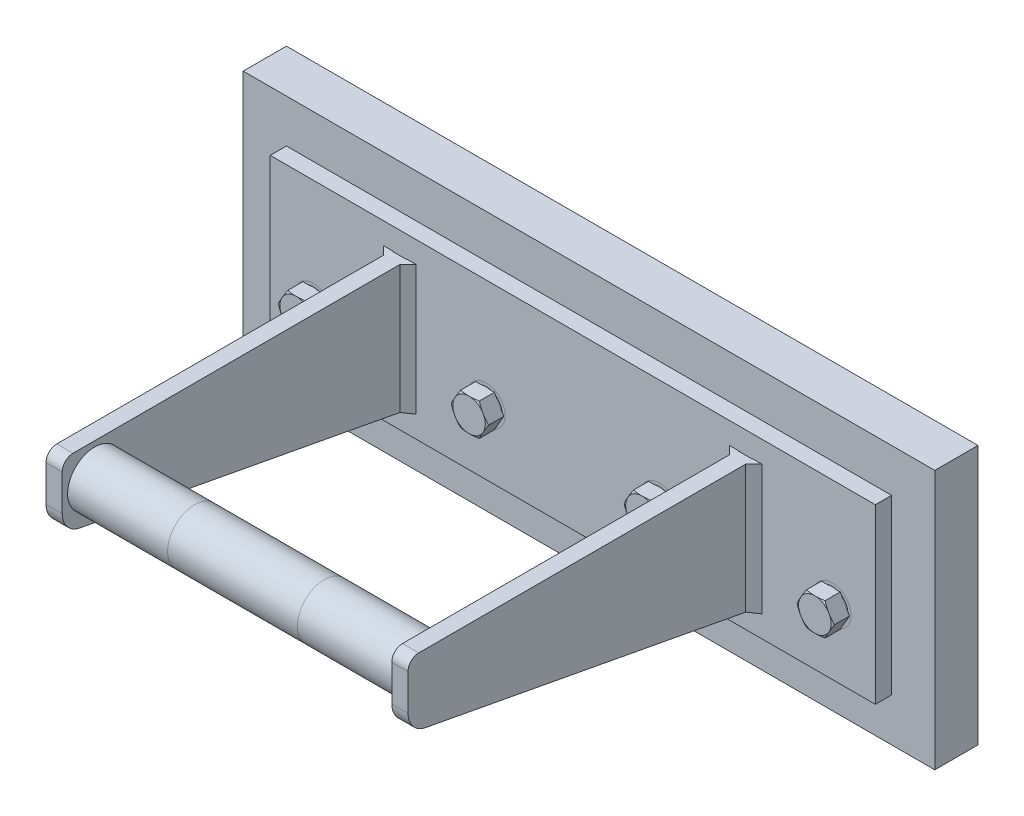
ISO-10303-21;
HEADER;
FILE_DESCRIPTION(('STEP AP214'),'2;1');
FILE_NAME('part.step','',(''),(''),'','','');
FILE_SCHEMA(('AUTOMOTIVE_DESIGN { 1 0 10303 214 1 1 1 1 }'));
ENDSEC;
DATA;
#1=APPLICATION_CONTEXT('core data for automotive mechanical design processes');
#2=APPLICATION_PROTOCOL_DEFINITION('international standard','automotive_design',2000,#1);
#3=PRODUCT_CONTEXT('',#1,'mechanical');
#4=PRODUCT('Part','Part','',(#3));
#5=PRODUCT_RELATED_PRODUCT_CATEGORY('part','',(#4));
#6=PRODUCT_DEFINITION_FORMATION('','',#4);
#7=PRODUCT_DEFINITION_CONTEXT('part definition',#1,'design');
#8=PRODUCT_DEFINITION('design','',#6,#7);
#9=PRODUCT_DEFINITION_SHAPE('','',#8);
#10=(LENGTH_UNIT() NAMED_UNIT(*) SI_UNIT(.MILLI.,.METRE.));
#11=(NAMED_UNIT(*) PLANE_ANGLE_UNIT() SI_UNIT($,.RADIAN.));
#12=(NAMED_UNIT(*) SI_UNIT($,.STERADIAN.) SOLID_ANGLE_UNIT());
#13=UNCERTAINTY_MEASURE_WITH_UNIT(LENGTH_MEASURE(1.E-05),#10,'distance_accuracy_value','');
#14=(GEOMETRIC_REPRESENTATION_CONTEXT(3) GLOBAL_UNCERTAINTY_ASSIGNED_CONTEXT((#13)) GLOBAL_UNIT_ASSIGNED_CONTEXT((#10,
#11,#12)) REPRESENTATION_CONTEXT('',''));
#15=CARTESIAN_POINT('',(0.,0.,0.));
#16=DIRECTION('',(0.,0.,1.));
#17=DIRECTION('',(1.,0.,0.));
#18=AXIS2_PLACEMENT_3D('',#15,#16,#17);
#19=CARTESIAN_POINT('',(-146.900738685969,-22.225,10.287));
#20=DIRECTION('',(0.866025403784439,-0.5,0.));
#21=DIRECTION('',(0.5,0.866025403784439,0.));
#22=AXIS2_PLACEMENT_3D('',#19,#20,#21);
#23=PLANE('',#22);
#24=CARTESIAN_POINT('',(-144.151108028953,-17.4625,-7.112));
#25=DIRECTION('',(0.866025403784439,-0.5,0.));
#26=DIRECTION('',(0.5,0.866025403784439,0.));
#27=AXIS2_PLACEMENT_3D('',#24,#25,#26);
#28=CIRCLE('',#27,26.8060269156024);
#29=CARTESIAN_POINT('',(-146.900738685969,-22.225,19.1238762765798));
#30=VERTEX_POINT('',#29);
#31=CARTESIAN_POINT('',(-144.498911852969,-18.0649138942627,19.685));
#32=VERTEX_POINT('',#31);
#33=EDGE_CURVE('E168',#30,#32,#28,.F.);
#34=ORIENTED_EDGE('',*,*,#33,.F.);
#35=DIRECTION('',(0.,0.,1.));
#36=VECTOR('',#35,1.);
#37=CARTESIAN_POINT('',(-146.900738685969,-22.225,10.287));
#38=LINE('',#37,#36);
#39=CARTESIAN_POINT('',(-146.900738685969,-22.225,10.287));
#40=VERTEX_POINT('',#39);
#41=EDGE_CURVE('E192',#40,#30,#38,.T.);
#42=ORIENTED_EDGE('',*,*,#41,.F.);
#43=DIRECTION('',(0.5,0.866025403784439,0.));
#44=VECTOR('',#43,1.);
#45=CARTESIAN_POINT('',(-146.900738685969,-22.225,10.287));
#46=LINE('',#45,#44);
#47=CARTESIAN_POINT('',(-141.401477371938,-12.7,10.287));
#48=VERTEX_POINT('',#47);
#49=EDGE_CURVE('E191',#40,#48,#46,.T.);
#50=ORIENTED_EDGE('',*,*,#49,.T.);
#51=DIRECTION('',(0.,0.,1.));
#52=VECTOR('',#51,1.);
#53=CARTESIAN_POINT('',(-141.401477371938,-12.7,10.287));
#54=LINE('',#53,#52);
#55=CARTESIAN_POINT('',(-141.401477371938,-12.7,19.1238762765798));
#56=VERTEX_POINT('',#55);
#57=EDGE_CURVE('E165',#48,#56,#54,.T.);
#58=ORIENTED_EDGE('',*,*,#57,.T.);
#59=CARTESIAN_POINT('',(-143.803304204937,-16.8600861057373,19.685));
#60=VERTEX_POINT('',#59);
#61=EDGE_CURVE('E148',#60,#56,#28,.F.);
#62=ORIENTED_EDGE('',*,*,#61,.F.);
#63=DIRECTION('',(0.5,0.866025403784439,0.));
#64=VECTOR('',#63,1.);
#65=CARTESIAN_POINT('',(-146.900738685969,-22.225,19.685));
#66=LINE('',#65,#64);
#67=EDGE_CURVE('E163',#32,#60,#66,.T.);
#68=ORIENTED_EDGE('',*,*,#67,.F.);
#69=EDGE_LOOP('',(#34,#42,#50,#58,#62,#68));
#70=FACE_BOUND('',#69,.T.);
#71=ADVANCED_FACE('F57',(#70),#23,.T.);
#72=CARTESIAN_POINT('',(-157.899261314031,-22.225,10.287));
#73=DIRECTION('',(0.,-1.,0.));
#74=DIRECTION('',(0.,0.,-1.));
#75=AXIS2_PLACEMENT_3D('',#72,#73,#74);
#76=PLANE('',#75);
#77=CARTESIAN_POINT('',(-152.4,-22.225,-7.112));
#78=DIRECTION('',(0.,-1.,0.));
#79=DIRECTION('',(0.,0.,-1.));
#80=AXIS2_PLACEMENT_3D('',#77,#78,#79);
#81=CIRCLE('',#80,26.8060269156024);
#82=CARTESIAN_POINT('',(-157.899261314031,-22.225,19.1238762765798));
#83=VERTEX_POINT('',#82);
#84=CARTESIAN_POINT('',(-153.095607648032,-22.225,19.685));
#85=VERTEX_POINT('',#84);
#86=EDGE_CURVE('E72',#83,#85,#81,.F.);
#87=ORIENTED_EDGE('',*,*,#86,.F.);
#88=DIRECTION('',(0.,0.,1.));
#89=VECTOR('',#88,1.);
#90=CARTESIAN_POINT('',(-157.899261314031,-22.225,10.287));
#91=LINE('',#90,#89);
#92=CARTESIAN_POINT('',(-157.899261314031,-22.225,10.287));
#93=VERTEX_POINT('',#92);
#94=EDGE_CURVE('E196',#93,#83,#91,.T.);
#95=ORIENTED_EDGE('',*,*,#94,.F.);
#96=DIRECTION('',(1.,0.,0.));
#97=VECTOR('',#96,1.);
#98=CARTESIAN_POINT('',(-157.899261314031,-22.225,10.287));
#99=LINE('',#98,#97);
#100=EDGE_CURVE('E178',#93,#40,#99,.T.);
#101=ORIENTED_EDGE('',*,*,#100,.T.);
#102=ORIENTED_EDGE('',*,*,#41,.T.);
#103=CARTESIAN_POINT('',(-151.704392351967,-22.225,19.685));
#104=VERTEX_POINT('',#103);
#105=EDGE_CURVE('E176',#104,#30,#81,.F.);
#106=ORIENTED_EDGE('',*,*,#105,.F.);
#107=DIRECTION('',(1.,0.,0.));
#108=VECTOR('',#107,1.);
#109=CARTESIAN_POINT('',(-157.899261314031,-22.225,19.685));
#110=LINE('',#109,#108);
#111=EDGE_CURVE('E189',#85,#104,#110,.T.);
#112=ORIENTED_EDGE('',*,*,#111,.F.);
#113=EDGE_LOOP('',(#87,#95,#101,#102,#106,#112));
#114=FACE_BOUND('',#113,.T.);
#115=ADVANCED_FACE('F234',(#114),#76,.T.);
#116=CARTESIAN_POINT('',(-163.398522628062,-12.7,10.287));
#117=DIRECTION('',(-0.866025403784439,-0.499999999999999,0.));
#118=DIRECTION('',(0.499999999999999,-0.866025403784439,0.));
#119=AXIS2_PLACEMENT_3D('',#116,#117,#118);
#120=PLANE('',#119);
#121=CARTESIAN_POINT('',(-160.648891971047,-17.4625,-7.112));
#122=DIRECTION('',(-0.866025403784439,-0.499999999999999,0.));
#123=DIRECTION('',(0.499999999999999,-0.866025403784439,0.));
#124=AXIS2_PLACEMENT_3D('',#121,#122,#123);
#125=CIRCLE('',#124,26.8060269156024);
#126=CARTESIAN_POINT('',(-163.398522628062,-12.7,19.1238762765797));
#127=VERTEX_POINT('',#126);
#128=CARTESIAN_POINT('',(-160.996695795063,-16.8600861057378,19.685));
#129=VERTEX_POINT('',#128);
#130=EDGE_CURVE('E80',#127,#129,#125,.F.);
#131=ORIENTED_EDGE('',*,*,#130,.F.);
#132=DIRECTION('',(0.,0.,1.));
#133=VECTOR('',#132,1.);
#134=CARTESIAN_POINT('',(-163.398522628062,-12.7,10.287));
#135=LINE('',#134,#133);
#136=CARTESIAN_POINT('',(-163.398522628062,-12.7,10.287));
#137=VERTEX_POINT('',#136);
#138=EDGE_CURVE('E199',#137,#127,#135,.T.);
#139=ORIENTED_EDGE('',*,*,#138,.F.);
#140=DIRECTION('',(0.499999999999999,-0.866025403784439,0.));
#141=VECTOR('',#140,1.);
#142=CARTESIAN_POINT('',(-163.398522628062,-12.7,10.287));
#143=LINE('',#142,#141);
#144=EDGE_CURVE('E279',#137,#93,#143,.T.);
#145=ORIENTED_EDGE('',*,*,#144,.T.);
#146=ORIENTED_EDGE('',*,*,#94,.T.);
#147=CARTESIAN_POINT('',(-160.301088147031,-18.0649138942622,19.685));
#148=VERTEX_POINT('',#147);
#149=EDGE_CURVE('E290',#148,#83,#125,.F.);
#150=ORIENTED_EDGE('',*,*,#149,.F.);
#151=DIRECTION('',(0.499999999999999,-0.866025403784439,0.));
#152=VECTOR('',#151,1.);
#153=CARTESIAN_POINT('',(-163.398522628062,-12.7,19.685));
#154=LINE('',#153,#152);
#155=EDGE_CURVE('E186',#129,#148,#154,.T.);
#156=ORIENTED_EDGE('',*,*,#155,.F.);
#157=EDGE_LOOP('',(#131,#139,#145,#146,#150,#156));
#158=FACE_BOUND('',#157,.T.);
#159=ADVANCED_FACE('F239',(#158),#120,.T.);
#160=CARTESIAN_POINT('',(-157.899261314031,-3.175,10.287));
#161=DIRECTION('',(-0.866025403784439,0.5,0.));
#162=DIRECTION('',(-0.5,-0.866025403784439,0.));
#163=AXIS2_PLACEMENT_3D('',#160,#161,#162);
#164=PLANE('',#163);
#165=CARTESIAN_POINT('',(-160.648891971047,-7.93750000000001,-7.112));
#166=DIRECTION('',(-0.866025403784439,0.5,0.));
#167=DIRECTION('',(-0.5,-0.866025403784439,0.));
#168=AXIS2_PLACEMENT_3D('',#165,#166,#167);
#169=CIRCLE('',#168,26.8060269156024);
#170=CARTESIAN_POINT('',(-157.899261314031,-3.175,19.1238762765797));
#171=VERTEX_POINT('',#170);
#172=CARTESIAN_POINT('',(-160.301088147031,-7.3350861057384,19.685));
#173=VERTEX_POINT('',#172);
#174=EDGE_CURVE('E293',#171,#173,#169,.F.);
#175=ORIENTED_EDGE('',*,*,#174,.F.);
#176=DIRECTION('',(0.,0.,1.));
#177=VECTOR('',#176,1.);
#178=CARTESIAN_POINT('',(-157.899261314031,-3.175,10.287));
#179=LINE('',#178,#177);
#180=CARTESIAN_POINT('',(-157.899261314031,-3.175,10.287));
#181=VERTEX_POINT('',#180);
#182=EDGE_CURVE('E202',#181,#171,#179,.T.);
#183=ORIENTED_EDGE('',*,*,#182,.F.);
#184=DIRECTION('',(-0.5,-0.866025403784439,0.));
#185=VECTOR('',#184,1.);
#186=CARTESIAN_POINT('',(-157.899261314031,-3.175,10.287));
#187=LINE('',#186,#185);
#188=EDGE_CURVE('E280',#181,#137,#187,.T.);
#189=ORIENTED_EDGE('',*,*,#188,.T.);
#190=ORIENTED_EDGE('',*,*,#138,.T.);
#191=CARTESIAN_POINT('',(-160.996695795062,-8.53991389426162,19.685));
#192=VERTEX_POINT('',#191);
#193=EDGE_CURVE('E292',#192,#127,#169,.F.);
#194=ORIENTED_EDGE('',*,*,#193,.F.);
#195=DIRECTION('',(-0.5,-0.866025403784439,0.));
#196=VECTOR('',#195,1.);
#197=CARTESIAN_POINT('',(-157.899261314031,-3.175,19.685));
#198=LINE('',#197,#196);
#199=EDGE_CURVE('E183',#173,#192,#198,.T.);
#200=ORIENTED_EDGE('',*,*,#199,.F.);
#201=EDGE_LOOP('',(#175,#183,#189,#190,#194,#200));
#202=FACE_BOUND('',#201,.T.);
#203=ADVANCED_FACE('F337',(#202),#164,.T.);
#204=CARTESIAN_POINT('',(-146.900738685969,-3.175,10.287));
#205=DIRECTION('',(0.,1.,0.));
#206=DIRECTION('',(-1.,0.,0.));
#207=AXIS2_PLACEMENT_3D('',#204,#205,#206);
#208=PLANE('',#207);
#209=CARTESIAN_POINT('',(-152.4,-3.175,-7.112));
#210=DIRECTION('',(0.,1.,0.));
#211=DIRECTION('',(-1.,0.,0.));
#212=AXIS2_PLACEMENT_3D('',#209,#210,#211);
#213=CIRCLE('',#212,26.8060269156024);
#214=CARTESIAN_POINT('',(-146.900738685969,-3.175,19.1238762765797));
#215=VERTEX_POINT('',#214);
#216=CARTESIAN_POINT('',(-151.704392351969,-3.175,19.685));
#217=VERTEX_POINT('',#216);
#218=EDGE_CURVE('E296',#215,#217,#213,.F.);
#219=ORIENTED_EDGE('',*,*,#218,.F.);
#220=DIRECTION('',(0.,0.,1.));
#221=VECTOR('',#220,1.);
#222=CARTESIAN_POINT('',(-146.900738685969,-3.175,10.287));
#223=LINE('',#222,#221);
#224=CARTESIAN_POINT('',(-146.900738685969,-3.175,10.287));
#225=VERTEX_POINT('',#224);
#226=EDGE_CURVE('E205',#225,#215,#223,.T.);
#227=ORIENTED_EDGE('',*,*,#226,.F.);
#228=DIRECTION('',(-1.,0.,0.));
#229=VECTOR('',#228,1.);
#230=CARTESIAN_POINT('',(-146.900738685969,-3.175,10.287));
#231=LINE('',#230,#229);
#232=EDGE_CURVE('E283',#225,#181,#231,.T.);
#233=ORIENTED_EDGE('',*,*,#232,.T.);
#234=ORIENTED_EDGE('',*,*,#182,.T.);
#235=CARTESIAN_POINT('',(-153.095607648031,-3.175,19.685));
#236=VERTEX_POINT('',#235);
#237=EDGE_CURVE('E295',#236,#171,#213,.F.);
#238=ORIENTED_EDGE('',*,*,#237,.F.);
#239=DIRECTION('',(-1.,0.,0.));
#240=VECTOR('',#239,1.);
#241=CARTESIAN_POINT('',(-146.900738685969,-3.175,19.685));
#242=LINE('',#241,#240);
#243=EDGE_CURVE('E174',#217,#236,#242,.T.);
#244=ORIENTED_EDGE('',*,*,#243,.F.);
#245=EDGE_LOOP('',(#219,#227,#233,#234,#238,#244));
#246=FACE_BOUND('',#245,.T.);
#247=ADVANCED_FACE('F306',(#246),#208,.T.);
#248=CARTESIAN_POINT('',(-141.401477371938,-12.7,10.287));
#249=DIRECTION('',(0.866025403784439,0.499999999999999,0.));
#250=DIRECTION('',(-0.499999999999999,0.866025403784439,0.));
#251=AXIS2_PLACEMENT_3D('',#248,#249,#250);
#252=PLANE('',#251);
#253=CARTESIAN_POINT('',(-144.151108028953,-7.93750000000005,-7.112));
#254=DIRECTION('',(0.866025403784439,0.499999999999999,0.));
#255=DIRECTION('',(-0.499999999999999,0.866025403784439,0.));
#256=AXIS2_PLACEMENT_3D('',#253,#254,#255);
#257=CIRCLE('',#256,26.8060269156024);
#258=CARTESIAN_POINT('',(-143.803304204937,-8.53991389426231,19.685));
#259=VERTEX_POINT('',#258);
#260=EDGE_CURVE('E150',#56,#259,#257,.F.);
#261=ORIENTED_EDGE('',*,*,#260,.F.);
#262=ORIENTED_EDGE('',*,*,#57,.F.);
#263=DIRECTION('',(-0.499999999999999,0.866025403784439,0.));
#264=VECTOR('',#263,1.);
#265=CARTESIAN_POINT('',(-141.401477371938,-12.7,10.287));
#266=LINE('',#265,#264);
#267=EDGE_CURVE('E275',#48,#225,#266,.T.);
#268=ORIENTED_EDGE('',*,*,#267,.T.);
#269=ORIENTED_EDGE('',*,*,#226,.T.);
#270=CARTESIAN_POINT('',(-144.498911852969,-7.33508610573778,19.685));
#271=VERTEX_POINT('',#270);
#272=EDGE_CURVE('E166',#271,#215,#257,.F.);
#273=ORIENTED_EDGE('',*,*,#272,.F.);
#274=DIRECTION('',(-0.499999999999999,0.866025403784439,0.));
#275=VECTOR('',#274,1.);
#276=CARTESIAN_POINT('',(-141.401477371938,-12.7,19.685));
#277=LINE('',#276,#275);
#278=EDGE_CURVE('E172',#259,#271,#277,.T.);
#279=ORIENTED_EDGE('',*,*,#278,.F.);
#280=EDGE_LOOP('',(#261,#262,#268,#269,#273,#279));
#281=FACE_BOUND('',#280,.T.);
#282=ADVANCED_FACE('F244',(#281),#252,.T.);
#283=CARTESIAN_POINT('',(-152.4,-12.7,19.685));
#284=DIRECTION('',(0.,0.,1.));
#285=DIRECTION('',(1.,0.,0.));
#286=AXIS2_PLACEMENT_3D('',#283,#284,#285);
#287=PLANE('',#286);
#288=CARTESIAN_POINT('',(-152.4,-12.7,19.685));
#289=DIRECTION('',(0.,0.,1.));
#290=DIRECTION('',(1.,0.,0.));
#291=AXIS2_PLACEMENT_3D('',#288,#289,#290);
#292=CIRCLE('',#291,9.55036622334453);
#293=EDGE_CURVE('E158',#32,#104,#292,.F.);
#294=ORIENTED_EDGE('',*,*,#293,.F.);
#295=ORIENTED_EDGE('',*,*,#67,.T.);
#296=EDGE_CURVE('E145',#259,#60,#292,.F.);
#297=ORIENTED_EDGE('',*,*,#296,.F.);
#298=ORIENTED_EDGE('',*,*,#278,.T.);
#299=EDGE_CURVE('E155',#217,#271,#292,.F.);
#300=ORIENTED_EDGE('',*,*,#299,.F.);
#301=ORIENTED_EDGE('',*,*,#243,.T.);
#302=EDGE_CURVE('E309',#173,#236,#292,.F.);
#303=ORIENTED_EDGE('',*,*,#302,.F.);
#304=ORIENTED_EDGE('',*,*,#199,.T.);
#305=EDGE_CURVE('E310',#129,#192,#292,.F.);
#306=ORIENTED_EDGE('',*,*,#305,.F.);
#307=ORIENTED_EDGE('',*,*,#155,.T.);
#308=EDGE_CURVE('E312',#85,#148,#292,.F.);
#309=ORIENTED_EDGE('',*,*,#308,.F.);
#310=ORIENTED_EDGE('',*,*,#111,.T.);
#311=EDGE_LOOP('',(#294,#295,#297,#298,#300,#301,#303,#304,#306,#307,#309,#310));
#312=FACE_BOUND('',#311,.T.);
#313=ADVANCED_FACE('F170',(#312),#287,.T.);
#314=CARTESIAN_POINT('',(-152.4,-12.7,19.685));
#315=DIRECTION('',(0.,0.,-1.));
#316=DIRECTION('',(-1.,0.,0.));
#317=AXIS2_PLACEMENT_3D('',#314,#315,#316);
#318=CYLINDRICAL_SURFACE('',#317,9.27099999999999);
#319=CARTESIAN_POINT('',(-152.4,-12.7,9.525));
#320=DIRECTION('',(0.,0.,1.));
#321=DIRECTION('',(1.,0.,0.));
#322=AXIS2_PLACEMENT_3D('',#319,#320,#321);
#323=CIRCLE('',#322,9.27099999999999);
#324=CARTESIAN_POINT('',(-143.129,-12.7,9.525));
#325=VERTEX_POINT('',#324);
#326=EDGE_CURVE('E195',#325,#325,#323,.T.);
#327=ORIENTED_EDGE('',*,*,#326,.T.);
#328=EDGE_LOOP('',(#327));
#329=FACE_BOUND('',#328,.T.);
#330=CARTESIAN_POINT('',(-152.4,-12.7,10.287));
#331=DIRECTION('',(0.,0.,1.));
#332=DIRECTION('',(1.,0.,0.));
#333=AXIS2_PLACEMENT_3D('',#330,#331,#332);
#334=CIRCLE('',#333,9.27099999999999);
#335=CARTESIAN_POINT('',(-143.129,-12.7,10.287));
#336=VERTEX_POINT('',#335);
#337=EDGE_CURVE('E156',#336,#336,#334,.T.);
#338=ORIENTED_EDGE('',*,*,#337,.F.);
#339=EDGE_LOOP('',(#338));
#340=FACE_BOUND('',#339,.T.);
#341=ADVANCED_FACE('F248',(#329,#340),#318,.T.);
#342=CARTESIAN_POINT('',(-152.4,-12.7,9.525));
#343=DIRECTION('',(0.,0.,1.));
#344=DIRECTION('',(1.,0.,0.));
#345=AXIS2_PLACEMENT_3D('',#342,#343,#344);
#346=PLANE('',#345);
#347=CARTESIAN_POINT('',(-152.4,-12.7,9.525));
#348=DIRECTION('',(0.,0.,1.));
#349=DIRECTION('',(1.,0.,0.));
#350=AXIS2_PLACEMENT_3D('',#347,#348,#349);
#351=CIRCLE('',#350,6.70560000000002);
#352=CARTESIAN_POINT('',(-145.6944,-12.7,9.525));
#353=VERTEX_POINT('',#352);
#354=EDGE_CURVE('E12',#353,#353,#351,.T.);
#355=ORIENTED_EDGE('',*,*,#354,.T.);
#356=EDGE_LOOP('',(#355));
#357=FACE_BOUND('',#356,.T.);
#358=ORIENTED_EDGE('',*,*,#326,.F.);
#359=EDGE_LOOP('',(#358));
#360=FACE_BOUND('',#359,.T.);
#361=ADVANCED_FACE('F249',(#357,#360),#346,.F.);
#362=CARTESIAN_POINT('',(-304.8,0.,10.287));
#363=DIRECTION('',(0.,0.,1.));
#364=DIRECTION('',(1.,0.,0.));
#365=AXIS2_PLACEMENT_3D('',#362,#363,#364);
#366=PLANE('',#365);
#367=ORIENTED_EDGE('',*,*,#337,.T.);
#368=EDGE_LOOP('',(#367));
#369=FACE_BOUND('',#368,.T.);
#370=ORIENTED_EDGE('',*,*,#49,.F.);
#371=ORIENTED_EDGE('',*,*,#100,.F.);
#372=ORIENTED_EDGE('',*,*,#144,.F.);
#373=ORIENTED_EDGE('',*,*,#188,.F.);
#374=ORIENTED_EDGE('',*,*,#232,.F.);
#375=ORIENTED_EDGE('',*,*,#267,.F.);
#376=EDGE_LOOP('',(#370,#371,#372,#373,#374,#375));
#377=FACE_BOUND('',#376,.T.);
#378=ADVANCED_FACE('F252',(#369,#377),#366,.F.);
#379=CARTESIAN_POINT('',(-152.4,-12.7,-41.275));
#380=DIRECTION('',(0.,0.,1.));
#381=DIRECTION('',(1.,0.,0.));
#382=AXIS2_PLACEMENT_3D('',#379,#380,#381);
#383=CYLINDRICAL_SURFACE('',#382,6.32460000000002);
#384=CARTESIAN_POINT('',(-152.4,-12.7,9.144));
#385=DIRECTION('',(0.,0.,1.));
#386=DIRECTION('',(1.,0.,0.));
#387=AXIS2_PLACEMENT_3D('',#384,#385,#386);
#388=CIRCLE('',#387,6.32460000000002);
#389=CARTESIAN_POINT('',(-146.0754,-12.7,9.144));
#390=VERTEX_POINT('',#389);
#391=EDGE_CURVE('E65',#390,#390,#388,.F.);
#392=ORIENTED_EDGE('',*,*,#391,.T.);
#393=EDGE_LOOP('',(#392));
#394=FACE_BOUND('',#393,.T.);
#395=CARTESIAN_POINT('',(-152.4,-12.7,-40.259));
#396=DIRECTION('',(0.,0.,-1.));
#397=DIRECTION('',(-1.,0.,0.));
#398=AXIS2_PLACEMENT_3D('',#395,#396,#397);
#399=CIRCLE('',#398,6.32460000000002);
#400=CARTESIAN_POINT('',(-158.7246,-12.7,-40.259));
#401=VERTEX_POINT('',#400);
#402=EDGE_CURVE('E216',#401,#401,#399,.F.);
#403=ORIENTED_EDGE('',*,*,#402,.T.);
#404=EDGE_LOOP('',(#403));
#405=FACE_BOUND('',#404,.T.);
#406=ADVANCED_FACE('F221',(#394,#405),#383,.T.);
#407=CARTESIAN_POINT('',(-152.4,-12.7,-41.275));
#408=DIRECTION('',(0.,0.,-1.));
#409=DIRECTION('',(-1.,0.,0.));
#410=AXIS2_PLACEMENT_3D('',#407,#408,#409);
#411=PLANE('',#410);
#412=CARTESIAN_POINT('',(-152.4,-12.7,-41.275));
#413=DIRECTION('',(0.,0.,-1.));
#414=DIRECTION('',(-1.,0.,0.));
#415=AXIS2_PLACEMENT_3D('',#412,#413,#414);
#416=CIRCLE('',#415,5.30860000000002);
#417=CARTESIAN_POINT('',(-157.7086,-12.7,-41.275));
#418=VERTEX_POINT('',#417);
#419=EDGE_CURVE('E213',#418,#418,#416,.T.);
#420=ORIENTED_EDGE('',*,*,#419,.T.);
#421=EDGE_LOOP('',(#420));
#422=FACE_BOUND('',#421,.T.);
#423=ADVANCED_FACE('F329',(#422),#411,.T.);
#424=CARTESIAN_POINT('',(-152.4,-12.7,-7.112));
#425=DIRECTION('',(0.,0.,-1.));
#426=DIRECTION('',(0.5,0.866025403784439,0.));
#427=AXIS2_PLACEMENT_3D('',#424,#425,#426);
#428=SPHERICAL_SURFACE('',#427,28.448);
#429=ORIENTED_EDGE('',*,*,#61,.T.);
#430=ORIENTED_EDGE('',*,*,#260,.T.);
#431=ORIENTED_EDGE('',*,*,#296,.T.);
#432=EDGE_LOOP('',(#429,#430,#431));
#433=FACE_BOUND('',#432,.T.);
#434=ADVANCED_FACE('F147',(#433),#428,.T.);
#435=ORIENTED_EDGE('',*,*,#218,.T.);
#436=ORIENTED_EDGE('',*,*,#299,.T.);
#437=ORIENTED_EDGE('',*,*,#272,.T.);
#438=EDGE_LOOP('',(#435,#436,#437));
#439=FACE_BOUND('',#438,.T.);
#440=ADVANCED_FACE('F301',(#439),#428,.T.);
#441=ORIENTED_EDGE('',*,*,#174,.T.);
#442=ORIENTED_EDGE('',*,*,#302,.T.);
#443=ORIENTED_EDGE('',*,*,#237,.T.);
#444=EDGE_LOOP('',(#441,#442,#443));
#445=FACE_BOUND('',#444,.T.);
#446=ADVANCED_FACE('F326',(#445),#428,.T.);
#447=ORIENTED_EDGE('',*,*,#130,.T.);
#448=ORIENTED_EDGE('',*,*,#305,.T.);
#449=ORIENTED_EDGE('',*,*,#193,.T.);
#450=EDGE_LOOP('',(#447,#448,#449));
#451=FACE_BOUND('',#450,.T.);
#452=ADVANCED_FACE('F320',(#451),#428,.T.);
#453=ORIENTED_EDGE('',*,*,#86,.T.);
#454=ORIENTED_EDGE('',*,*,#308,.T.);
#455=ORIENTED_EDGE('',*,*,#149,.T.);
#456=EDGE_LOOP('',(#453,#454,#455));
#457=FACE_BOUND('',#456,.T.);
#458=ADVANCED_FACE('F318',(#457),#428,.T.);
#459=ORIENTED_EDGE('',*,*,#33,.T.);
#460=ORIENTED_EDGE('',*,*,#293,.T.);
#461=ORIENTED_EDGE('',*,*,#105,.T.);
#462=EDGE_LOOP('',(#459,#460,#461));
#463=FACE_BOUND('',#462,.T.);
#464=ADVANCED_FACE('F230',(#463),#428,.T.);
#465=CARTESIAN_POINT('',(-152.4,-12.7,-41.275));
#466=DIRECTION('',(0.,0.,1.));
#467=DIRECTION('',(1.,0.,0.));
#468=AXIS2_PLACEMENT_3D('',#465,#466,#467);
#469=CONICAL_SURFACE('',#468,5.30860000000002,0.785398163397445);
#470=ORIENTED_EDGE('',*,*,#402,.F.);
#471=EDGE_LOOP('',(#470));
#472=FACE_BOUND('',#471,.T.);
#473=ORIENTED_EDGE('',*,*,#419,.F.);
#474=EDGE_LOOP('',(#473));
#475=FACE_BOUND('',#474,.T.);
#476=ADVANCED_FACE('F225',(#472,#475),#469,.T.);
#477=CARTESIAN_POINT('',(-152.4,-12.7,9.144));
#478=DIRECTION('',(0.,0.,1.));
#479=DIRECTION('',(1.,0.,0.));
#480=AXIS2_PLACEMENT_3D('',#477,#478,#479);
#481=TOROIDAL_SURFACE('',#480,6.70560000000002,0.381);
#482=ORIENTED_EDGE('',*,*,#354,.F.);
#483=EDGE_LOOP('',(#482));
#484=FACE_BOUND('',#483,.T.);
#485=ORIENTED_EDGE('',*,*,#391,.F.);
#486=EDGE_LOOP('',(#485));
#487=FACE_BOUND('',#486,.T.);
#488=ADVANCED_FACE('F59',(#484,#487),#481,.F.);
#489=CLOSED_SHELL('',(#71,#115,#159,#203,#247,#282,#313,#341,#361,#378,#406,#423,#434,#440,#446,
#452,#458,#464,#476,#488));
#490=MANIFOLD_SOLID_BREP('B2',#489);
#491=CARTESIAN_POINT('',(-45.3007386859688,-22.225,10.287));
#492=DIRECTION('',(0.866025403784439,-0.5,0.));
#493=DIRECTION('',(0.5,0.866025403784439,0.));
#494=AXIS2_PLACEMENT_3D('',#491,#492,#493);
#495=PLANE('',#494);
#496=CARTESIAN_POINT('',(-42.5511080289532,-17.4625,-7.112));
#497=DIRECTION('',(0.866025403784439,-0.5,0.));
#498=DIRECTION('',(0.5,0.866025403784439,0.));
#499=AXIS2_PLACEMENT_3D('',#496,#497,#498);
#500=CIRCLE('',#499,26.8060269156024);
#501=CARTESIAN_POINT('',(-45.3007386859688,-22.225,19.1238762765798));
#502=VERTEX_POINT('',#501);
#503=CARTESIAN_POINT('',(-42.8989118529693,-18.0649138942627,19.685));
#504=VERTEX_POINT('',#503);
#505=EDGE_CURVE('E644',#502,#504,#500,.F.);
#506=ORIENTED_EDGE('',*,*,#505,.F.);
#507=DIRECTION('',(0.,0.,1.));
#508=VECTOR('',#507,1.);
#509=CARTESIAN_POINT('',(-45.3007386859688,-22.225,10.287));
#510=LINE('',#509,#508);
#511=CARTESIAN_POINT('',(-45.3007386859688,-22.225,10.287));
#512=VERTEX_POINT('',#511);
#513=EDGE_CURVE('E668',#512,#502,#510,.T.);
#514=ORIENTED_EDGE('',*,*,#513,.F.);
#515=DIRECTION('',(0.5,0.866025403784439,0.));
#516=VECTOR('',#515,1.);
#517=CARTESIAN_POINT('',(-45.3007386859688,-22.225,10.287));
#518=LINE('',#517,#516);
#519=CARTESIAN_POINT('',(-39.8014773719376,-12.7,10.287));
#520=VERTEX_POINT('',#519);
#521=EDGE_CURVE('E667',#512,#520,#518,.T.);
#522=ORIENTED_EDGE('',*,*,#521,.T.);
#523=DIRECTION('',(0.,0.,1.));
#524=VECTOR('',#523,1.);
#525=CARTESIAN_POINT('',(-39.8014773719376,-12.7,10.287));
#526=LINE('',#525,#524);
#527=CARTESIAN_POINT('',(-39.8014773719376,-12.7,19.1238762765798));
#528=VERTEX_POINT('',#527);
#529=EDGE_CURVE('E641',#520,#528,#526,.T.);
#530=ORIENTED_EDGE('',*,*,#529,.T.);
#531=CARTESIAN_POINT('',(-42.2033042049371,-16.8600861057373,19.685));
#532=VERTEX_POINT('',#531);
#533=EDGE_CURVE('E624',#532,#528,#500,.F.);
#534=ORIENTED_EDGE('',*,*,#533,.F.);
#535=DIRECTION('',(0.5,0.866025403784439,0.));
#536=VECTOR('',#535,1.);
#537=CARTESIAN_POINT('',(-45.3007386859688,-22.225,19.685));
#538=LINE('',#537,#536);
#539=EDGE_CURVE('E639',#504,#532,#538,.T.);
#540=ORIENTED_EDGE('',*,*,#539,.F.);
#541=EDGE_LOOP('',(#506,#514,#522,#530,#534,#540));
#542=FACE_BOUND('',#541,.T.);
#543=ADVANCED_FACE('F533',(#542),#495,.T.);
#544=CARTESIAN_POINT('',(-56.2992613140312,-22.225,10.287));
#545=DIRECTION('',(0.,-1.,0.));
#546=DIRECTION('',(0.,0.,-1.));
#547=AXIS2_PLACEMENT_3D('',#544,#545,#546);
#548=PLANE('',#547);
#549=CARTESIAN_POINT('',(-50.8,-22.225,-7.112));
#550=DIRECTION('',(0.,-1.,0.));
#551=DIRECTION('',(0.,0.,-1.));
#552=AXIS2_PLACEMENT_3D('',#549,#550,#551);
#553=CIRCLE('',#552,26.8060269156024);
#554=CARTESIAN_POINT('',(-56.2992613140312,-22.225,19.1238762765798));
#555=VERTEX_POINT('',#554);
#556=CARTESIAN_POINT('',(-51.4956076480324,-22.225,19.685));
#557=VERTEX_POINT('',#556);
#558=EDGE_CURVE('E548',#555,#557,#553,.F.);
#559=ORIENTED_EDGE('',*,*,#558,.F.);
#560=DIRECTION('',(0.,0.,1.));
#561=VECTOR('',#560,1.);
#562=CARTESIAN_POINT('',(-56.2992613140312,-22.225,10.287));
#563=LINE('',#562,#561);
#564=CARTESIAN_POINT('',(-56.2992613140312,-22.225,10.287));
#565=VERTEX_POINT('',#564);
#566=EDGE_CURVE('E672',#565,#555,#563,.T.);
#567=ORIENTED_EDGE('',*,*,#566,.F.);
#568=DIRECTION('',(1.,0.,0.));
#569=VECTOR('',#568,1.);
#570=CARTESIAN_POINT('',(-56.2992613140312,-22.225,10.287));
#571=LINE('',#570,#569);
#572=EDGE_CURVE('E654',#565,#512,#571,.T.);
#573=ORIENTED_EDGE('',*,*,#572,.T.);
#574=ORIENTED_EDGE('',*,*,#513,.T.);
#575=CARTESIAN_POINT('',(-50.1043923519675,-22.225,19.685));
#576=VERTEX_POINT('',#575);
#577=EDGE_CURVE('E652',#576,#502,#553,.F.);
#578=ORIENTED_EDGE('',*,*,#577,.F.);
#579=DIRECTION('',(1.,0.,0.));
#580=VECTOR('',#579,1.);
#581=CARTESIAN_POINT('',(-56.2992613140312,-22.225,19.685));
#582=LINE('',#581,#580);
#583=EDGE_CURVE('E665',#557,#576,#582,.T.);
#584=ORIENTED_EDGE('',*,*,#583,.F.);
#585=EDGE_LOOP('',(#559,#567,#573,#574,#578,#584));
#586=FACE_BOUND('',#585,.T.);
#587=ADVANCED_FACE('F711',(#586),#548,.T.);
#588=CARTESIAN_POINT('',(-61.7985226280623,-12.7,10.287));
#589=DIRECTION('',(-0.866025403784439,-0.499999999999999,0.));
#590=DIRECTION('',(0.499999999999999,-0.866025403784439,0.));
#591=AXIS2_PLACEMENT_3D('',#588,#589,#590);
#592=PLANE('',#591);
#593=CARTESIAN_POINT('',(-59.0488919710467,-17.4625,-7.112));
#594=DIRECTION('',(-0.866025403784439,-0.499999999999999,0.));
#595=DIRECTION('',(0.499999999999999,-0.866025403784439,0.));
#596=AXIS2_PLACEMENT_3D('',#593,#594,#595);
#597=CIRCLE('',#596,26.8060269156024);
#598=CARTESIAN_POINT('',(-61.7985226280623,-12.7,19.1238762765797));
#599=VERTEX_POINT('',#598);
#600=CARTESIAN_POINT('',(-59.3966957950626,-16.8600861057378,19.685));
#601=VERTEX_POINT('',#600);
#602=EDGE_CURVE('E556',#599,#601,#597,.F.);
#603=ORIENTED_EDGE('',*,*,#602,.F.);
#604=DIRECTION('',(0.,0.,1.));
#605=VECTOR('',#604,1.);
#606=CARTESIAN_POINT('',(-61.7985226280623,-12.7,10.287));
#607=LINE('',#606,#605);
#608=CARTESIAN_POINT('',(-61.7985226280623,-12.7,10.287));
#609=VERTEX_POINT('',#608);
#610=EDGE_CURVE('E675',#609,#599,#607,.T.);
#611=ORIENTED_EDGE('',*,*,#610,.F.);
#612=DIRECTION('',(0.499999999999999,-0.866025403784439,0.));
#613=VECTOR('',#612,1.);
#614=CARTESIAN_POINT('',(-61.7985226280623,-12.7,10.287));
#615=LINE('',#614,#613);
#616=EDGE_CURVE('E756',#609,#565,#615,.T.);
#617=ORIENTED_EDGE('',*,*,#616,.T.);
#618=ORIENTED_EDGE('',*,*,#566,.T.);
#619=CARTESIAN_POINT('',(-58.7010881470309,-18.0649138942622,19.685));
#620=VERTEX_POINT('',#619);
#621=EDGE_CURVE('E767',#620,#555,#597,.F.);
#622=ORIENTED_EDGE('',*,*,#621,.F.);
#623=DIRECTION('',(0.499999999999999,-0.866025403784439,0.));
#624=VECTOR('',#623,1.);
#625=CARTESIAN_POINT('',(-61.7985226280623,-12.7,19.685));
#626=LINE('',#625,#624);
#627=EDGE_CURVE('E662',#601,#620,#626,.T.);
#628=ORIENTED_EDGE('',*,*,#627,.F.);
#629=EDGE_LOOP('',(#603,#611,#617,#618,#622,#628));
#630=FACE_BOUND('',#629,.T.);
#631=ADVANCED_FACE('F716',(#630),#592,.T.);
#632=CARTESIAN_POINT('',(-56.2992613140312,-3.175,10.287));
#633=DIRECTION('',(-0.866025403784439,0.5,0.));
#634=DIRECTION('',(-0.5,-0.866025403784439,0.));
#635=AXIS2_PLACEMENT_3D('',#632,#633,#634);
#636=PLANE('',#635);
#637=CARTESIAN_POINT('',(-59.0488919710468,-7.93750000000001,-7.112));
#638=DIRECTION('',(-0.866025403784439,0.5,0.));
#639=DIRECTION('',(-0.5,-0.866025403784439,0.));
#640=AXIS2_PLACEMENT_3D('',#637,#638,#639);
#641=CIRCLE('',#640,26.8060269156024);
#642=CARTESIAN_POINT('',(-56.2992613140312,-3.175,19.1238762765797));
#643=VERTEX_POINT('',#642);
#644=CARTESIAN_POINT('',(-58.7010881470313,-7.3350861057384,19.685));
#645=VERTEX_POINT('',#644);
#646=EDGE_CURVE('E770',#643,#645,#641,.F.);
#647=ORIENTED_EDGE('',*,*,#646,.F.);
#648=DIRECTION('',(0.,0.,1.));
#649=VECTOR('',#648,1.);
#650=CARTESIAN_POINT('',(-56.2992613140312,-3.175,10.287));
#651=LINE('',#650,#649);
#652=CARTESIAN_POINT('',(-56.2992613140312,-3.175,10.287));
#653=VERTEX_POINT('',#652);
#654=EDGE_CURVE('E678',#653,#643,#651,.T.);
#655=ORIENTED_EDGE('',*,*,#654,.F.);
#656=DIRECTION('',(-0.5,-0.866025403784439,0.));
#657=VECTOR('',#656,1.);
#658=CARTESIAN_POINT('',(-56.2992613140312,-3.175,10.287));
#659=LINE('',#658,#657);
#660=EDGE_CURVE('E757',#653,#609,#659,.T.);
#661=ORIENTED_EDGE('',*,*,#660,.T.);
#662=ORIENTED_EDGE('',*,*,#610,.T.);
#663=CARTESIAN_POINT('',(-59.3966957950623,-8.53991389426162,19.685));
#664=VERTEX_POINT('',#663);
#665=EDGE_CURVE('E769',#664,#599,#641,.F.);
#666=ORIENTED_EDGE('',*,*,#665,.F.);
#667=DIRECTION('',(-0.5,-0.866025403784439,0.));
#668=VECTOR('',#667,1.);
#669=CARTESIAN_POINT('',(-56.2992613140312,-3.175,19.685));
#670=LINE('',#669,#668);
#671=EDGE_CURVE('E659',#645,#664,#670,.T.);
#672=ORIENTED_EDGE('',*,*,#671,.F.);
#673=EDGE_LOOP('',(#647,#655,#661,#662,#666,#672));
#674=FACE_BOUND('',#673,.T.);
#675=ADVANCED_FACE('F814',(#674),#636,.T.);
#676=CARTESIAN_POINT('',(-45.3007386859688,-3.175,10.287));
#677=DIRECTION('',(0.,1.,0.));
#678=DIRECTION('',(-1.,0.,0.));
#679=AXIS2_PLACEMENT_3D('',#676,#677,#678);
#680=PLANE('',#679);
#681=CARTESIAN_POINT('',(-50.8,-3.175,-7.112));
#682=DIRECTION('',(0.,1.,0.));
#683=DIRECTION('',(-1.,0.,0.));
#684=AXIS2_PLACEMENT_3D('',#681,#682,#683);
#685=CIRCLE('',#684,26.8060269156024);
#686=CARTESIAN_POINT('',(-45.3007386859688,-3.175,19.1238762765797));
#687=VERTEX_POINT('',#686);
#688=CARTESIAN_POINT('',(-50.1043923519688,-3.175,19.685));
#689=VERTEX_POINT('',#688);
#690=EDGE_CURVE('E773',#687,#689,#685,.F.);
#691=ORIENTED_EDGE('',*,*,#690,.F.);
#692=DIRECTION('',(0.,0.,1.));
#693=VECTOR('',#692,1.);
#694=CARTESIAN_POINT('',(-45.3007386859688,-3.175,10.287));
#695=LINE('',#694,#693);
#696=CARTESIAN_POINT('',(-45.3007386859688,-3.175,10.287));
#697=VERTEX_POINT('',#696);
#698=EDGE_CURVE('E681',#697,#687,#695,.T.);
#699=ORIENTED_EDGE('',*,*,#698,.F.);
#700=DIRECTION('',(-1.,0.,0.));
#701=VECTOR('',#700,1.);
#702=CARTESIAN_POINT('',(-45.3007386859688,-3.175,10.287));
#703=LINE('',#702,#701);
#704=EDGE_CURVE('E760',#697,#653,#703,.T.);
#705=ORIENTED_EDGE('',*,*,#704,.T.);
#706=ORIENTED_EDGE('',*,*,#654,.T.);
#707=CARTESIAN_POINT('',(-51.4956076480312,-3.175,19.685));
#708=VERTEX_POINT('',#707);
#709=EDGE_CURVE('E772',#708,#643,#685,.F.);
#710=ORIENTED_EDGE('',*,*,#709,.F.);
#711=DIRECTION('',(-1.,0.,0.));
#712=VECTOR('',#711,1.);
#713=CARTESIAN_POINT('',(-45.3007386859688,-3.175,19.685));
#714=LINE('',#713,#712);
#715=EDGE_CURVE('E650',#689,#708,#714,.T.);
#716=ORIENTED_EDGE('',*,*,#715,.F.);
#717=EDGE_LOOP('',(#691,#699,#705,#706,#710,#716));
#718=FACE_BOUND('',#717,.T.);
#719=ADVANCED_FACE('F783',(#718),#680,.T.);
#720=CARTESIAN_POINT('',(-39.8014773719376,-12.7,10.287));
#721=DIRECTION('',(0.866025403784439,0.499999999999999,0.));
#722=DIRECTION('',(-0.499999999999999,0.866025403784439,0.));
#723=AXIS2_PLACEMENT_3D('',#720,#721,#722);
#724=PLANE('',#723);
#725=CARTESIAN_POINT('',(-42.5511080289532,-7.93750000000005,-7.112));
#726=DIRECTION('',(0.866025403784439,0.499999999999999,0.));
#727=DIRECTION('',(-0.499999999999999,0.866025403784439,0.));
#728=AXIS2_PLACEMENT_3D('',#725,#726,#727);
#729=CIRCLE('',#728,26.8060269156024);
#730=CARTESIAN_POINT('',(-42.2033042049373,-8.53991389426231,19.685));
#731=VERTEX_POINT('',#730);
#732=EDGE_CURVE('E626',#528,#731,#729,.F.);
#733=ORIENTED_EDGE('',*,*,#732,.F.);
#734=ORIENTED_EDGE('',*,*,#529,.F.);
#735=DIRECTION('',(-0.499999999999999,0.866025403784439,0.));
#736=VECTOR('',#735,1.);
#737=CARTESIAN_POINT('',(-39.8014773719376,-12.7,10.287));
#738=LINE('',#737,#736);
#739=EDGE_CURVE('E752',#520,#697,#738,.T.);
#740=ORIENTED_EDGE('',*,*,#739,.T.);
#741=ORIENTED_EDGE('',*,*,#698,.T.);
#742=CARTESIAN_POINT('',(-42.8989118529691,-7.33508610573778,19.685));
#743=VERTEX_POINT('',#742);
#744=EDGE_CURVE('E642',#743,#687,#729,.F.);
#745=ORIENTED_EDGE('',*,*,#744,.F.);
#746=DIRECTION('',(-0.499999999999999,0.866025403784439,0.));
#747=VECTOR('',#746,1.);
#748=CARTESIAN_POINT('',(-39.8014773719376,-12.7,19.685));
#749=LINE('',#748,#747);
#750=EDGE_CURVE('E648',#731,#743,#749,.T.);
#751=ORIENTED_EDGE('',*,*,#750,.F.);
#752=EDGE_LOOP('',(#733,#734,#740,#741,#745,#751));
#753=FACE_BOUND('',#752,.T.);
#754=ADVANCED_FACE('F721',(#753),#724,.T.);
#755=CARTESIAN_POINT('',(-50.8,-12.7,19.685));
#756=DIRECTION('',(0.,0.,1.));
#757=DIRECTION('',(1.,0.,0.));
#758=AXIS2_PLACEMENT_3D('',#755,#756,#757);
#759=PLANE('',#758);
#760=CARTESIAN_POINT('',(-50.8,-12.7,19.685));
#761=DIRECTION('',(0.,0.,1.));
#762=DIRECTION('',(1.,0.,0.));
#763=AXIS2_PLACEMENT_3D('',#760,#761,#762);
#764=CIRCLE('',#763,9.55036622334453);
#765=EDGE_CURVE('E634',#504,#576,#764,.F.);
#766=ORIENTED_EDGE('',*,*,#765,.F.);
#767=ORIENTED_EDGE('',*,*,#539,.T.);
#768=EDGE_CURVE('E621',#731,#532,#764,.F.);
#769=ORIENTED_EDGE('',*,*,#768,.F.);
#770=ORIENTED_EDGE('',*,*,#750,.T.);
#771=EDGE_CURVE('E631',#689,#743,#764,.F.);
#772=ORIENTED_EDGE('',*,*,#771,.F.);
#773=ORIENTED_EDGE('',*,*,#715,.T.);
#774=EDGE_CURVE('E786',#645,#708,#764,.F.);
#775=ORIENTED_EDGE('',*,*,#774,.F.);
#776=ORIENTED_EDGE('',*,*,#671,.T.);
#777=EDGE_CURVE('E787',#601,#664,#764,.F.);
#778=ORIENTED_EDGE('',*,*,#777,.F.);
#779=ORIENTED_EDGE('',*,*,#627,.T.);
#780=EDGE_CURVE('E789',#557,#620,#764,.F.);
#781=ORIENTED_EDGE('',*,*,#780,.F.);
#782=ORIENTED_EDGE('',*,*,#583,.T.);
#783=EDGE_LOOP('',(#766,#767,#769,#770,#772,#773,#775,#776,#778,#779,#781,#782));
#784=FACE_BOUND('',#783,.T.);
#785=ADVANCED_FACE('F646',(#784),#759,.T.);
#786=CARTESIAN_POINT('',(-50.8,-12.7,19.685));
#787=DIRECTION('',(0.,0.,-1.));
#788=DIRECTION('',(-1.,0.,0.));
#789=AXIS2_PLACEMENT_3D('',#786,#787,#788);
#790=CYLINDRICAL_SURFACE('',#789,9.27099999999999);
#791=CARTESIAN_POINT('',(-50.8,-12.7,9.525));
#792=DIRECTION('',(0.,0.,1.));
#793=DIRECTION('',(1.,0.,0.));
#794=AXIS2_PLACEMENT_3D('',#791,#792,#793);
#795=CIRCLE('',#794,9.27099999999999);
#796=CARTESIAN_POINT('',(-41.529,-12.7,9.525));
#797=VERTEX_POINT('',#796);
#798=EDGE_CURVE('E671',#797,#797,#795,.T.);
#799=ORIENTED_EDGE('',*,*,#798,.T.);
#800=EDGE_LOOP('',(#799));
#801=FACE_BOUND('',#800,.T.);
#802=CARTESIAN_POINT('',(-50.8,-12.7,10.287));
#803=DIRECTION('',(0.,0.,1.));
#804=DIRECTION('',(1.,0.,0.));
#805=AXIS2_PLACEMENT_3D('',#802,#803,#804);
#806=CIRCLE('',#805,9.27099999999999);
#807=CARTESIAN_POINT('',(-41.529,-12.7,10.287));
#808=VERTEX_POINT('',#807);
#809=EDGE_CURVE('E632',#808,#808,#806,.T.);
#810=ORIENTED_EDGE('',*,*,#809,.F.);
#811=EDGE_LOOP('',(#810));
#812=FACE_BOUND('',#811,.T.);
#813=ADVANCED_FACE('F725',(#801,#812),#790,.T.);
#814=CARTESIAN_POINT('',(-50.8,-12.7,9.525));
#815=DIRECTION('',(0.,0.,1.));
#816=DIRECTION('',(1.,0.,0.));
#817=AXIS2_PLACEMENT_3D('',#814,#815,#816);
#818=PLANE('',#817);
#819=CARTESIAN_POINT('',(-50.8,-12.7,9.525));
#820=DIRECTION('',(0.,0.,1.));
#821=DIRECTION('',(1.,0.,0.));
#822=AXIS2_PLACEMENT_3D('',#819,#820,#821);
#823=CIRCLE('',#822,6.70560000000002);
#824=CARTESIAN_POINT('',(-44.0944,-12.7,9.525));
#825=VERTEX_POINT('',#824);
#826=EDGE_CURVE('E55',#825,#825,#823,.T.);
#827=ORIENTED_EDGE('',*,*,#826,.T.);
#828=EDGE_LOOP('',(#827));
#829=FACE_BOUND('',#828,.T.);
#830=ORIENTED_EDGE('',*,*,#798,.F.);
#831=EDGE_LOOP('',(#830));
#832=FACE_BOUND('',#831,.T.);
#833=ADVANCED_FACE('F726',(#829,#832),#818,.F.);
#834=CARTESIAN_POINT('',(-203.2,0.,10.287));
#835=DIRECTION('',(0.,0.,1.));
#836=DIRECTION('',(1.,0.,0.));
#837=AXIS2_PLACEMENT_3D('',#834,#835,#836);
#838=PLANE('',#837);
#839=ORIENTED_EDGE('',*,*,#809,.T.);
#840=EDGE_LOOP('',(#839));
#841=FACE_BOUND('',#840,.T.);
#842=ORIENTED_EDGE('',*,*,#521,.F.);
#843=ORIENTED_EDGE('',*,*,#572,.F.);
#844=ORIENTED_EDGE('',*,*,#616,.F.);
#845=ORIENTED_EDGE('',*,*,#660,.F.);
#846=ORIENTED_EDGE('',*,*,#704,.F.);
#847=ORIENTED_EDGE('',*,*,#739,.F.);
#848=EDGE_LOOP('',(#842,#843,#844,#845,#846,#847));
#849=FACE_BOUND('',#848,.T.);
#850=ADVANCED_FACE('F729',(#841,#849),#838,.F.);
#851=CARTESIAN_POINT('',(-50.8,-12.7,-41.275));
#852=DIRECTION('',(0.,0.,1.));
#853=DIRECTION('',(1.,0.,0.));
#854=AXIS2_PLACEMENT_3D('',#851,#852,#853);
#855=CYLINDRICAL_SURFACE('',#854,6.32460000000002);
#856=CARTESIAN_POINT('',(-50.8,-12.7,9.144));
#857=DIRECTION('',(0.,0.,1.));
#858=DIRECTION('',(1.,0.,0.));
#859=AXIS2_PLACEMENT_3D('',#856,#857,#858);
#860=CIRCLE('',#859,6.32460000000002);
#861=CARTESIAN_POINT('',(-44.4754,-12.7,9.144));
#862=VERTEX_POINT('',#861);
#863=EDGE_CURVE('E541',#862,#862,#860,.F.);
#864=ORIENTED_EDGE('',*,*,#863,.T.);
#865=EDGE_LOOP('',(#864));
#866=FACE_BOUND('',#865,.T.);
#867=CARTESIAN_POINT('',(-50.8,-12.7,-40.259));
#868=DIRECTION('',(0.,0.,-1.));
#869=DIRECTION('',(-1.,0.,0.));
#870=AXIS2_PLACEMENT_3D('',#867,#868,#869);
#871=CIRCLE('',#870,6.32460000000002);
#872=CARTESIAN_POINT('',(-57.1246,-12.7,-40.259));
#873=VERTEX_POINT('',#872);
#874=EDGE_CURVE('E692',#873,#873,#871,.F.);
#875=ORIENTED_EDGE('',*,*,#874,.T.);
#876=EDGE_LOOP('',(#875));
#877=FACE_BOUND('',#876,.T.);
#878=ADVANCED_FACE('F698',(#866,#877),#855,.T.);
#879=CARTESIAN_POINT('',(-50.8,-12.7,-41.275));
#880=DIRECTION('',(0.,0.,-1.));
#881=DIRECTION('',(-1.,0.,0.));
#882=AXIS2_PLACEMENT_3D('',#879,#880,#881);
#883=PLANE('',#882);
#884=CARTESIAN_POINT('',(-50.8,-12.7,-41.275));
#885=DIRECTION('',(0.,0.,-1.));
#886=DIRECTION('',(-1.,0.,0.));
#887=AXIS2_PLACEMENT_3D('',#884,#885,#886);
#888=CIRCLE('',#887,5.30860000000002);
#889=CARTESIAN_POINT('',(-56.1086,-12.7,-41.275));
#890=VERTEX_POINT('',#889);
#891=EDGE_CURVE('E689',#890,#890,#888,.T.);
#892=ORIENTED_EDGE('',*,*,#891,.T.);
#893=EDGE_LOOP('',(#892));
#894=FACE_BOUND('',#893,.T.);
#895=ADVANCED_FACE('F806',(#894),#883,.T.);
#896=CARTESIAN_POINT('',(-50.8,-12.7,-7.112));
#897=DIRECTION('',(0.,0.,-1.));
#898=DIRECTION('',(0.5,0.866025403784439,0.));
#899=AXIS2_PLACEMENT_3D('',#896,#897,#898);
#900=SPHERICAL_SURFACE('',#899,28.448);
#901=ORIENTED_EDGE('',*,*,#533,.T.);
#902=ORIENTED_EDGE('',*,*,#732,.T.);
#903=ORIENTED_EDGE('',*,*,#768,.T.);
#904=EDGE_LOOP('',(#901,#902,#903));
#905=FACE_BOUND('',#904,.T.);
#906=ADVANCED_FACE('F623',(#905),#900,.T.);
#907=ORIENTED_EDGE('',*,*,#690,.T.);
#908=ORIENTED_EDGE('',*,*,#771,.T.);
#909=ORIENTED_EDGE('',*,*,#744,.T.);
#910=EDGE_LOOP('',(#907,#908,#909));
#911=FACE_BOUND('',#910,.T.);
#912=ADVANCED_FACE('F778',(#911),#900,.T.);
#913=ORIENTED_EDGE('',*,*,#646,.T.);
#914=ORIENTED_EDGE('',*,*,#774,.T.);
#915=ORIENTED_EDGE('',*,*,#709,.T.);
#916=EDGE_LOOP('',(#913,#914,#915));
#917=FACE_BOUND('',#916,.T.);
#918=ADVANCED_FACE('F803',(#917),#900,.T.);
#919=ORIENTED_EDGE('',*,*,#602,.T.);
#920=ORIENTED_EDGE('',*,*,#777,.T.);
#921=ORIENTED_EDGE('',*,*,#665,.T.);
#922=EDGE_LOOP('',(#919,#920,#921));
#923=FACE_BOUND('',#922,.T.);
#924=ADVANCED_FACE('F797',(#923),#900,.T.);
#925=ORIENTED_EDGE('',*,*,#558,.T.);
#926=ORIENTED_EDGE('',*,*,#780,.T.);
#927=ORIENTED_EDGE('',*,*,#621,.T.);
#928=EDGE_LOOP('',(#925,#926,#927));
#929=FACE_BOUND('',#928,.T.);
#930=ADVANCED_FACE('F795',(#929),#900,.T.);
#931=ORIENTED_EDGE('',*,*,#505,.T.);
#932=ORIENTED_EDGE('',*,*,#765,.T.);
#933=ORIENTED_EDGE('',*,*,#577,.T.);
#934=EDGE_LOOP('',(#931,#932,#933));
#935=FACE_BOUND('',#934,.T.);
#936=ADVANCED_FACE('F707',(#935),#900,.T.);
#937=CARTESIAN_POINT('',(-50.8,-12.7,-41.275));
#938=DIRECTION('',(0.,0.,1.));
#939=DIRECTION('',(1.,0.,0.));
#940=AXIS2_PLACEMENT_3D('',#937,#938,#939);
#941=CONICAL_SURFACE('',#940,5.30860000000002,0.785398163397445);
#942=ORIENTED_EDGE('',*,*,#874,.F.);
#943=EDGE_LOOP('',(#942));
#944=FACE_BOUND('',#943,.T.);
#945=ORIENTED_EDGE('',*,*,#891,.F.);
#946=EDGE_LOOP('',(#945));
#947=FACE_BOUND('',#946,.T.);
#948=ADVANCED_FACE('F702',(#944,#947),#941,.T.);
#949=CARTESIAN_POINT('',(-50.8,-12.7,9.144));
#950=DIRECTION('',(0.,0.,1.));
#951=DIRECTION('',(1.,0.,0.));
#952=AXIS2_PLACEMENT_3D('',#949,#950,#951);
#953=TOROIDAL_SURFACE('',#952,6.70560000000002,0.381);
#954=ORIENTED_EDGE('',*,*,#826,.F.);
#955=EDGE_LOOP('',(#954));
#956=FACE_BOUND('',#955,.T.);
#957=ORIENTED_EDGE('',*,*,#863,.F.);
#958=EDGE_LOOP('',(#957));
#959=FACE_BOUND('',#958,.T.);
#960=ADVANCED_FACE('F535',(#956,#959),#953,.F.);
#961=CLOSED_SHELL('',(#543,#587,#631,#675,#719,#754,#785,#813,#833,#850,#878,#895,#906,#912,
#918,#924,#930,#936,#948,#960));
#962=MANIFOLD_SOLID_BREP('B6',#961);
#963=CARTESIAN_POINT('',(56.2992613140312,-22.225,10.287));
#964=DIRECTION('',(0.866025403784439,-0.5,0.));
#965=DIRECTION('',(0.5,0.866025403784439,0.));
#966=AXIS2_PLACEMENT_3D('',#963,#964,#965);
#967=PLANE('',#966);
#968=CARTESIAN_POINT('',(59.0488919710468,-17.4625,-7.112));
#969=DIRECTION('',(0.866025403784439,-0.5,0.));
#970=DIRECTION('',(0.5,0.866025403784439,0.));
#971=AXIS2_PLACEMENT_3D('',#968,#969,#970);
#972=CIRCLE('',#971,26.8060269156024);
#973=CARTESIAN_POINT('',(56.2992613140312,-22.225,19.1238762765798));
#974=VERTEX_POINT('',#973);
#975=CARTESIAN_POINT('',(58.7010881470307,-18.0649138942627,19.685));
#976=VERTEX_POINT('',#975);
#977=EDGE_CURVE('E1121',#974,#976,#972,.F.);
#978=ORIENTED_EDGE('',*,*,#977,.F.);
#979=DIRECTION('',(0.,0.,1.));
#980=VECTOR('',#979,1.);
#981=CARTESIAN_POINT('',(56.2992613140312,-22.225,10.287));
#982=LINE('',#981,#980);
#983=CARTESIAN_POINT('',(56.2992613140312,-22.225,10.287));
#984=VERTEX_POINT('',#983);
#985=EDGE_CURVE('E1145',#984,#974,#982,.T.);
#986=ORIENTED_EDGE('',*,*,#985,.F.);
#987=DIRECTION('',(0.5,0.866025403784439,0.));
#988=VECTOR('',#987,1.);
#989=CARTESIAN_POINT('',(56.2992613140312,-22.225,10.287));
#990=LINE('',#989,#988);
#991=CARTESIAN_POINT('',(61.7985226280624,-12.7,10.287));
#992=VERTEX_POINT('',#991);
#993=EDGE_CURVE('E1144',#984,#992,#990,.T.);
#994=ORIENTED_EDGE('',*,*,#993,.T.);
#995=DIRECTION('',(0.,0.,1.));
#996=VECTOR('',#995,1.);
#997=CARTESIAN_POINT('',(61.7985226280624,-12.7,10.287));
#998=LINE('',#997,#996);
#999=CARTESIAN_POINT('',(61.7985226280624,-12.7,19.1238762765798));
#1000=VERTEX_POINT('',#999);
#1001=EDGE_CURVE('E1118',#992,#1000,#998,.T.);
#1002=ORIENTED_EDGE('',*,*,#1001,.T.);
#1003=CARTESIAN_POINT('',(59.3966957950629,-16.8600861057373,19.685));
#1004=VERTEX_POINT('',#1003);
#1005=EDGE_CURVE('E1101',#1004,#1000,#972,.F.);
#1006=ORIENTED_EDGE('',*,*,#1005,.F.);
#1007=DIRECTION('',(0.5,0.866025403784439,0.));
#1008=VECTOR('',#1007,1.);
#1009=CARTESIAN_POINT('',(56.2992613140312,-22.225,19.685));
#1010=LINE('',#1009,#1008);
#1011=EDGE_CURVE('E1116',#976,#1004,#1010,.T.);
#1012=ORIENTED_EDGE('',*,*,#1011,.F.);
#1013=EDGE_LOOP('',(#978,#986,#994,#1002,#1006,#1012));
#1014=FACE_BOUND('',#1013,.T.);
#1015=ADVANCED_FACE('F1010',(#1014),#967,.T.);
#1016=CARTESIAN_POINT('',(45.3007386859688,-22.225,10.287));
#1017=DIRECTION('',(0.,-1.,0.));
#1018=DIRECTION('',(0.,0.,-1.));
#1019=AXIS2_PLACEMENT_3D('',#1016,#1017,#1018);
#1020=PLANE('',#1019);
#1021=CARTESIAN_POINT('',(50.8,-22.225,-7.112));
#1022=DIRECTION('',(0.,-1.,0.));
#1023=DIRECTION('',(0.,0.,-1.));
#1024=AXIS2_PLACEMENT_3D('',#1021,#1022,#1023);
#1025=CIRCLE('',#1024,26.8060269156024);
#1026=CARTESIAN_POINT('',(45.3007386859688,-22.225,19.1238762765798));
#1027=VERTEX_POINT('',#1026);
#1028=CARTESIAN_POINT('',(50.1043923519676,-22.225,19.685));
#1029=VERTEX_POINT('',#1028);
#1030=EDGE_CURVE('E1025',#1027,#1029,#1025,.F.);
#1031=ORIENTED_EDGE('',*,*,#1030,.F.);
#1032=DIRECTION('',(0.,0.,1.));
#1033=VECTOR('',#1032,1.);
#1034=CARTESIAN_POINT('',(45.3007386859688,-22.225,10.287));
#1035=LINE('',#1034,#1033);
#1036=CARTESIAN_POINT('',(45.3007386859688,-22.225,10.287));
#1037=VERTEX_POINT('',#1036);
#1038=EDGE_CURVE('E1149',#1037,#1027,#1035,.T.);
#1039=ORIENTED_EDGE('',*,*,#1038,.F.);
#1040=DIRECTION('',(1.,0.,0.));
#1041=VECTOR('',#1040,1.);
#1042=CARTESIAN_POINT('',(45.3007386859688,-22.225,10.287));
#1043=LINE('',#1042,#1041);
#1044=EDGE_CURVE('E1131',#1037,#984,#1043,.T.);
#1045=ORIENTED_EDGE('',*,*,#1044,.T.);
#1046=ORIENTED_EDGE('',*,*,#985,.T.);
#1047=CARTESIAN_POINT('',(51.4956076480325,-22.225,19.685));
#1048=VERTEX_POINT('',#1047);
#1049=EDGE_CURVE('E1129',#1048,#974,#1025,.F.);
#1050=ORIENTED_EDGE('',*,*,#1049,.F.);
#1051=DIRECTION('',(1.,0.,0.));
#1052=VECTOR('',#1051,1.);
#1053=CARTESIAN_POINT('',(45.3007386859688,-22.225,19.685));
#1054=LINE('',#1053,#1052);
#1055=EDGE_CURVE('E1142',#1029,#1048,#1054,.T.);
#1056=ORIENTED_EDGE('',*,*,#1055,.F.);
#1057=EDGE_LOOP('',(#1031,#1039,#1045,#1046,#1050,#1056));
#1058=FACE_BOUND('',#1057,.T.);
#1059=ADVANCED_FACE('F1188',(#1058),#1020,.T.);
#1060=CARTESIAN_POINT('',(39.8014773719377,-12.7,10.287));
#1061=DIRECTION('',(-0.866025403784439,-0.499999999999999,0.));
#1062=DIRECTION('',(0.499999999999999,-0.866025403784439,0.));
#1063=AXIS2_PLACEMENT_3D('',#1060,#1061,#1062);
#1064=PLANE('',#1063);
#1065=CARTESIAN_POINT('',(42.5511080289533,-17.4625,-7.112));
#1066=DIRECTION('',(-0.866025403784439,-0.499999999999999,0.));
#1067=DIRECTION('',(0.499999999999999,-0.866025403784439,0.));
#1068=AXIS2_PLACEMENT_3D('',#1065,#1066,#1067);
#1069=CIRCLE('',#1068,26.8060269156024);
#1070=CARTESIAN_POINT('',(39.8014773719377,-12.7,19.1238762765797));
#1071=VERTEX_POINT('',#1070);
#1072=CARTESIAN_POINT('',(42.2033042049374,-16.8600861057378,19.685));
#1073=VERTEX_POINT('',#1072);
#1074=EDGE_CURVE('E1033',#1071,#1073,#1069,.F.);
#1075=ORIENTED_EDGE('',*,*,#1074,.F.);
#1076=DIRECTION('',(0.,0.,1.));
#1077=VECTOR('',#1076,1.);
#1078=CARTESIAN_POINT('',(39.8014773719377,-12.7,10.287));
#1079=LINE('',#1078,#1077);
#1080=CARTESIAN_POINT('',(39.8014773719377,-12.7,10.287));
#1081=VERTEX_POINT('',#1080);
#1082=EDGE_CURVE('E1152',#1081,#1071,#1079,.T.);
#1083=ORIENTED_EDGE('',*,*,#1082,.F.);
#1084=DIRECTION('',(0.499999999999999,-0.866025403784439,0.));
#1085=VECTOR('',#1084,1.);
#1086=CARTESIAN_POINT('',(39.8014773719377,-12.7,10.287));
#1087=LINE('',#1086,#1085);
#1088=EDGE_CURVE('E1233',#1081,#1037,#1087,.T.);
#1089=ORIENTED_EDGE('',*,*,#1088,.T.);
#1090=ORIENTED_EDGE('',*,*,#1038,.T.);
#1091=CARTESIAN_POINT('',(42.8989118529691,-18.0649138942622,19.685));
#1092=VERTEX_POINT('',#1091);
#1093=EDGE_CURVE('E1244',#1092,#1027,#1069,.F.);
#1094=ORIENTED_EDGE('',*,*,#1093,.F.);
#1095=DIRECTION('',(0.499999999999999,-0.866025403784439,0.));
#1096=VECTOR('',#1095,1.);
#1097=CARTESIAN_POINT('',(39.8014773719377,-12.7,19.685));
#1098=LINE('',#1097,#1096);
#1099=EDGE_CURVE('E1139',#1073,#1092,#1098,.T.);
#1100=ORIENTED_EDGE('',*,*,#1099,.F.);
#1101=EDGE_LOOP('',(#1075,#1083,#1089,#1090,#1094,#1100));
#1102=FACE_BOUND('',#1101,.T.);
#1103=ADVANCED_FACE('F1193',(#1102),#1064,.T.);
#1104=CARTESIAN_POINT('',(45.3007386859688,-3.175,10.287));
#1105=DIRECTION('',(-0.866025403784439,0.5,0.));
#1106=DIRECTION('',(-0.5,-0.866025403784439,0.));
#1107=AXIS2_PLACEMENT_3D('',#1104,#1105,#1106);
#1108=PLANE('',#1107);
#1109=CARTESIAN_POINT('',(42.5511080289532,-7.93750000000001,-7.112));
#1110=DIRECTION('',(-0.866025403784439,0.5,0.));
#1111=DIRECTION('',(-0.5,-0.866025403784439,0.));
#1112=AXIS2_PLACEMENT_3D('',#1109,#1110,#1111);
#1113=CIRCLE('',#1112,26.8060269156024);
#1114=CARTESIAN_POINT('',(45.3007386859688,-3.175,19.1238762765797));
#1115=VERTEX_POINT('',#1114);
#1116=CARTESIAN_POINT('',(42.8989118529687,-7.3350861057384,19.685));
#1117=VERTEX_POINT('',#1116);
#1118=EDGE_CURVE('E1247',#1115,#1117,#1113,.F.);
#1119=ORIENTED_EDGE('',*,*,#1118,.F.);
#1120=DIRECTION('',(0.,0.,1.));
#1121=VECTOR('',#1120,1.);
#1122=CARTESIAN_POINT('',(45.3007386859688,-3.175,10.287));
#1123=LINE('',#1122,#1121);
#1124=CARTESIAN_POINT('',(45.3007386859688,-3.175,10.287));
#1125=VERTEX_POINT('',#1124);
#1126=EDGE_CURVE('E1155',#1125,#1115,#1123,.T.);
#1127=ORIENTED_EDGE('',*,*,#1126,.F.);
#1128=DIRECTION('',(-0.5,-0.866025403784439,0.));
#1129=VECTOR('',#1128,1.);
#1130=CARTESIAN_POINT('',(45.3007386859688,-3.175,10.287));
#1131=LINE('',#1130,#1129);
#1132=EDGE_CURVE('E1234',#1125,#1081,#1131,.T.);
#1133=ORIENTED_EDGE('',*,*,#1132,.T.);
#1134=ORIENTED_EDGE('',*,*,#1082,.T.);
#1135=CARTESIAN_POINT('',(42.2033042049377,-8.53991389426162,19.685));
#1136=VERTEX_POINT('',#1135);
#1137=EDGE_CURVE('E1246',#1136,#1071,#1113,.F.);
#1138=ORIENTED_EDGE('',*,*,#1137,.F.);
#1139=DIRECTION('',(-0.5,-0.866025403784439,0.));
#1140=VECTOR('',#1139,1.);
#1141=CARTESIAN_POINT('',(45.3007386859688,-3.175,19.685));
#1142=LINE('',#1141,#1140);
#1143=EDGE_CURVE('E1136',#1117,#1136,#1142,.T.);
#1144=ORIENTED_EDGE('',*,*,#1143,.F.);
#1145=EDGE_LOOP('',(#1119,#1127,#1133,#1134,#1138,#1144));
#1146=FACE_BOUND('',#1145,.T.);
#1147=ADVANCED_FACE('F1291',(#1146),#1108,.T.);
#1148=CARTESIAN_POINT('',(56.2992613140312,-3.175,10.287));
#1149=DIRECTION('',(0.,1.,0.));
#1150=DIRECTION('',(-1.,0.,0.));
#1151=AXIS2_PLACEMENT_3D('',#1148,#1149,#1150);
#1152=PLANE('',#1151);
#1153=CARTESIAN_POINT('',(50.8,-3.175,-7.112));
#1154=DIRECTION('',(0.,1.,0.));
#1155=DIRECTION('',(-1.,0.,0.));
#1156=AXIS2_PLACEMENT_3D('',#1153,#1154,#1155);
#1157=CIRCLE('',#1156,26.8060269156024);
#1158=CARTESIAN_POINT('',(56.2992613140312,-3.175,19.1238762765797));
#1159=VERTEX_POINT('',#1158);
#1160=CARTESIAN_POINT('',(51.4956076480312,-3.175,19.685));
#1161=VERTEX_POINT('',#1160);
#1162=EDGE_CURVE('E1250',#1159,#1161,#1157,.F.);
#1163=ORIENTED_EDGE('',*,*,#1162,.F.);
#1164=DIRECTION('',(0.,0.,1.));
#1165=VECTOR('',#1164,1.);
#1166=CARTESIAN_POINT('',(56.2992613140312,-3.175,10.287));
#1167=LINE('',#1166,#1165);
#1168=CARTESIAN_POINT('',(56.2992613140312,-3.175,10.287));
#1169=VERTEX_POINT('',#1168);
#1170=EDGE_CURVE('E1158',#1169,#1159,#1167,.T.);
#1171=ORIENTED_EDGE('',*,*,#1170,.F.);
#1172=DIRECTION('',(-1.,0.,0.));
#1173=VECTOR('',#1172,1.);
#1174=CARTESIAN_POINT('',(56.2992613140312,-3.175,10.287));
#1175=LINE('',#1174,#1173);
#1176=EDGE_CURVE('E1237',#1169,#1125,#1175,.T.);
#1177=ORIENTED_EDGE('',*,*,#1176,.T.);
#1178=ORIENTED_EDGE('',*,*,#1126,.T.);
#1179=CARTESIAN_POINT('',(50.1043923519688,-3.175,19.685));
#1180=VERTEX_POINT('',#1179);
#1181=EDGE_CURVE('E1249',#1180,#1115,#1157,.F.);
#1182=ORIENTED_EDGE('',*,*,#1181,.F.);
#1183=DIRECTION('',(-1.,0.,0.));
#1184=VECTOR('',#1183,1.);
#1185=CARTESIAN_POINT('',(56.2992613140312,-3.175,19.685));
#1186=LINE('',#1185,#1184);
#1187=EDGE_CURVE('E1127',#1161,#1180,#1186,.T.);
#1188=ORIENTED_EDGE('',*,*,#1187,.F.);
#1189=EDGE_LOOP('',(#1163,#1171,#1177,#1178,#1182,#1188));
#1190=FACE_BOUND('',#1189,.T.);
#1191=ADVANCED_FACE('F1260',(#1190),#1152,.T.);
#1192=CARTESIAN_POINT('',(61.7985226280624,-12.7,10.287));
#1193=DIRECTION('',(0.866025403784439,0.499999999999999,0.));
#1194=DIRECTION('',(-0.499999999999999,0.866025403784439,0.));
#1195=AXIS2_PLACEMENT_3D('',#1192,#1193,#1194);
#1196=PLANE('',#1195);
#1197=CARTESIAN_POINT('',(59.0488919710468,-7.93750000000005,-7.112));
#1198=DIRECTION('',(0.866025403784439,0.499999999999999,0.));
#1199=DIRECTION('',(-0.499999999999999,0.866025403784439,0.));
#1200=AXIS2_PLACEMENT_3D('',#1197,#1198,#1199);
#1201=CIRCLE('',#1200,26.8060269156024);
#1202=CARTESIAN_POINT('',(59.3966957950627,-8.53991389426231,19.685));
#1203=VERTEX_POINT('',#1202);
#1204=EDGE_CURVE('E1103',#1000,#1203,#1201,.F.);
#1205=ORIENTED_EDGE('',*,*,#1204,.F.);
#1206=ORIENTED_EDGE('',*,*,#1001,.F.);
#1207=DIRECTION('',(-0.499999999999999,0.866025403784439,0.));
#1208=VECTOR('',#1207,1.);
#1209=CARTESIAN_POINT('',(61.7985226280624,-12.7,10.287));
#1210=LINE('',#1209,#1208);
#1211=EDGE_CURVE('E1229',#992,#1169,#1210,.T.);
#1212=ORIENTED_EDGE('',*,*,#1211,.T.);
#1213=ORIENTED_EDGE('',*,*,#1170,.T.);
#1214=CARTESIAN_POINT('',(58.7010881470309,-7.33508610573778,19.685));
#1215=VERTEX_POINT('',#1214);
#1216=EDGE_CURVE('E1119',#1215,#1159,#1201,.F.);
#1217=ORIENTED_EDGE('',*,*,#1216,.F.);
#1218=DIRECTION('',(-0.499999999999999,0.866025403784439,0.));
#1219=VECTOR('',#1218,1.);
#1220=CARTESIAN_POINT('',(61.7985226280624,-12.7,19.685));
#1221=LINE('',#1220,#1219);
#1222=EDGE_CURVE('E1125',#1203,#1215,#1221,.T.);
#1223=ORIENTED_EDGE('',*,*,#1222,.F.);
#1224=EDGE_LOOP('',(#1205,#1206,#1212,#1213,#1217,#1223));
#1225=FACE_BOUND('',#1224,.T.);
#1226=ADVANCED_FACE('F1198',(#1225),#1196,.T.);
#1227=CARTESIAN_POINT('',(50.8,-12.7,19.685));
#1228=DIRECTION('',(0.,0.,1.));
#1229=DIRECTION('',(1.,0.,0.));
#1230=AXIS2_PLACEMENT_3D('',#1227,#1228,#1229);
#1231=PLANE('',#1230);
#1232=CARTESIAN_POINT('',(50.8,-12.7,19.685));
#1233=DIRECTION('',(0.,0.,1.));
#1234=DIRECTION('',(1.,0.,0.));
#1235=AXIS2_PLACEMENT_3D('',#1232,#1233,#1234);
#1236=CIRCLE('',#1235,9.55036622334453);
#1237=EDGE_CURVE('E1111',#976,#1048,#1236,.F.);
#1238=ORIENTED_EDGE('',*,*,#1237,.F.);
#1239=ORIENTED_EDGE('',*,*,#1011,.T.);
#1240=EDGE_CURVE('E1098',#1203,#1004,#1236,.F.);
#1241=ORIENTED_EDGE('',*,*,#1240,.F.);
#1242=ORIENTED_EDGE('',*,*,#1222,.T.);
#1243=EDGE_CURVE('E1108',#1161,#1215,#1236,.F.);
#1244=ORIENTED_EDGE('',*,*,#1243,.F.);
#1245=ORIENTED_EDGE('',*,*,#1187,.T.);
#1246=EDGE_CURVE('E1263',#1117,#1180,#1236,.F.);
#1247=ORIENTED_EDGE('',*,*,#1246,.F.);
#1248=ORIENTED_EDGE('',*,*,#1143,.T.);
#1249=EDGE_CURVE('E1264',#1073,#1136,#1236,.F.);
#1250=ORIENTED_EDGE('',*,*,#1249,.F.);
#1251=ORIENTED_EDGE('',*,*,#1099,.T.);
#1252=EDGE_CURVE('E1266',#1029,#1092,#1236,.F.);
#1253=ORIENTED_EDGE('',*,*,#1252,.F.);
#1254=ORIENTED_EDGE('',*,*,#1055,.T.);
#1255=EDGE_LOOP('',(#1238,#1239,#1241,#1242,#1244,#1245,#1247,#1248,#1250,#1251,#1253,#1254));
#1256=FACE_BOUND('',#1255,.T.);
#1257=ADVANCED_FACE('F1123',(#1256),#1231,.T.);
#1258=CARTESIAN_POINT('',(50.8,-12.7,19.685));
#1259=DIRECTION('',(0.,0.,-1.));
#1260=DIRECTION('',(-1.,0.,0.));
#1261=AXIS2_PLACEMENT_3D('',#1258,#1259,#1260);
#1262=CYLINDRICAL_SURFACE('',#1261,9.27099999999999);
#1263=CARTESIAN_POINT('',(50.8,-12.7,9.525));
#1264=DIRECTION('',(0.,0.,1.));
#1265=DIRECTION('',(1.,0.,0.));
#1266=AXIS2_PLACEMENT_3D('',#1263,#1264,#1265);
#1267=CIRCLE('',#1266,9.27099999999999);
#1268=CARTESIAN_POINT('',(60.071,-12.7,9.525));
#1269=VERTEX_POINT('',#1268);
#1270=EDGE_CURVE('E1148',#1269,#1269,#1267,.T.);
#1271=ORIENTED_EDGE('',*,*,#1270,.T.);
#1272=EDGE_LOOP('',(#1271));
#1273=FACE_BOUND('',#1272,.T.);
#1274=CARTESIAN_POINT('',(50.8,-12.7,10.287));
#1275=DIRECTION('',(0.,0.,1.));
#1276=DIRECTION('',(1.,0.,0.));
#1277=AXIS2_PLACEMENT_3D('',#1274,#1275,#1276);
#1278=CIRCLE('',#1277,9.27099999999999);
#1279=CARTESIAN_POINT('',(60.071,-12.7,10.287));
#1280=VERTEX_POINT('',#1279);
#1281=EDGE_CURVE('E1109',#1280,#1280,#1278,.T.);
#1282=ORIENTED_EDGE('',*,*,#1281,.F.);
#1283=EDGE_LOOP('',(#1282));
#1284=FACE_BOUND('',#1283,.T.);
#1285=ADVANCED_FACE('F1202',(#1273,#1284),#1262,.T.);
#1286=CARTESIAN_POINT('',(50.8,-12.7,9.525));
#1287=DIRECTION('',(0.,0.,1.));
#1288=DIRECTION('',(1.,0.,0.));
#1289=AXIS2_PLACEMENT_3D('',#1286,#1287,#1288);
#1290=PLANE('',#1289);
#1291=CARTESIAN_POINT('',(50.8,-12.7,9.525));
#1292=DIRECTION('',(0.,0.,1.));
#1293=DIRECTION('',(1.,0.,0.));
#1294=AXIS2_PLACEMENT_3D('',#1291,#1292,#1293);
#1295=CIRCLE('',#1294,6.70560000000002);
#1296=CARTESIAN_POINT('',(57.5056,-12.7,9.525));
#1297=VERTEX_POINT('',#1296);
#1298=EDGE_CURVE('E531',#1297,#1297,#1295,.T.);
#1299=ORIENTED_EDGE('',*,*,#1298,.T.);
#1300=EDGE_LOOP('',(#1299));
#1301=FACE_BOUND('',#1300,.T.);
#1302=ORIENTED_EDGE('',*,*,#1270,.F.);
#1303=EDGE_LOOP('',(#1302));
#1304=FACE_BOUND('',#1303,.T.);
#1305=ADVANCED_FACE('F1203',(#1301,#1304),#1290,.F.);
#1306=CARTESIAN_POINT('',(-101.6,0.,10.287));
#1307=DIRECTION('',(0.,0.,1.));
#1308=DIRECTION('',(1.,0.,0.));
#1309=AXIS2_PLACEMENT_3D('',#1306,#1307,#1308);
#1310=PLANE('',#1309);
#1311=ORIENTED_EDGE('',*,*,#1281,.T.);
#1312=EDGE_LOOP('',(#1311));
#1313=FACE_BOUND('',#1312,.T.);
#1314=ORIENTED_EDGE('',*,*,#993,.F.);
#1315=ORIENTED_EDGE('',*,*,#1044,.F.);
#1316=ORIENTED_EDGE('',*,*,#1088,.F.);
#1317=ORIENTED_EDGE('',*,*,#1132,.F.);
#1318=ORIENTED_EDGE('',*,*,#1176,.F.);
#1319=ORIENTED_EDGE('',*,*,#1211,.F.);
#1320=EDGE_LOOP('',(#1314,#1315,#1316,#1317,#1318,#1319));
#1321=FACE_BOUND('',#1320,.T.);
#1322=ADVANCED_FACE('F1206',(#1313,#1321),#1310,.F.);
#1323=CARTESIAN_POINT('',(50.8,-12.7,-41.275));
#1324=DIRECTION('',(0.,0.,1.));
#1325=DIRECTION('',(1.,0.,0.));
#1326=AXIS2_PLACEMENT_3D('',#1323,#1324,#1325);
#1327=CYLINDRICAL_SURFACE('',#1326,6.32460000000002);
#1328=CARTESIAN_POINT('',(50.8,-12.7,9.144));
#1329=DIRECTION('',(0.,0.,1.));
#1330=DIRECTION('',(1.,0.,0.));
#1331=AXIS2_PLACEMENT_3D('',#1328,#1329,#1330);
#1332=CIRCLE('',#1331,6.32460000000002);
#1333=CARTESIAN_POINT('',(57.1246,-12.7,9.144));
#1334=VERTEX_POINT('',#1333);
#1335=EDGE_CURVE('E1018',#1334,#1334,#1332,.F.);
#1336=ORIENTED_EDGE('',*,*,#1335,.T.);
#1337=EDGE_LOOP('',(#1336));
#1338=FACE_BOUND('',#1337,.T.);
#1339=CARTESIAN_POINT('',(50.8,-12.7,-40.259));
#1340=DIRECTION('',(0.,0.,-1.));
#1341=DIRECTION('',(-1.,0.,0.));
#1342=AXIS2_PLACEMENT_3D('',#1339,#1340,#1341);
#1343=CIRCLE('',#1342,6.32460000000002);
#1344=CARTESIAN_POINT('',(44.4754,-12.7,-40.259));
#1345=VERTEX_POINT('',#1344);
#1346=EDGE_CURVE('E1169',#1345,#1345,#1343,.F.);
#1347=ORIENTED_EDGE('',*,*,#1346,.T.);
#1348=EDGE_LOOP('',(#1347));
#1349=FACE_BOUND('',#1348,.T.);
#1350=ADVANCED_FACE('F1175',(#1338,#1349),#1327,.T.);
#1351=CARTESIAN_POINT('',(50.8,-12.7,-41.275));
#1352=DIRECTION('',(0.,0.,-1.));
#1353=DIRECTION('',(-1.,0.,0.));
#1354=AXIS2_PLACEMENT_3D('',#1351,#1352,#1353);
#1355=PLANE('',#1354);
#1356=CARTESIAN_POINT('',(50.8,-12.7,-41.275));
#1357=DIRECTION('',(0.,0.,-1.));
#1358=DIRECTION('',(-1.,0.,0.));
#1359=AXIS2_PLACEMENT_3D('',#1356,#1357,#1358);
#1360=CIRCLE('',#1359,5.30860000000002);
#1361=CARTESIAN_POINT('',(45.4914,-12.7,-41.275));
#1362=VERTEX_POINT('',#1361);
#1363=EDGE_CURVE('E1166',#1362,#1362,#1360,.T.);
#1364=ORIENTED_EDGE('',*,*,#1363,.T.);
#1365=EDGE_LOOP('',(#1364));
#1366=FACE_BOUND('',#1365,.T.);
#1367=ADVANCED_FACE('F1283',(#1366),#1355,.T.);
#1368=CARTESIAN_POINT('',(50.8,-12.7,-7.112));
#1369=DIRECTION('',(0.,0.,-1.));
#1370=DIRECTION('',(0.5,0.866025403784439,0.));
#1371=AXIS2_PLACEMENT_3D('',#1368,#1369,#1370);
#1372=SPHERICAL_SURFACE('',#1371,28.448);
#1373=ORIENTED_EDGE('',*,*,#1005,.T.);
#1374=ORIENTED_EDGE('',*,*,#1204,.T.);
#1375=ORIENTED_EDGE('',*,*,#1240,.T.);
#1376=EDGE_LOOP('',(#1373,#1374,#1375));
#1377=FACE_BOUND('',#1376,.T.);
#1378=ADVANCED_FACE('F1100',(#1377),#1372,.T.);
#1379=ORIENTED_EDGE('',*,*,#1162,.T.);
#1380=ORIENTED_EDGE('',*,*,#1243,.T.);
#1381=ORIENTED_EDGE('',*,*,#1216,.T.);
#1382=EDGE_LOOP('',(#1379,#1380,#1381));
#1383=FACE_BOUND('',#1382,.T.);
#1384=ADVANCED_FACE('F1255',(#1383),#1372,.T.);
#1385=ORIENTED_EDGE('',*,*,#1118,.T.);
#1386=ORIENTED_EDGE('',*,*,#1246,.T.);
#1387=ORIENTED_EDGE('',*,*,#1181,.T.);
#1388=EDGE_LOOP('',(#1385,#1386,#1387));
#1389=FACE_BOUND('',#1388,.T.);
#1390=ADVANCED_FACE('F1280',(#1389),#1372,.T.);
#1391=ORIENTED_EDGE('',*,*,#1074,.T.);
#1392=ORIENTED_EDGE('',*,*,#1249,.T.);
#1393=ORIENTED_EDGE('',*,*,#1137,.T.);
#1394=EDGE_LOOP('',(#1391,#1392,#1393));
#1395=FACE_BOUND('',#1394,.T.);
#1396=ADVANCED_FACE('F1274',(#1395),#1372,.T.);
#1397=ORIENTED_EDGE('',*,*,#1030,.T.);
#1398=ORIENTED_EDGE('',*,*,#1252,.T.);
#1399=ORIENTED_EDGE('',*,*,#1093,.T.);
#1400=EDGE_LOOP('',(#1397,#1398,#1399));
#1401=FACE_BOUND('',#1400,.T.);
#1402=ADVANCED_FACE('F1272',(#1401),#1372,.T.);
#1403=ORIENTED_EDGE('',*,*,#977,.T.);
#1404=ORIENTED_EDGE('',*,*,#1237,.T.);
#1405=ORIENTED_EDGE('',*,*,#1049,.T.);
#1406=EDGE_LOOP('',(#1403,#1404,#1405));
#1407=FACE_BOUND('',#1406,.T.);
#1408=ADVANCED_FACE('F1184',(#1407),#1372,.T.);
#1409=CARTESIAN_POINT('',(50.8,-12.7,-41.275));
#1410=DIRECTION('',(0.,0.,1.));
#1411=DIRECTION('',(1.,0.,0.));
#1412=AXIS2_PLACEMENT_3D('',#1409,#1410,#1411);
#1413=CONICAL_SURFACE('',#1412,5.30860000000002,0.785398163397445);
#1414=ORIENTED_EDGE('',*,*,#1346,.F.);
#1415=EDGE_LOOP('',(#1414));
#1416=FACE_BOUND('',#1415,.T.);
#1417=ORIENTED_EDGE('',*,*,#1363,.F.);
#1418=EDGE_LOOP('',(#1417));
#1419=FACE_BOUND('',#1418,.T.);
#1420=ADVANCED_FACE('F1179',(#1416,#1419),#1413,.T.);
#1421=CARTESIAN_POINT('',(50.8,-12.7,9.144));
#1422=DIRECTION('',(0.,0.,1.));
#1423=DIRECTION('',(1.,0.,0.));
#1424=AXIS2_PLACEMENT_3D('',#1421,#1422,#1423);
#1425=TOROIDAL_SURFACE('',#1424,6.70560000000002,0.381);
#1426=ORIENTED_EDGE('',*,*,#1298,.F.);
#1427=EDGE_LOOP('',(#1426));
#1428=FACE_BOUND('',#1427,.T.);
#1429=ORIENTED_EDGE('',*,*,#1335,.F.);
#1430=EDGE_LOOP('',(#1429));
#1431=FACE_BOUND('',#1430,.T.);
#1432=ADVANCED_FACE('F1012',(#1428,#1431),#1425,.F.);
#1433=CLOSED_SHELL('',(#1015,#1059,#1103,#1147,#1191,#1226,#1257,#1285,#1305,#1322,#1350,#1367,
#1378,#1384,#1390,#1396,#1402,#1408,#1420,#1432));
#1434=MANIFOLD_SOLID_BREP('B49',#1433);
#1435=CARTESIAN_POINT('',(-304.8,0.,-34.29));
#1436=DIRECTION('',(0.,0.,-1.));
#1437=DIRECTION('',(-1.,0.,0.));
#1438=AXIS2_PLACEMENT_3D('',#1435,#1436,#1437);
#1439=PLANE('',#1438);
#1440=CARTESIAN_POINT('',(-152.4,-12.7,-34.29));
#1441=DIRECTION('',(0.,0.,-1.));
#1442=DIRECTION('',(-1.,0.,0.));
#1443=AXIS2_PLACEMENT_3D('',#1440,#1441,#1442);
#1444=CIRCLE('',#1443,6.37540000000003);
#1445=CARTESIAN_POINT('',(-158.7754,-12.7,-34.29));
#1446=VERTEX_POINT('',#1445);
#1447=EDGE_CURVE('E1555',#1446,#1446,#1444,.T.);
#1448=ORIENTED_EDGE('',*,*,#1447,.F.);
#1449=EDGE_LOOP('',(#1448));
#1450=FACE_BOUND('',#1449,.T.);
#1451=CARTESIAN_POINT('',(-152.4,-12.7,-34.29));
#1452=DIRECTION('',(0.,0.,-1.));
#1453=DIRECTION('',(-1.,0.,0.));
#1454=AXIS2_PLACEMENT_3D('',#1451,#1452,#1453);
#1455=CIRCLE('',#1454,9.36361276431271);
#1456=CARTESIAN_POINT('',(-161.763612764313,-12.7,-34.29));
#1457=VERTEX_POINT('',#1456);
#1458=EDGE_CURVE('E1550',#1457,#1457,#1455,.T.);
#1459=ORIENTED_EDGE('',*,*,#1458,.T.);
#1460=EDGE_LOOP('',(#1459));
#1461=FACE_BOUND('',#1460,.T.);
#1462=ADVANCED_FACE('F1487',(#1450,#1461),#1439,.T.);
#1463=CARTESIAN_POINT('',(-304.8,0.,-25.4));
#1464=DIRECTION('',(0.,0.,-1.));
#1465=DIRECTION('',(-1.,0.,0.));
#1466=AXIS2_PLACEMENT_3D('',#1463,#1464,#1465);
#1467=PLANE('',#1466);
#1468=CARTESIAN_POINT('',(-152.4,-12.7,-25.4));
#1469=DIRECTION('',(0.,0.,-1.));
#1470=DIRECTION('',(-1.,0.,0.));
#1471=AXIS2_PLACEMENT_3D('',#1468,#1469,#1470);
#1472=CIRCLE('',#1471,6.37540000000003);
#1473=CARTESIAN_POINT('',(-158.7754,-12.7,-25.4));
#1474=VERTEX_POINT('',#1473);
#1475=EDGE_CURVE('E1561',#1474,#1474,#1472,.T.);
#1476=ORIENTED_EDGE('',*,*,#1475,.T.);
#1477=EDGE_LOOP('',(#1476));
#1478=FACE_BOUND('',#1477,.T.);
#1479=CARTESIAN_POINT('',(-152.4,-12.7,-25.4));
#1480=DIRECTION('',(0.,0.,-1.));
#1481=DIRECTION('',(-1.,0.,0.));
#1482=AXIS2_PLACEMENT_3D('',#1479,#1480,#1481);
#1483=CIRCLE('',#1482,9.36361276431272);
#1484=CARTESIAN_POINT('',(-161.763612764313,-12.7,-25.4));
#1485=VERTEX_POINT('',#1484);
#1486=EDGE_CURVE('E1595',#1485,#1485,#1483,.T.);
#1487=ORIENTED_EDGE('',*,*,#1486,.F.);
#1488=EDGE_LOOP('',(#1487));
#1489=FACE_BOUND('',#1488,.T.);
#1490=ADVANCED_FACE('F1602',(#1478,#1489),#1467,.F.);
#1491=CARTESIAN_POINT('',(-152.4,-12.7,-34.29));
#1492=DIRECTION('',(0.,0.,1.));
#1493=DIRECTION('',(1.,0.,0.));
#1494=AXIS2_PLACEMENT_3D('',#1491,#1492,#1493);
#1495=CYLINDRICAL_SURFACE('',#1494,6.37540000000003);
#1496=ORIENTED_EDGE('',*,*,#1447,.T.);
#1497=EDGE_LOOP('',(#1496));
#1498=FACE_BOUND('',#1497,.T.);
#1499=ORIENTED_EDGE('',*,*,#1475,.F.);
#1500=EDGE_LOOP('',(#1499));
#1501=FACE_BOUND('',#1500,.T.);
#1502=ADVANCED_FACE('F1605',(#1498,#1501),#1495,.F.);
#1503=CARTESIAN_POINT('',(-152.4,-12.7,-16.256));
#1504=DIRECTION('',(0.,0.,-1.));
#1505=DIRECTION('',(-0.5,-0.866025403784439,0.));
#1506=AXIS2_PLACEMENT_3D('',#1503,#1504,#1505);
#1507=SPHERICAL_SURFACE('',#1506,20.32);
#1508=ORIENTED_EDGE('',*,*,#1458,.F.);
#1509=EDGE_LOOP('',(#1508));
#1510=FACE_BOUND('',#1509,.T.);
#1511=CARTESIAN_POINT('',(-147.6375,-20.9488919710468,-16.256));
#1512=DIRECTION('',(-0.499999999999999,0.866025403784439,0.));
#1513=DIRECTION('',(-0.866025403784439,-0.5,0.));
#1514=AXIS2_PLACEMENT_3D('',#1511,#1512,#1513);
#1515=CIRCLE('',#1514,17.9492834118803);
#1516=CARTESIAN_POINT('',(-142.875,-18.1992613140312,-33.3421025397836));
#1517=VERTEX_POINT('',#1516);
#1518=CARTESIAN_POINT('',(-152.4,-23.6985226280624,-33.3421025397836));
#1519=VERTEX_POINT('',#1518);
#1520=EDGE_CURVE('E1538',#1517,#1519,#1515,.T.);
#1521=ORIENTED_EDGE('',*,*,#1520,.T.);
#1522=CARTESIAN_POINT('',(-157.1625,-20.9488919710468,-16.256));
#1523=DIRECTION('',(0.5,0.866025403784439,0.));
#1524=DIRECTION('',(-0.866025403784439,0.5,0.));
#1525=AXIS2_PLACEMENT_3D('',#1522,#1523,#1524);
#1526=CIRCLE('',#1525,17.9492834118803);
#1527=CARTESIAN_POINT('',(-161.925,-18.1992613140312,-33.3421025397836));
#1528=VERTEX_POINT('',#1527);
#1529=EDGE_CURVE('E1551',#1519,#1528,#1526,.T.);
#1530=ORIENTED_EDGE('',*,*,#1529,.T.);
#1531=CARTESIAN_POINT('',(-161.925,-12.7,-16.256));
#1532=DIRECTION('',(1.,0.,0.));
#1533=DIRECTION('',(0.,0.,-1.));
#1534=AXIS2_PLACEMENT_3D('',#1531,#1532,#1533);
#1535=CIRCLE('',#1534,17.9492834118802);
#1536=CARTESIAN_POINT('',(-161.925,-7.20073868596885,-33.3421025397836));
#1537=VERTEX_POINT('',#1536);
#1538=EDGE_CURVE('E1579',#1528,#1537,#1535,.T.);
#1539=ORIENTED_EDGE('',*,*,#1538,.T.);
#1540=CARTESIAN_POINT('',(-157.1625,-4.45110802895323,-16.256));
#1541=DIRECTION('',(0.5,-0.866025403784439,0.));
#1542=DIRECTION('',(0.866025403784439,0.5,0.));
#1543=AXIS2_PLACEMENT_3D('',#1540,#1541,#1542);
#1544=CIRCLE('',#1543,17.9492834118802);
#1545=CARTESIAN_POINT('',(-152.4,-1.70147737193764,-33.3421025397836));
#1546=VERTEX_POINT('',#1545);
#1547=EDGE_CURVE('E1581',#1537,#1546,#1544,.T.);
#1548=ORIENTED_EDGE('',*,*,#1547,.T.);
#1549=CARTESIAN_POINT('',(-147.6375,-4.45110802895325,-16.256));
#1550=DIRECTION('',(-0.5,-0.866025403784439,0.));
#1551=DIRECTION('',(0.866025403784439,-0.5,0.));
#1552=AXIS2_PLACEMENT_3D('',#1549,#1550,#1551);
#1553=CIRCLE('',#1552,17.9492834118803);
#1554=CARTESIAN_POINT('',(-142.875,-7.20073868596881,-33.3421025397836));
#1555=VERTEX_POINT('',#1554);
#1556=EDGE_CURVE('E1502',#1546,#1555,#1553,.T.);
#1557=ORIENTED_EDGE('',*,*,#1556,.T.);
#1558=CARTESIAN_POINT('',(-142.875,-12.7,-16.256));
#1559=DIRECTION('',(-1.,0.,0.));
#1560=DIRECTION('',(0.,0.,1.));
#1561=AXIS2_PLACEMENT_3D('',#1558,#1559,#1560);
#1562=CIRCLE('',#1561,17.9492834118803);
#1563=EDGE_CURVE('E1495',#1555,#1517,#1562,.T.);
#1564=ORIENTED_EDGE('',*,*,#1563,.T.);
#1565=EDGE_LOOP('',(#1521,#1530,#1539,#1548,#1557,#1564));
#1566=FACE_BOUND('',#1565,.T.);
#1567=ADVANCED_FACE('F1537',(#1510,#1566),#1507,.T.);
#1568=CARTESIAN_POINT('',(-152.4,-12.7,-43.434));
#1569=DIRECTION('',(0.,0.,-1.));
#1570=DIRECTION('',(-0.5,-0.866025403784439,0.));
#1571=AXIS2_PLACEMENT_3D('',#1568,#1569,#1570);
#1572=SPHERICAL_SURFACE('',#1571,20.32);
#1573=CARTESIAN_POINT('',(-147.6375,-20.9488919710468,-43.434));
#1574=DIRECTION('',(-0.499999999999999,0.866025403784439,0.));
#1575=DIRECTION('',(-0.866025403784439,-0.5,0.));
#1576=AXIS2_PLACEMENT_3D('',#1573,#1574,#1575);
#1577=CIRCLE('',#1576,17.9492834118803);
#1578=CARTESIAN_POINT('',(-152.4,-23.6985226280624,-26.3478974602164));
#1579=VERTEX_POINT('',#1578);
#1580=CARTESIAN_POINT('',(-142.875,-18.1992613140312,-26.3478974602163));
#1581=VERTEX_POINT('',#1580);
#1582=EDGE_CURVE('E1509',#1579,#1581,#1577,.T.);
#1583=ORIENTED_EDGE('',*,*,#1582,.T.);
#1584=CARTESIAN_POINT('',(-142.875,-12.7,-43.434));
#1585=DIRECTION('',(-1.,0.,0.));
#1586=DIRECTION('',(0.,0.,1.));
#1587=AXIS2_PLACEMENT_3D('',#1584,#1585,#1586);
#1588=CIRCLE('',#1587,17.9492834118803);
#1589=CARTESIAN_POINT('',(-142.875,-7.20073868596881,-26.3478974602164));
#1590=VERTEX_POINT('',#1589);
#1591=EDGE_CURVE('E1008',#1581,#1590,#1588,.T.);
#1592=ORIENTED_EDGE('',*,*,#1591,.T.);
#1593=CARTESIAN_POINT('',(-147.6375,-4.45110802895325,-43.434));
#1594=DIRECTION('',(-0.5,-0.866025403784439,0.));
#1595=DIRECTION('',(0.866025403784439,-0.5,0.));
#1596=AXIS2_PLACEMENT_3D('',#1593,#1594,#1595);
#1597=CIRCLE('',#1596,17.9492834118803);
#1598=CARTESIAN_POINT('',(-152.4,-1.70147737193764,-26.3478974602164));
#1599=VERTEX_POINT('',#1598);
#1600=EDGE_CURVE('E1587',#1590,#1599,#1597,.T.);
#1601=ORIENTED_EDGE('',*,*,#1600,.T.);
#1602=CARTESIAN_POINT('',(-157.1625,-4.45110802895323,-43.434));
#1603=DIRECTION('',(0.5,-0.866025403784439,0.));
#1604=DIRECTION('',(0.866025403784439,0.5,0.));
#1605=AXIS2_PLACEMENT_3D('',#1602,#1603,#1604);
#1606=CIRCLE('',#1605,17.9492834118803);
#1607=CARTESIAN_POINT('',(-161.925,-7.20073868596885,-26.3478974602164));
#1608=VERTEX_POINT('',#1607);
#1609=EDGE_CURVE('E1589',#1599,#1608,#1606,.T.);
#1610=ORIENTED_EDGE('',*,*,#1609,.T.);
#1611=CARTESIAN_POINT('',(-161.925,-12.7,-43.434));
#1612=DIRECTION('',(1.,0.,0.));
#1613=DIRECTION('',(0.,0.,-1.));
#1614=AXIS2_PLACEMENT_3D('',#1611,#1612,#1613);
#1615=CIRCLE('',#1614,17.9492834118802);
#1616=CARTESIAN_POINT('',(-161.925,-18.1992613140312,-26.3478974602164));
#1617=VERTEX_POINT('',#1616);
#1618=EDGE_CURVE('E1591',#1608,#1617,#1615,.T.);
#1619=ORIENTED_EDGE('',*,*,#1618,.T.);
#1620=CARTESIAN_POINT('',(-157.1625,-20.9488919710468,-43.434));
#1621=DIRECTION('',(0.5,0.866025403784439,0.));
#1622=DIRECTION('',(-0.866025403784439,0.5,0.));
#1623=AXIS2_PLACEMENT_3D('',#1620,#1621,#1622);
#1624=CIRCLE('',#1623,17.9492834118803);
#1625=EDGE_CURVE('E1577',#1617,#1579,#1624,.T.);
#1626=ORIENTED_EDGE('',*,*,#1625,.T.);
#1627=EDGE_LOOP('',(#1583,#1592,#1601,#1610,#1619,#1626));
#1628=FACE_BOUND('',#1627,.T.);
#1629=ORIENTED_EDGE('',*,*,#1486,.T.);
#1630=EDGE_LOOP('',(#1629));
#1631=FACE_BOUND('',#1630,.T.);
#1632=ADVANCED_FACE('F1613',(#1628,#1631),#1572,.T.);
#1633=CARTESIAN_POINT('',(-142.875,-7.20073868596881,-34.29));
#1634=DIRECTION('',(-1.,0.,0.));
#1635=DIRECTION('',(0.,0.,1.));
#1636=AXIS2_PLACEMENT_3D('',#1633,#1634,#1635);
#1637=PLANE('',#1636);
#1638=ORIENTED_EDGE('',*,*,#1591,.F.);
#1639=DIRECTION('',(0.,0.,1.));
#1640=VECTOR('',#1639,1.);
#1641=CARTESIAN_POINT('',(-142.875,-18.1992613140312,-34.29));
#1642=LINE('',#1641,#1640);
#1643=EDGE_CURVE('E1548',#1517,#1581,#1642,.T.);
#1644=ORIENTED_EDGE('',*,*,#1643,.F.);
#1645=ORIENTED_EDGE('',*,*,#1563,.F.);
#1646=DIRECTION('',(0.,0.,1.));
#1647=VECTOR('',#1646,1.);
#1648=CARTESIAN_POINT('',(-142.875,-7.20073868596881,-34.29));
#1649=LINE('',#1648,#1647);
#1650=EDGE_CURVE('E1554',#1555,#1590,#1649,.T.);
#1651=ORIENTED_EDGE('',*,*,#1650,.T.);
#1652=EDGE_LOOP('',(#1638,#1644,#1645,#1651));
#1653=FACE_BOUND('',#1652,.T.);
#1654=ADVANCED_FACE('F1553',(#1653),#1637,.F.);
#1655=CARTESIAN_POINT('',(-152.4,-1.70147737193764,-34.29));
#1656=DIRECTION('',(-0.5,-0.866025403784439,0.));
#1657=DIRECTION('',(0.866025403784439,-0.5,0.));
#1658=AXIS2_PLACEMENT_3D('',#1655,#1656,#1657);
#1659=PLANE('',#1658);
#1660=ORIENTED_EDGE('',*,*,#1600,.F.);
#1661=ORIENTED_EDGE('',*,*,#1650,.F.);
#1662=ORIENTED_EDGE('',*,*,#1556,.F.);
#1663=DIRECTION('',(0.,0.,1.));
#1664=VECTOR('',#1663,1.);
#1665=CARTESIAN_POINT('',(-152.4,-1.70147737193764,-34.29));
#1666=LINE('',#1665,#1664);
#1667=EDGE_CURVE('E1557',#1546,#1599,#1666,.T.);
#1668=ORIENTED_EDGE('',*,*,#1667,.T.);
#1669=EDGE_LOOP('',(#1660,#1661,#1662,#1668));
#1670=FACE_BOUND('',#1669,.T.);
#1671=ADVANCED_FACE('F1627',(#1670),#1659,.F.);
#1672=CARTESIAN_POINT('',(-161.925,-7.20073868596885,-34.29));
#1673=DIRECTION('',(0.5,-0.866025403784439,0.));
#1674=DIRECTION('',(0.866025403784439,0.5,0.));
#1675=AXIS2_PLACEMENT_3D('',#1672,#1673,#1674);
#1676=PLANE('',#1675);
#1677=ORIENTED_EDGE('',*,*,#1609,.F.);
#1678=ORIENTED_EDGE('',*,*,#1667,.F.);
#1679=ORIENTED_EDGE('',*,*,#1547,.F.);
#1680=DIRECTION('',(0.,0.,1.));
#1681=VECTOR('',#1680,1.);
#1682=CARTESIAN_POINT('',(-161.925,-7.20073868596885,-34.29));
#1683=LINE('',#1682,#1681);
#1684=EDGE_CURVE('E1567',#1537,#1608,#1683,.T.);
#1685=ORIENTED_EDGE('',*,*,#1684,.T.);
#1686=EDGE_LOOP('',(#1677,#1678,#1679,#1685));
#1687=FACE_BOUND('',#1686,.T.);
#1688=ADVANCED_FACE('F1630',(#1687),#1676,.F.);
#1689=CARTESIAN_POINT('',(-161.925,-18.1992613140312,-34.29));
#1690=DIRECTION('',(1.,0.,0.));
#1691=DIRECTION('',(0.,0.,-1.));
#1692=AXIS2_PLACEMENT_3D('',#1689,#1690,#1691);
#1693=PLANE('',#1692);
#1694=ORIENTED_EDGE('',*,*,#1618,.F.);
#1695=ORIENTED_EDGE('',*,*,#1684,.F.);
#1696=ORIENTED_EDGE('',*,*,#1538,.F.);
#1697=DIRECTION('',(0.,0.,1.));
#1698=VECTOR('',#1697,1.);
#1699=CARTESIAN_POINT('',(-161.925,-18.1992613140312,-34.29));
#1700=LINE('',#1699,#1698);
#1701=EDGE_CURVE('E1570',#1528,#1617,#1700,.T.);
#1702=ORIENTED_EDGE('',*,*,#1701,.T.);
#1703=EDGE_LOOP('',(#1694,#1695,#1696,#1702));
#1704=FACE_BOUND('',#1703,.T.);
#1705=ADVANCED_FACE('F1634',(#1704),#1693,.F.);
#1706=CARTESIAN_POINT('',(-152.4,-23.6985226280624,-34.29));
#1707=DIRECTION('',(0.5,0.866025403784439,0.));
#1708=DIRECTION('',(-0.866025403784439,0.5,0.));
#1709=AXIS2_PLACEMENT_3D('',#1706,#1707,#1708);
#1710=PLANE('',#1709);
#1711=ORIENTED_EDGE('',*,*,#1625,.F.);
#1712=ORIENTED_EDGE('',*,*,#1701,.F.);
#1713=ORIENTED_EDGE('',*,*,#1529,.F.);
#1714=DIRECTION('',(0.,0.,1.));
#1715=VECTOR('',#1714,1.);
#1716=CARTESIAN_POINT('',(-152.4,-23.6985226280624,-34.29));
#1717=LINE('',#1716,#1715);
#1718=EDGE_CURVE('E1544',#1519,#1579,#1717,.T.);
#1719=ORIENTED_EDGE('',*,*,#1718,.T.);
#1720=EDGE_LOOP('',(#1711,#1712,#1713,#1719));
#1721=FACE_BOUND('',#1720,.T.);
#1722=ADVANCED_FACE('F1575',(#1721),#1710,.F.);
#1723=CARTESIAN_POINT('',(-142.875,-18.1992613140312,-34.29));
#1724=DIRECTION('',(-0.499999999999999,0.866025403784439,0.));
#1725=DIRECTION('',(-0.866025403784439,-0.5,0.));
#1726=AXIS2_PLACEMENT_3D('',#1723,#1724,#1725);
#1727=PLANE('',#1726);
#1728=ORIENTED_EDGE('',*,*,#1582,.F.);
#1729=ORIENTED_EDGE('',*,*,#1718,.F.);
#1730=ORIENTED_EDGE('',*,*,#1520,.F.);
#1731=ORIENTED_EDGE('',*,*,#1643,.T.);
#1732=EDGE_LOOP('',(#1728,#1729,#1730,#1731));
#1733=FACE_BOUND('',#1732,.T.);
#1734=ADVANCED_FACE('F1489',(#1733),#1727,.F.);
#1735=CLOSED_SHELL('',(#1462,#1490,#1502,#1567,#1632,#1654,#1671,#1688,#1705,#1722,#1734));
#1736=MANIFOLD_SOLID_BREP('B525',#1735);
#1737=CARTESIAN_POINT('',(-203.2,0.,-34.29));
#1738=DIRECTION('',(0.,0.,-1.));
#1739=DIRECTION('',(-1.,0.,0.));
#1740=AXIS2_PLACEMENT_3D('',#1737,#1738,#1739);
#1741=PLANE('',#1740);
#1742=CARTESIAN_POINT('',(-50.8,-12.7,-34.29));
#1743=DIRECTION('',(0.,0.,-1.));
#1744=DIRECTION('',(-1.,0.,0.));
#1745=AXIS2_PLACEMENT_3D('',#1742,#1743,#1744);
#1746=CIRCLE('',#1745,6.37540000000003);
#1747=CARTESIAN_POINT('',(-57.1754,-12.7,-34.29));
#1748=VERTEX_POINT('',#1747);
#1749=EDGE_CURVE('E1829',#1748,#1748,#1746,.T.);
#1750=ORIENTED_EDGE('',*,*,#1749,.F.);
#1751=EDGE_LOOP('',(#1750));
#1752=FACE_BOUND('',#1751,.T.);
#1753=CARTESIAN_POINT('',(-50.8,-12.7,-34.29));
#1754=DIRECTION('',(0.,0.,-1.));
#1755=DIRECTION('',(-1.,0.,0.));
#1756=AXIS2_PLACEMENT_3D('',#1753,#1754,#1755);
#1757=CIRCLE('',#1756,9.36361276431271);
#1758=CARTESIAN_POINT('',(-60.1636127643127,-12.7,-34.29));
#1759=VERTEX_POINT('',#1758);
#1760=EDGE_CURVE('E1824',#1759,#1759,#1757,.T.);
#1761=ORIENTED_EDGE('',*,*,#1760,.T.);
#1762=EDGE_LOOP('',(#1761));
#1763=FACE_BOUND('',#1762,.T.);
#1764=ADVANCED_FACE('F1761',(#1752,#1763),#1741,.T.);
#1765=CARTESIAN_POINT('',(-203.2,0.,-25.4));
#1766=DIRECTION('',(0.,0.,-1.));
#1767=DIRECTION('',(-1.,0.,0.));
#1768=AXIS2_PLACEMENT_3D('',#1765,#1766,#1767);
#1769=PLANE('',#1768);
#1770=CARTESIAN_POINT('',(-50.8,-12.7,-25.4));
#1771=DIRECTION('',(0.,0.,-1.));
#1772=DIRECTION('',(-1.,0.,0.));
#1773=AXIS2_PLACEMENT_3D('',#1770,#1771,#1772);
#1774=CIRCLE('',#1773,6.37540000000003);
#1775=CARTESIAN_POINT('',(-57.1754,-12.7,-25.4));
#1776=VERTEX_POINT('',#1775);
#1777=EDGE_CURVE('E1835',#1776,#1776,#1774,.T.);
#1778=ORIENTED_EDGE('',*,*,#1777,.T.);
#1779=EDGE_LOOP('',(#1778));
#1780=FACE_BOUND('',#1779,.T.);
#1781=CARTESIAN_POINT('',(-50.8,-12.7,-25.4));
#1782=DIRECTION('',(0.,0.,-1.));
#1783=DIRECTION('',(-1.,0.,0.));
#1784=AXIS2_PLACEMENT_3D('',#1781,#1782,#1783);
#1785=CIRCLE('',#1784,9.36361276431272);
#1786=CARTESIAN_POINT('',(-60.1636127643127,-12.7,-25.4));
#1787=VERTEX_POINT('',#1786);
#1788=EDGE_CURVE('E1869',#1787,#1787,#1785,.T.);
#1789=ORIENTED_EDGE('',*,*,#1788,.F.);
#1790=EDGE_LOOP('',(#1789));
#1791=FACE_BOUND('',#1790,.T.);
#1792=ADVANCED_FACE('F1876',(#1780,#1791),#1769,.F.);
#1793=CARTESIAN_POINT('',(-50.8,-12.7,-34.29));
#1794=DIRECTION('',(0.,0.,1.));
#1795=DIRECTION('',(1.,0.,0.));
#1796=AXIS2_PLACEMENT_3D('',#1793,#1794,#1795);
#1797=CYLINDRICAL_SURFACE('',#1796,6.37540000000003);
#1798=ORIENTED_EDGE('',*,*,#1749,.T.);
#1799=EDGE_LOOP('',(#1798));
#1800=FACE_BOUND('',#1799,.T.);
#1801=ORIENTED_EDGE('',*,*,#1777,.F.);
#1802=EDGE_LOOP('',(#1801));
#1803=FACE_BOUND('',#1802,.T.);
#1804=ADVANCED_FACE('F1879',(#1800,#1803),#1797,.F.);
#1805=CARTESIAN_POINT('',(-50.8,-12.7,-16.256));
#1806=DIRECTION('',(0.,0.,-1.));
#1807=DIRECTION('',(-0.5,-0.866025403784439,0.));
#1808=AXIS2_PLACEMENT_3D('',#1805,#1806,#1807);
#1809=SPHERICAL_SURFACE('',#1808,20.32);
#1810=ORIENTED_EDGE('',*,*,#1760,.F.);
#1811=EDGE_LOOP('',(#1810));
#1812=FACE_BOUND('',#1811,.T.);
#1813=CARTESIAN_POINT('',(-46.0375,-20.9488919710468,-16.256));
#1814=DIRECTION('',(-0.499999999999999,0.866025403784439,0.));
#1815=DIRECTION('',(-0.866025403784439,-0.5,0.));
#1816=AXIS2_PLACEMENT_3D('',#1813,#1814,#1815);
#1817=CIRCLE('',#1816,17.9492834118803);
#1818=CARTESIAN_POINT('',(-41.275,-18.1992613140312,-33.3421025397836));
#1819=VERTEX_POINT('',#1818);
#1820=CARTESIAN_POINT('',(-50.8,-23.6985226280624,-33.3421025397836));
#1821=VERTEX_POINT('',#1820);
#1822=EDGE_CURVE('E1812',#1819,#1821,#1817,.T.);
#1823=ORIENTED_EDGE('',*,*,#1822,.T.);
#1824=CARTESIAN_POINT('',(-55.5625,-20.9488919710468,-16.256));
#1825=DIRECTION('',(0.5,0.866025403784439,0.));
#1826=DIRECTION('',(-0.866025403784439,0.5,0.));
#1827=AXIS2_PLACEMENT_3D('',#1824,#1825,#1826);
#1828=CIRCLE('',#1827,17.9492834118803);
#1829=CARTESIAN_POINT('',(-60.325,-18.1992613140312,-33.3421025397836));
#1830=VERTEX_POINT('',#1829);
#1831=EDGE_CURVE('E1825',#1821,#1830,#1828,.T.);
#1832=ORIENTED_EDGE('',*,*,#1831,.T.);
#1833=CARTESIAN_POINT('',(-60.325,-12.7,-16.256));
#1834=DIRECTION('',(1.,0.,0.));
#1835=DIRECTION('',(0.,0.,-1.));
#1836=AXIS2_PLACEMENT_3D('',#1833,#1834,#1835);
#1837=CIRCLE('',#1836,17.9492834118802);
#1838=CARTESIAN_POINT('',(-60.325,-7.20073868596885,-33.3421025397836));
#1839=VERTEX_POINT('',#1838);
#1840=EDGE_CURVE('E1853',#1830,#1839,#1837,.T.);
#1841=ORIENTED_EDGE('',*,*,#1840,.T.);
#1842=CARTESIAN_POINT('',(-55.5625,-4.45110802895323,-16.256));
#1843=DIRECTION('',(0.5,-0.866025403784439,0.));
#1844=DIRECTION('',(0.866025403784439,0.5,0.));
#1845=AXIS2_PLACEMENT_3D('',#1842,#1843,#1844);
#1846=CIRCLE('',#1845,17.9492834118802);
#1847=CARTESIAN_POINT('',(-50.8,-1.70147737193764,-33.3421025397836));
#1848=VERTEX_POINT('',#1847);
#1849=EDGE_CURVE('E1855',#1839,#1848,#1846,.T.);
#1850=ORIENTED_EDGE('',*,*,#1849,.T.);
#1851=CARTESIAN_POINT('',(-46.0375,-4.45110802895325,-16.256));
#1852=DIRECTION('',(-0.5,-0.866025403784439,0.));
#1853=DIRECTION('',(0.866025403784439,-0.5,0.));
#1854=AXIS2_PLACEMENT_3D('',#1851,#1852,#1853);
#1855=CIRCLE('',#1854,17.9492834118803);
#1856=CARTESIAN_POINT('',(-41.275,-7.20073868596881,-33.3421025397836));
#1857=VERTEX_POINT('',#1856);
#1858=EDGE_CURVE('E1776',#1848,#1857,#1855,.T.);
#1859=ORIENTED_EDGE('',*,*,#1858,.T.);
#1860=CARTESIAN_POINT('',(-41.275,-12.7,-16.256));
#1861=DIRECTION('',(-1.,0.,0.));
#1862=DIRECTION('',(0.,0.,1.));
#1863=AXIS2_PLACEMENT_3D('',#1860,#1861,#1862);
#1864=CIRCLE('',#1863,17.9492834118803);
#1865=EDGE_CURVE('E1769',#1857,#1819,#1864,.T.);
#1866=ORIENTED_EDGE('',*,*,#1865,.T.);
#1867=EDGE_LOOP('',(#1823,#1832,#1841,#1850,#1859,#1866));
#1868=FACE_BOUND('',#1867,.T.);
#1869=ADVANCED_FACE('F1811',(#1812,#1868),#1809,.T.);
#1870=CARTESIAN_POINT('',(-50.8,-12.7,-43.434));
#1871=DIRECTION('',(0.,0.,-1.));
#1872=DIRECTION('',(-0.5,-0.866025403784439,0.));
#1873=AXIS2_PLACEMENT_3D('',#1870,#1871,#1872);
#1874=SPHERICAL_SURFACE('',#1873,20.32);
#1875=CARTESIAN_POINT('',(-46.0375,-20.9488919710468,-43.434));
#1876=DIRECTION('',(-0.499999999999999,0.866025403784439,0.));
#1877=DIRECTION('',(-0.866025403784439,-0.5,0.));
#1878=AXIS2_PLACEMENT_3D('',#1875,#1876,#1877);
#1879=CIRCLE('',#1878,17.9492834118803);
#1880=CARTESIAN_POINT('',(-50.8,-23.6985226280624,-26.3478974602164));
#1881=VERTEX_POINT('',#1880);
#1882=CARTESIAN_POINT('',(-41.275,-18.1992613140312,-26.3478974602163));
#1883=VERTEX_POINT('',#1882);
#1884=EDGE_CURVE('E1783',#1881,#1883,#1879,.T.);
#1885=ORIENTED_EDGE('',*,*,#1884,.T.);
#1886=CARTESIAN_POINT('',(-41.275,-12.7,-43.434));
#1887=DIRECTION('',(-1.,0.,0.));
#1888=DIRECTION('',(0.,0.,1.));
#1889=AXIS2_PLACEMENT_3D('',#1886,#1887,#1888);
#1890=CIRCLE('',#1889,17.9492834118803);
#1891=CARTESIAN_POINT('',(-41.275,-7.20073868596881,-26.3478974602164));
#1892=VERTEX_POINT('',#1891);
#1893=EDGE_CURVE('E1485',#1883,#1892,#1890,.T.);
#1894=ORIENTED_EDGE('',*,*,#1893,.T.);
#1895=CARTESIAN_POINT('',(-46.0375,-4.45110802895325,-43.434));
#1896=DIRECTION('',(-0.5,-0.866025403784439,0.));
#1897=DIRECTION('',(0.866025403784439,-0.5,0.));
#1898=AXIS2_PLACEMENT_3D('',#1895,#1896,#1897);
#1899=CIRCLE('',#1898,17.9492834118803);
#1900=CARTESIAN_POINT('',(-50.8,-1.70147737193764,-26.3478974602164));
#1901=VERTEX_POINT('',#1900);
#1902=EDGE_CURVE('E1861',#1892,#1901,#1899,.T.);
#1903=ORIENTED_EDGE('',*,*,#1902,.T.);
#1904=CARTESIAN_POINT('',(-55.5625,-4.45110802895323,-43.434));
#1905=DIRECTION('',(0.5,-0.866025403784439,0.));
#1906=DIRECTION('',(0.866025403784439,0.5,0.));
#1907=AXIS2_PLACEMENT_3D('',#1904,#1905,#1906);
#1908=CIRCLE('',#1907,17.9492834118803);
#1909=CARTESIAN_POINT('',(-60.325,-7.20073868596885,-26.3478974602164));
#1910=VERTEX_POINT('',#1909);
#1911=EDGE_CURVE('E1863',#1901,#1910,#1908,.T.);
#1912=ORIENTED_EDGE('',*,*,#1911,.T.);
#1913=CARTESIAN_POINT('',(-60.325,-12.7,-43.434));
#1914=DIRECTION('',(1.,0.,0.));
#1915=DIRECTION('',(0.,0.,-1.));
#1916=AXIS2_PLACEMENT_3D('',#1913,#1914,#1915);
#1917=CIRCLE('',#1916,17.9492834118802);
#1918=CARTESIAN_POINT('',(-60.325,-18.1992613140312,-26.3478974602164));
#1919=VERTEX_POINT('',#1918);
#1920=EDGE_CURVE('E1865',#1910,#1919,#1917,.T.);
#1921=ORIENTED_EDGE('',*,*,#1920,.T.);
#1922=CARTESIAN_POINT('',(-55.5625,-20.9488919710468,-43.434));
#1923=DIRECTION('',(0.5,0.866025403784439,0.));
#1924=DIRECTION('',(-0.866025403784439,0.5,0.));
#1925=AXIS2_PLACEMENT_3D('',#1922,#1923,#1924);
#1926=CIRCLE('',#1925,17.9492834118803);
#1927=EDGE_CURVE('E1851',#1919,#1881,#1926,.T.);
#1928=ORIENTED_EDGE('',*,*,#1927,.T.);
#1929=EDGE_LOOP('',(#1885,#1894,#1903,#1912,#1921,#1928));
#1930=FACE_BOUND('',#1929,.T.);
#1931=ORIENTED_EDGE('',*,*,#1788,.T.);
#1932=EDGE_LOOP('',(#1931));
#1933=FACE_BOUND('',#1932,.T.);
#1934=ADVANCED_FACE('F1887',(#1930,#1933),#1874,.T.);
#1935=CARTESIAN_POINT('',(-41.275,-7.20073868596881,-34.29));
#1936=DIRECTION('',(-1.,0.,0.));
#1937=DIRECTION('',(0.,0.,1.));
#1938=AXIS2_PLACEMENT_3D('',#1935,#1936,#1937);
#1939=PLANE('',#1938);
#1940=ORIENTED_EDGE('',*,*,#1893,.F.);
#1941=DIRECTION('',(0.,0.,1.));
#1942=VECTOR('',#1941,1.);
#1943=CARTESIAN_POINT('',(-41.275,-18.1992613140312,-34.29));
#1944=LINE('',#1943,#1942);
#1945=EDGE_CURVE('E1822',#1819,#1883,#1944,.T.);
#1946=ORIENTED_EDGE('',*,*,#1945,.F.);
#1947=ORIENTED_EDGE('',*,*,#1865,.F.);
#1948=DIRECTION('',(0.,0.,1.));
#1949=VECTOR('',#1948,1.);
#1950=CARTESIAN_POINT('',(-41.275,-7.20073868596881,-34.29));
#1951=LINE('',#1950,#1949);
#1952=EDGE_CURVE('E1828',#1857,#1892,#1951,.T.);
#1953=ORIENTED_EDGE('',*,*,#1952,.T.);
#1954=EDGE_LOOP('',(#1940,#1946,#1947,#1953));
#1955=FACE_BOUND('',#1954,.T.);
#1956=ADVANCED_FACE('F1827',(#1955),#1939,.F.);
#1957=CARTESIAN_POINT('',(-50.8,-1.70147737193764,-34.29));
#1958=DIRECTION('',(-0.5,-0.866025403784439,0.));
#1959=DIRECTION('',(0.866025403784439,-0.5,0.));
#1960=AXIS2_PLACEMENT_3D('',#1957,#1958,#1959);
#1961=PLANE('',#1960);
#1962=ORIENTED_EDGE('',*,*,#1902,.F.);
#1963=ORIENTED_EDGE('',*,*,#1952,.F.);
#1964=ORIENTED_EDGE('',*,*,#1858,.F.);
#1965=DIRECTION('',(0.,0.,1.));
#1966=VECTOR('',#1965,1.);
#1967=CARTESIAN_POINT('',(-50.8,-1.70147737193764,-34.29));
#1968=LINE('',#1967,#1966);
#1969=EDGE_CURVE('E1831',#1848,#1901,#1968,.T.);
#1970=ORIENTED_EDGE('',*,*,#1969,.T.);
#1971=EDGE_LOOP('',(#1962,#1963,#1964,#1970));
#1972=FACE_BOUND('',#1971,.T.);
#1973=ADVANCED_FACE('F1901',(#1972),#1961,.F.);
#1974=CARTESIAN_POINT('',(-60.325,-7.20073868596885,-34.29));
#1975=DIRECTION('',(0.5,-0.866025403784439,0.));
#1976=DIRECTION('',(0.866025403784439,0.5,0.));
#1977=AXIS2_PLACEMENT_3D('',#1974,#1975,#1976);
#1978=PLANE('',#1977);
#1979=ORIENTED_EDGE('',*,*,#1911,.F.);
#1980=ORIENTED_EDGE('',*,*,#1969,.F.);
#1981=ORIENTED_EDGE('',*,*,#1849,.F.);
#1982=DIRECTION('',(0.,0.,1.));
#1983=VECTOR('',#1982,1.);
#1984=CARTESIAN_POINT('',(-60.325,-7.20073868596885,-34.29));
#1985=LINE('',#1984,#1983);
#1986=EDGE_CURVE('E1841',#1839,#1910,#1985,.T.);
#1987=ORIENTED_EDGE('',*,*,#1986,.T.);
#1988=EDGE_LOOP('',(#1979,#1980,#1981,#1987));
#1989=FACE_BOUND('',#1988,.T.);
#1990=ADVANCED_FACE('F1904',(#1989),#1978,.F.);
#1991=CARTESIAN_POINT('',(-60.325,-18.1992613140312,-34.29));
#1992=DIRECTION('',(1.,0.,0.));
#1993=DIRECTION('',(0.,0.,-1.));
#1994=AXIS2_PLACEMENT_3D('',#1991,#1992,#1993);
#1995=PLANE('',#1994);
#1996=ORIENTED_EDGE('',*,*,#1920,.F.);
#1997=ORIENTED_EDGE('',*,*,#1986,.F.);
#1998=ORIENTED_EDGE('',*,*,#1840,.F.);
#1999=DIRECTION('',(0.,0.,1.));
#2000=VECTOR('',#1999,1.);
#2001=CARTESIAN_POINT('',(-60.325,-18.1992613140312,-34.29));
#2002=LINE('',#2001,#2000);
#2003=EDGE_CURVE('E1844',#1830,#1919,#2002,.T.);
#2004=ORIENTED_EDGE('',*,*,#2003,.T.);
#2005=EDGE_LOOP('',(#1996,#1997,#1998,#2004));
#2006=FACE_BOUND('',#2005,.T.);
#2007=ADVANCED_FACE('F1908',(#2006),#1995,.F.);
#2008=CARTESIAN_POINT('',(-50.8,-23.6985226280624,-34.29));
#2009=DIRECTION('',(0.5,0.866025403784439,0.));
#2010=DIRECTION('',(-0.866025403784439,0.5,0.));
#2011=AXIS2_PLACEMENT_3D('',#2008,#2009,#2010);
#2012=PLANE('',#2011);
#2013=ORIENTED_EDGE('',*,*,#1927,.F.);
#2014=ORIENTED_EDGE('',*,*,#2003,.F.);
#2015=ORIENTED_EDGE('',*,*,#1831,.F.);
#2016=DIRECTION('',(0.,0.,1.));
#2017=VECTOR('',#2016,1.);
#2018=CARTESIAN_POINT('',(-50.8,-23.6985226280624,-34.29));
#2019=LINE('',#2018,#2017);
#2020=EDGE_CURVE('E1818',#1821,#1881,#2019,.T.);
#2021=ORIENTED_EDGE('',*,*,#2020,.T.);
#2022=EDGE_LOOP('',(#2013,#2014,#2015,#2021));
#2023=FACE_BOUND('',#2022,.T.);
#2024=ADVANCED_FACE('F1849',(#2023),#2012,.F.);
#2025=CARTESIAN_POINT('',(-41.275,-18.1992613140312,-34.29));
#2026=DIRECTION('',(-0.499999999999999,0.866025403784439,0.));
#2027=DIRECTION('',(-0.866025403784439,-0.5,0.));
#2028=AXIS2_PLACEMENT_3D('',#2025,#2026,#2027);
#2029=PLANE('',#2028);
#2030=ORIENTED_EDGE('',*,*,#1884,.F.);
#2031=ORIENTED_EDGE('',*,*,#2020,.F.);
#2032=ORIENTED_EDGE('',*,*,#1822,.F.);
#2033=ORIENTED_EDGE('',*,*,#1945,.T.);
#2034=EDGE_LOOP('',(#2030,#2031,#2032,#2033));
#2035=FACE_BOUND('',#2034,.T.);
#2036=ADVANCED_FACE('F1763',(#2035),#2029,.F.);
#2037=CLOSED_SHELL('',(#1764,#1792,#1804,#1869,#1934,#1956,#1973,#1990,#2007,#2024,#2036));
#2038=MANIFOLD_SOLID_BREP('B1002',#2037);
#2039=CARTESIAN_POINT('',(-101.6,0.,-34.29));
#2040=DIRECTION('',(0.,0.,-1.));
#2041=DIRECTION('',(-1.,0.,0.));
#2042=AXIS2_PLACEMENT_3D('',#2039,#2040,#2041);
#2043=PLANE('',#2042);
#2044=CARTESIAN_POINT('',(50.8,-12.7,-34.29));
#2045=DIRECTION('',(0.,0.,-1.));
#2046=DIRECTION('',(-1.,0.,0.));
#2047=AXIS2_PLACEMENT_3D('',#2044,#2045,#2046);
#2048=CIRCLE('',#2047,6.37540000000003);
#2049=CARTESIAN_POINT('',(44.4246,-12.7,-34.29));
#2050=VERTEX_POINT('',#2049);
#2051=EDGE_CURVE('E2103',#2050,#2050,#2048,.T.);
#2052=ORIENTED_EDGE('',*,*,#2051,.F.);
#2053=EDGE_LOOP('',(#2052));
#2054=FACE_BOUND('',#2053,.T.);
#2055=CARTESIAN_POINT('',(50.8,-12.7,-34.29));
#2056=DIRECTION('',(0.,0.,-1.));
#2057=DIRECTION('',(-1.,0.,0.));
#2058=AXIS2_PLACEMENT_3D('',#2055,#2056,#2057);
#2059=CIRCLE('',#2058,9.36361276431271);
#2060=CARTESIAN_POINT('',(41.4363872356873,-12.7,-34.29));
#2061=VERTEX_POINT('',#2060);
#2062=EDGE_CURVE('E2098',#2061,#2061,#2059,.T.);
#2063=ORIENTED_EDGE('',*,*,#2062,.T.);
#2064=EDGE_LOOP('',(#2063));
#2065=FACE_BOUND('',#2064,.T.);
#2066=ADVANCED_FACE('F2035',(#2054,#2065),#2043,.T.);
#2067=CARTESIAN_POINT('',(-101.6,0.,-25.4));
#2068=DIRECTION('',(0.,0.,-1.));
#2069=DIRECTION('',(-1.,0.,0.));
#2070=AXIS2_PLACEMENT_3D('',#2067,#2068,#2069);
#2071=PLANE('',#2070);
#2072=CARTESIAN_POINT('',(50.8,-12.7,-25.4));
#2073=DIRECTION('',(0.,0.,-1.));
#2074=DIRECTION('',(-1.,0.,0.));
#2075=AXIS2_PLACEMENT_3D('',#2072,#2073,#2074);
#2076=CIRCLE('',#2075,6.37540000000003);
#2077=CARTESIAN_POINT('',(44.4246,-12.7,-25.4));
#2078=VERTEX_POINT('',#2077);
#2079=EDGE_CURVE('E2108',#2078,#2078,#2076,.T.);
#2080=ORIENTED_EDGE('',*,*,#2079,.T.);
#2081=EDGE_LOOP('',(#2080));
#2082=FACE_BOUND('',#2081,.T.);
#2083=CARTESIAN_POINT('',(50.8,-12.7,-25.4));
#2084=DIRECTION('',(0.,0.,-1.));
#2085=DIRECTION('',(-1.,0.,0.));
#2086=AXIS2_PLACEMENT_3D('',#2083,#2084,#2085);
#2087=CIRCLE('',#2086,9.36361276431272);
#2088=CARTESIAN_POINT('',(41.4363872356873,-12.7,-25.4));
#2089=VERTEX_POINT('',#2088);
#2090=EDGE_CURVE('E2142',#2089,#2089,#2087,.T.);
#2091=ORIENTED_EDGE('',*,*,#2090,.F.);
#2092=EDGE_LOOP('',(#2091));
#2093=FACE_BOUND('',#2092,.T.);
#2094=ADVANCED_FACE('F2149',(#2082,#2093),#2071,.F.);
#2095=CARTESIAN_POINT('',(50.8,-12.7,-34.29));
#2096=DIRECTION('',(0.,0.,1.));
#2097=DIRECTION('',(1.,0.,0.));
#2098=AXIS2_PLACEMENT_3D('',#2095,#2096,#2097);
#2099=CYLINDRICAL_SURFACE('',#2098,6.37540000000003);
#2100=ORIENTED_EDGE('',*,*,#2051,.T.);
#2101=EDGE_LOOP('',(#2100));
#2102=FACE_BOUND('',#2101,.T.);
#2103=ORIENTED_EDGE('',*,*,#2079,.F.);
#2104=EDGE_LOOP('',(#2103));
#2105=FACE_BOUND('',#2104,.T.);
#2106=ADVANCED_FACE('F2152',(#2102,#2105),#2099,.F.);
#2107=CARTESIAN_POINT('',(50.8,-12.7,-16.256));
#2108=DIRECTION('',(0.,0.,-1.));
#2109=DIRECTION('',(-0.5,-0.866025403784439,0.));
#2110=AXIS2_PLACEMENT_3D('',#2107,#2108,#2109);
#2111=SPHERICAL_SURFACE('',#2110,20.32);
#2112=ORIENTED_EDGE('',*,*,#2062,.F.);
#2113=EDGE_LOOP('',(#2112));
#2114=FACE_BOUND('',#2113,.T.);
#2115=CARTESIAN_POINT('',(55.5625,-20.9488919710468,-16.256));
#2116=DIRECTION('',(-0.499999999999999,0.866025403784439,0.));
#2117=DIRECTION('',(-0.866025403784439,-0.5,0.));
#2118=AXIS2_PLACEMENT_3D('',#2115,#2116,#2117);
#2119=CIRCLE('',#2118,17.9492834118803);
#2120=CARTESIAN_POINT('',(60.325,-18.1992613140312,-33.3421025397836));
#2121=VERTEX_POINT('',#2120);
#2122=CARTESIAN_POINT('',(50.8,-23.6985226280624,-33.3421025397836));
#2123=VERTEX_POINT('',#2122);
#2124=EDGE_CURVE('E2086',#2121,#2123,#2119,.T.);
#2125=ORIENTED_EDGE('',*,*,#2124,.T.);
#2126=CARTESIAN_POINT('',(46.0375,-20.9488919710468,-16.256));
#2127=DIRECTION('',(0.5,0.866025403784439,0.));
#2128=DIRECTION('',(-0.866025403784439,0.5,0.));
#2129=AXIS2_PLACEMENT_3D('',#2126,#2127,#2128);
#2130=CIRCLE('',#2129,17.9492834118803);
#2131=CARTESIAN_POINT('',(41.275,-18.1992613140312,-33.3421025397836));
#2132=VERTEX_POINT('',#2131);
#2133=EDGE_CURVE('E2099',#2123,#2132,#2130,.T.);
#2134=ORIENTED_EDGE('',*,*,#2133,.T.);
#2135=CARTESIAN_POINT('',(41.275,-12.7,-16.256));
#2136=DIRECTION('',(1.,0.,0.));
#2137=DIRECTION('',(0.,0.,-1.));
#2138=AXIS2_PLACEMENT_3D('',#2135,#2136,#2137);
#2139=CIRCLE('',#2138,17.9492834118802);
#2140=CARTESIAN_POINT('',(41.275,-7.20073868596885,-33.3421025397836));
#2141=VERTEX_POINT('',#2140);
#2142=EDGE_CURVE('E2126',#2132,#2141,#2139,.T.);
#2143=ORIENTED_EDGE('',*,*,#2142,.T.);
#2144=CARTESIAN_POINT('',(46.0375,-4.45110802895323,-16.256));
#2145=DIRECTION('',(0.5,-0.866025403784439,0.));
#2146=DIRECTION('',(0.866025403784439,0.5,0.));
#2147=AXIS2_PLACEMENT_3D('',#2144,#2145,#2146);
#2148=CIRCLE('',#2147,17.9492834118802);
#2149=CARTESIAN_POINT('',(50.8,-1.70147737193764,-33.3421025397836));
#2150=VERTEX_POINT('',#2149);
#2151=EDGE_CURVE('E2128',#2141,#2150,#2148,.T.);
#2152=ORIENTED_EDGE('',*,*,#2151,.T.);
#2153=CARTESIAN_POINT('',(55.5625,-4.45110802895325,-16.256));
#2154=DIRECTION('',(-0.5,-0.866025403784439,0.));
#2155=DIRECTION('',(0.866025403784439,-0.5,0.));
#2156=AXIS2_PLACEMENT_3D('',#2153,#2154,#2155);
#2157=CIRCLE('',#2156,17.9492834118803);
#2158=CARTESIAN_POINT('',(60.325,-7.20073868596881,-33.3421025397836));
#2159=VERTEX_POINT('',#2158);
#2160=EDGE_CURVE('E2050',#2150,#2159,#2157,.T.);
#2161=ORIENTED_EDGE('',*,*,#2160,.T.);
#2162=CARTESIAN_POINT('',(60.325,-12.7,-16.256));
#2163=DIRECTION('',(-1.,0.,0.));
#2164=DIRECTION('',(0.,0.,1.));
#2165=AXIS2_PLACEMENT_3D('',#2162,#2163,#2164);
#2166=CIRCLE('',#2165,17.9492834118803);
#2167=EDGE_CURVE('E2043',#2159,#2121,#2166,.T.);
#2168=ORIENTED_EDGE('',*,*,#2167,.T.);
#2169=EDGE_LOOP('',(#2125,#2134,#2143,#2152,#2161,#2168));
#2170=FACE_BOUND('',#2169,.T.);
#2171=ADVANCED_FACE('F2085',(#2114,#2170),#2111,.T.);
#2172=CARTESIAN_POINT('',(50.8,-12.7,-43.434));
#2173=DIRECTION('',(0.,0.,-1.));
#2174=DIRECTION('',(-0.5,-0.866025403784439,0.));
#2175=AXIS2_PLACEMENT_3D('',#2172,#2173,#2174);
#2176=SPHERICAL_SURFACE('',#2175,20.32);
#2177=CARTESIAN_POINT('',(55.5625,-20.9488919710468,-43.434));
#2178=DIRECTION('',(-0.499999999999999,0.866025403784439,0.));
#2179=DIRECTION('',(-0.866025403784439,-0.5,0.));
#2180=AXIS2_PLACEMENT_3D('',#2177,#2178,#2179);
#2181=CIRCLE('',#2180,17.9492834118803);
#2182=CARTESIAN_POINT('',(50.8,-23.6985226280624,-26.3478974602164));
#2183=VERTEX_POINT('',#2182);
#2184=CARTESIAN_POINT('',(60.325,-18.1992613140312,-26.3478974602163));
#2185=VERTEX_POINT('',#2184);
#2186=EDGE_CURVE('E2057',#2183,#2185,#2181,.T.);
#2187=ORIENTED_EDGE('',*,*,#2186,.T.);
#2188=CARTESIAN_POINT('',(60.325,-12.7,-43.434));
#2189=DIRECTION('',(-1.,0.,0.));
#2190=DIRECTION('',(0.,0.,1.));
#2191=AXIS2_PLACEMENT_3D('',#2188,#2189,#2190);
#2192=CIRCLE('',#2191,17.9492834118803);
#2193=CARTESIAN_POINT('',(60.325,-7.20073868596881,-26.3478974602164));
#2194=VERTEX_POINT('',#2193);
#2195=EDGE_CURVE('E1759',#2185,#2194,#2192,.T.);
#2196=ORIENTED_EDGE('',*,*,#2195,.T.);
#2197=CARTESIAN_POINT('',(55.5625,-4.45110802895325,-43.434));
#2198=DIRECTION('',(-0.5,-0.866025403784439,0.));
#2199=DIRECTION('',(0.866025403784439,-0.5,0.));
#2200=AXIS2_PLACEMENT_3D('',#2197,#2198,#2199);
#2201=CIRCLE('',#2200,17.9492834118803);
#2202=CARTESIAN_POINT('',(50.8,-1.70147737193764,-26.3478974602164));
#2203=VERTEX_POINT('',#2202);
#2204=EDGE_CURVE('E2134',#2194,#2203,#2201,.T.);
#2205=ORIENTED_EDGE('',*,*,#2204,.T.);
#2206=CARTESIAN_POINT('',(46.0375,-4.45110802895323,-43.434));
#2207=DIRECTION('',(0.5,-0.866025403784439,0.));
#2208=DIRECTION('',(0.866025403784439,0.5,0.));
#2209=AXIS2_PLACEMENT_3D('',#2206,#2207,#2208);
#2210=CIRCLE('',#2209,17.9492834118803);
#2211=CARTESIAN_POINT('',(41.275,-7.20073868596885,-26.3478974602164));
#2212=VERTEX_POINT('',#2211);
#2213=EDGE_CURVE('E2136',#2203,#2212,#2210,.T.);
#2214=ORIENTED_EDGE('',*,*,#2213,.T.);
#2215=CARTESIAN_POINT('',(41.275,-12.7,-43.434));
#2216=DIRECTION('',(1.,0.,0.));
#2217=DIRECTION('',(0.,0.,-1.));
#2218=AXIS2_PLACEMENT_3D('',#2215,#2216,#2217);
#2219=CIRCLE('',#2218,17.9492834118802);
#2220=CARTESIAN_POINT('',(41.275,-18.1992613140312,-26.3478974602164));
#2221=VERTEX_POINT('',#2220);
#2222=EDGE_CURVE('E2138',#2212,#2221,#2219,.T.);
#2223=ORIENTED_EDGE('',*,*,#2222,.T.);
#2224=CARTESIAN_POINT('',(46.0375,-20.9488919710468,-43.434));
#2225=DIRECTION('',(0.5,0.866025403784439,0.));
#2226=DIRECTION('',(-0.866025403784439,0.5,0.));
#2227=AXIS2_PLACEMENT_3D('',#2224,#2225,#2226);
#2228=CIRCLE('',#2227,17.9492834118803);
#2229=EDGE_CURVE('E2124',#2221,#2183,#2228,.T.);
#2230=ORIENTED_EDGE('',*,*,#2229,.T.);
#2231=EDGE_LOOP('',(#2187,#2196,#2205,#2214,#2223,#2230));
#2232=FACE_BOUND('',#2231,.T.);
#2233=ORIENTED_EDGE('',*,*,#2090,.T.);
#2234=EDGE_LOOP('',(#2233));
#2235=FACE_BOUND('',#2234,.T.);
#2236=ADVANCED_FACE('F2160',(#2232,#2235),#2176,.T.);
#2237=CARTESIAN_POINT('',(60.325,-7.20073868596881,-34.29));
#2238=DIRECTION('',(-1.,0.,0.));
#2239=DIRECTION('',(0.,0.,1.));
#2240=AXIS2_PLACEMENT_3D('',#2237,#2238,#2239);
#2241=PLANE('',#2240);
#2242=ORIENTED_EDGE('',*,*,#2195,.F.);
#2243=DIRECTION('',(0.,0.,1.));
#2244=VECTOR('',#2243,1.);
#2245=CARTESIAN_POINT('',(60.325,-18.1992613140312,-34.29));
#2246=LINE('',#2245,#2244);
#2247=EDGE_CURVE('E2096',#2121,#2185,#2246,.T.);
#2248=ORIENTED_EDGE('',*,*,#2247,.F.);
#2249=ORIENTED_EDGE('',*,*,#2167,.F.);
#2250=DIRECTION('',(0.,0.,1.));
#2251=VECTOR('',#2250,1.);
#2252=CARTESIAN_POINT('',(60.325,-7.20073868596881,-34.29));
#2253=LINE('',#2252,#2251);
#2254=EDGE_CURVE('E2102',#2159,#2194,#2253,.T.);
#2255=ORIENTED_EDGE('',*,*,#2254,.T.);
#2256=EDGE_LOOP('',(#2242,#2248,#2249,#2255));
#2257=FACE_BOUND('',#2256,.T.);
#2258=ADVANCED_FACE('F2101',(#2257),#2241,.F.);
#2259=CARTESIAN_POINT('',(50.8,-1.70147737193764,-34.29));
#2260=DIRECTION('',(-0.5,-0.866025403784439,0.));
#2261=DIRECTION('',(0.866025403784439,-0.5,0.));
#2262=AXIS2_PLACEMENT_3D('',#2259,#2260,#2261);
#2263=PLANE('',#2262);
#2264=ORIENTED_EDGE('',*,*,#2204,.F.);
#2265=ORIENTED_EDGE('',*,*,#2254,.F.);
#2266=ORIENTED_EDGE('',*,*,#2160,.F.);
#2267=DIRECTION('',(0.,0.,1.));
#2268=VECTOR('',#2267,1.);
#2269=CARTESIAN_POINT('',(50.8,-1.70147737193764,-34.29));
#2270=LINE('',#2269,#2268);
#2271=EDGE_CURVE('E2105',#2150,#2203,#2270,.T.);
#2272=ORIENTED_EDGE('',*,*,#2271,.T.);
#2273=EDGE_LOOP('',(#2264,#2265,#2266,#2272));
#2274=FACE_BOUND('',#2273,.T.);
#2275=ADVANCED_FACE('F2174',(#2274),#2263,.F.);
#2276=CARTESIAN_POINT('',(41.275,-7.20073868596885,-34.29));
#2277=DIRECTION('',(0.5,-0.866025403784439,0.));
#2278=DIRECTION('',(0.866025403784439,0.5,0.));
#2279=AXIS2_PLACEMENT_3D('',#2276,#2277,#2278);
#2280=PLANE('',#2279);
#2281=ORIENTED_EDGE('',*,*,#2213,.F.);
#2282=ORIENTED_EDGE('',*,*,#2271,.F.);
#2283=ORIENTED_EDGE('',*,*,#2151,.F.);
#2284=DIRECTION('',(0.,0.,1.));
#2285=VECTOR('',#2284,1.);
#2286=CARTESIAN_POINT('',(41.275,-7.20073868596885,-34.29));
#2287=LINE('',#2286,#2285);
#2288=EDGE_CURVE('E2114',#2141,#2212,#2287,.T.);
#2289=ORIENTED_EDGE('',*,*,#2288,.T.);
#2290=EDGE_LOOP('',(#2281,#2282,#2283,#2289));
#2291=FACE_BOUND('',#2290,.T.);
#2292=ADVANCED_FACE('F2177',(#2291),#2280,.F.);
#2293=CARTESIAN_POINT('',(41.275,-18.1992613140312,-34.29));
#2294=DIRECTION('',(1.,0.,0.));
#2295=DIRECTION('',(0.,0.,-1.));
#2296=AXIS2_PLACEMENT_3D('',#2293,#2294,#2295);
#2297=PLANE('',#2296);
#2298=ORIENTED_EDGE('',*,*,#2222,.F.);
#2299=ORIENTED_EDGE('',*,*,#2288,.F.);
#2300=ORIENTED_EDGE('',*,*,#2142,.F.);
#2301=DIRECTION('',(0.,0.,1.));
#2302=VECTOR('',#2301,1.);
#2303=CARTESIAN_POINT('',(41.275,-18.1992613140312,-34.29));
#2304=LINE('',#2303,#2302);
#2305=EDGE_CURVE('E2117',#2132,#2221,#2304,.T.);
#2306=ORIENTED_EDGE('',*,*,#2305,.T.);
#2307=EDGE_LOOP('',(#2298,#2299,#2300,#2306));
#2308=FACE_BOUND('',#2307,.T.);
#2309=ADVANCED_FACE('F2181',(#2308),#2297,.F.);
#2310=CARTESIAN_POINT('',(50.8,-23.6985226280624,-34.29));
#2311=DIRECTION('',(0.5,0.866025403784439,0.));
#2312=DIRECTION('',(-0.866025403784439,0.5,0.));
#2313=AXIS2_PLACEMENT_3D('',#2310,#2311,#2312);
#2314=PLANE('',#2313);
#2315=ORIENTED_EDGE('',*,*,#2229,.F.);
#2316=ORIENTED_EDGE('',*,*,#2305,.F.);
#2317=ORIENTED_EDGE('',*,*,#2133,.F.);
#2318=DIRECTION('',(0.,0.,1.));
#2319=VECTOR('',#2318,1.);
#2320=CARTESIAN_POINT('',(50.8,-23.6985226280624,-34.29));
#2321=LINE('',#2320,#2319);
#2322=EDGE_CURVE('E2092',#2123,#2183,#2321,.T.);
#2323=ORIENTED_EDGE('',*,*,#2322,.T.);
#2324=EDGE_LOOP('',(#2315,#2316,#2317,#2323));
#2325=FACE_BOUND('',#2324,.T.);
#2326=ADVANCED_FACE('F2122',(#2325),#2314,.F.);
#2327=CARTESIAN_POINT('',(60.325,-18.1992613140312,-34.29));
#2328=DIRECTION('',(-0.499999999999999,0.866025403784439,0.));
#2329=DIRECTION('',(-0.866025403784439,-0.5,0.));
#2330=AXIS2_PLACEMENT_3D('',#2327,#2328,#2329);
#2331=PLANE('',#2330);
#2332=ORIENTED_EDGE('',*,*,#2186,.F.);
#2333=ORIENTED_EDGE('',*,*,#2322,.F.);
#2334=ORIENTED_EDGE('',*,*,#2124,.F.);
#2335=ORIENTED_EDGE('',*,*,#2247,.T.);
#2336=EDGE_LOOP('',(#2332,#2333,#2334,#2335));
#2337=FACE_BOUND('',#2336,.T.);
#2338=ADVANCED_FACE('F2037',(#2337),#2331,.F.);
#2339=CLOSED_SHELL('',(#2066,#2094,#2106,#2171,#2236,#2258,#2275,#2292,#2309,#2326,#2338));
#2340=MANIFOLD_SOLID_BREP('B1479',#2339);
#2341=CARTESIAN_POINT('',(0.,0.,-34.29));
#2342=DIRECTION('',(0.,0.,-1.));
#2343=DIRECTION('',(-1.,0.,0.));
#2344=AXIS2_PLACEMENT_3D('',#2341,#2342,#2343);
#2345=PLANE('',#2344);
#2346=CARTESIAN_POINT('',(152.4,-12.7,-34.29));
#2347=DIRECTION('',(0.,0.,-1.));
#2348=DIRECTION('',(-1.,0.,0.));
#2349=AXIS2_PLACEMENT_3D('',#2346,#2347,#2348);
#2350=CIRCLE('',#2349,6.37540000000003);
#2351=CARTESIAN_POINT('',(146.0246,-12.7,-34.29));
#2352=VERTEX_POINT('',#2351);
#2353=EDGE_CURVE('E2376',#2352,#2352,#2350,.T.);
#2354=ORIENTED_EDGE('',*,*,#2353,.F.);
#2355=EDGE_LOOP('',(#2354));
#2356=FACE_BOUND('',#2355,.T.);
#2357=CARTESIAN_POINT('',(152.4,-12.7,-34.29));
#2358=DIRECTION('',(0.,0.,-1.));
#2359=DIRECTION('',(-1.,0.,0.));
#2360=AXIS2_PLACEMENT_3D('',#2357,#2358,#2359);
#2361=CIRCLE('',#2360,9.36361276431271);
#2362=CARTESIAN_POINT('',(143.036387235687,-12.7,-34.29));
#2363=VERTEX_POINT('',#2362);
#2364=EDGE_CURVE('E2371',#2363,#2363,#2361,.T.);
#2365=ORIENTED_EDGE('',*,*,#2364,.T.);
#2366=EDGE_LOOP('',(#2365));
#2367=FACE_BOUND('',#2366,.T.);
#2368=ADVANCED_FACE('F2308',(#2356,#2367),#2345,.T.);
#2369=CARTESIAN_POINT('',(0.,0.,-25.4));
#2370=DIRECTION('',(0.,0.,-1.));
#2371=DIRECTION('',(-1.,0.,0.));
#2372=AXIS2_PLACEMENT_3D('',#2369,#2370,#2371);
#2373=PLANE('',#2372);
#2374=CARTESIAN_POINT('',(152.4,-12.7,-25.4));
#2375=DIRECTION('',(0.,0.,-1.));
#2376=DIRECTION('',(-1.,0.,0.));
#2377=AXIS2_PLACEMENT_3D('',#2374,#2375,#2376);
#2378=CIRCLE('',#2377,6.37540000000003);
#2379=CARTESIAN_POINT('',(146.0246,-12.7,-25.4));
#2380=VERTEX_POINT('',#2379);
#2381=EDGE_CURVE('E2382',#2380,#2380,#2378,.T.);
#2382=ORIENTED_EDGE('',*,*,#2381,.T.);
#2383=EDGE_LOOP('',(#2382));
#2384=FACE_BOUND('',#2383,.T.);
#2385=CARTESIAN_POINT('',(152.4,-12.7,-25.4));
#2386=DIRECTION('',(0.,0.,-1.));
#2387=DIRECTION('',(-1.,0.,0.));
#2388=AXIS2_PLACEMENT_3D('',#2385,#2386,#2387);
#2389=CIRCLE('',#2388,9.36361276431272);
#2390=CARTESIAN_POINT('',(143.036387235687,-12.7,-25.4));
#2391=VERTEX_POINT('',#2390);
#2392=EDGE_CURVE('E2416',#2391,#2391,#2389,.T.);
#2393=ORIENTED_EDGE('',*,*,#2392,.F.);
#2394=EDGE_LOOP('',(#2393));
#2395=FACE_BOUND('',#2394,.T.);
#2396=ADVANCED_FACE('F2423',(#2384,#2395),#2373,.F.);
#2397=CARTESIAN_POINT('',(152.4,-12.7,-34.29));
#2398=DIRECTION('',(0.,0.,1.));
#2399=DIRECTION('',(1.,0.,0.));
#2400=AXIS2_PLACEMENT_3D('',#2397,#2398,#2399);
#2401=CYLINDRICAL_SURFACE('',#2400,6.37540000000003);
#2402=ORIENTED_EDGE('',*,*,#2353,.T.);
#2403=EDGE_LOOP('',(#2402));
#2404=FACE_BOUND('',#2403,.T.);
#2405=ORIENTED_EDGE('',*,*,#2381,.F.);
#2406=EDGE_LOOP('',(#2405));
#2407=FACE_BOUND('',#2406,.T.);
#2408=ADVANCED_FACE('F2426',(#2404,#2407),#2401,.F.);
#2409=CARTESIAN_POINT('',(152.4,-12.7,-16.256));
#2410=DIRECTION('',(0.,0.,-1.));
#2411=DIRECTION('',(-0.5,-0.866025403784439,0.));
#2412=AXIS2_PLACEMENT_3D('',#2409,#2410,#2411);
#2413=SPHERICAL_SURFACE('',#2412,20.32);
#2414=ORIENTED_EDGE('',*,*,#2364,.F.);
#2415=EDGE_LOOP('',(#2414));
#2416=FACE_BOUND('',#2415,.T.);
#2417=CARTESIAN_POINT('',(157.1625,-20.9488919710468,-16.256));
#2418=DIRECTION('',(-0.499999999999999,0.866025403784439,0.));
#2419=DIRECTION('',(-0.866025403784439,-0.5,0.));
#2420=AXIS2_PLACEMENT_3D('',#2417,#2418,#2419);
#2421=CIRCLE('',#2420,17.9492834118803);
#2422=CARTESIAN_POINT('',(161.925,-18.1992613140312,-33.3421025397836));
#2423=VERTEX_POINT('',#2422);
#2424=CARTESIAN_POINT('',(152.4,-23.6985226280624,-33.3421025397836));
#2425=VERTEX_POINT('',#2424);
#2426=EDGE_CURVE('E2359',#2423,#2425,#2421,.T.);
#2427=ORIENTED_EDGE('',*,*,#2426,.T.);
#2428=CARTESIAN_POINT('',(147.6375,-20.9488919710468,-16.256));
#2429=DIRECTION('',(0.5,0.866025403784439,0.));
#2430=DIRECTION('',(-0.866025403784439,0.5,0.));
#2431=AXIS2_PLACEMENT_3D('',#2428,#2429,#2430);
#2432=CIRCLE('',#2431,17.9492834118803);
#2433=CARTESIAN_POINT('',(142.875,-18.1992613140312,-33.3421025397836));
#2434=VERTEX_POINT('',#2433);
#2435=EDGE_CURVE('E2372',#2425,#2434,#2432,.T.);
#2436=ORIENTED_EDGE('',*,*,#2435,.T.);
#2437=CARTESIAN_POINT('',(142.875,-12.7,-16.256));
#2438=DIRECTION('',(1.,0.,0.));
#2439=DIRECTION('',(0.,0.,-1.));
#2440=AXIS2_PLACEMENT_3D('',#2437,#2438,#2439);
#2441=CIRCLE('',#2440,17.9492834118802);
#2442=CARTESIAN_POINT('',(142.875,-7.20073868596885,-33.3421025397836));
#2443=VERTEX_POINT('',#2442);
#2444=EDGE_CURVE('E2400',#2434,#2443,#2441,.T.);
#2445=ORIENTED_EDGE('',*,*,#2444,.T.);
#2446=CARTESIAN_POINT('',(147.6375,-4.45110802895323,-16.256));
#2447=DIRECTION('',(0.5,-0.866025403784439,0.));
#2448=DIRECTION('',(0.866025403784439,0.5,0.));
#2449=AXIS2_PLACEMENT_3D('',#2446,#2447,#2448);
#2450=CIRCLE('',#2449,17.9492834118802);
#2451=CARTESIAN_POINT('',(152.4,-1.70147737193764,-33.3421025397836));
#2452=VERTEX_POINT('',#2451);
#2453=EDGE_CURVE('E2402',#2443,#2452,#2450,.T.);
#2454=ORIENTED_EDGE('',*,*,#2453,.T.);
#2455=CARTESIAN_POINT('',(157.1625,-4.45110802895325,-16.256));
#2456=DIRECTION('',(-0.5,-0.866025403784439,0.));
#2457=DIRECTION('',(0.866025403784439,-0.5,0.));
#2458=AXIS2_PLACEMENT_3D('',#2455,#2456,#2457);
#2459=CIRCLE('',#2458,17.9492834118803);
#2460=CARTESIAN_POINT('',(161.925,-7.20073868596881,-33.3421025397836));
#2461=VERTEX_POINT('',#2460);
#2462=EDGE_CURVE('E2323',#2452,#2461,#2459,.T.);
#2463=ORIENTED_EDGE('',*,*,#2462,.T.);
#2464=CARTESIAN_POINT('',(161.925,-12.7,-16.256));
#2465=DIRECTION('',(-1.,0.,0.));
#2466=DIRECTION('',(0.,0.,1.));
#2467=AXIS2_PLACEMENT_3D('',#2464,#2465,#2466);
#2468=CIRCLE('',#2467,17.9492834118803);
#2469=EDGE_CURVE('E2316',#2461,#2423,#2468,.T.);
#2470=ORIENTED_EDGE('',*,*,#2469,.T.);
#2471=EDGE_LOOP('',(#2427,#2436,#2445,#2454,#2463,#2470));
#2472=FACE_BOUND('',#2471,.T.);
#2473=ADVANCED_FACE('F2358',(#2416,#2472),#2413,.T.);
#2474=CARTESIAN_POINT('',(152.4,-12.7,-43.434));
#2475=DIRECTION('',(0.,0.,-1.));
#2476=DIRECTION('',(-0.5,-0.866025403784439,0.));
#2477=AXIS2_PLACEMENT_3D('',#2474,#2475,#2476);
#2478=SPHERICAL_SURFACE('',#2477,20.32);
#2479=CARTESIAN_POINT('',(157.1625,-20.9488919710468,-43.434));
#2480=DIRECTION('',(-0.499999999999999,0.866025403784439,0.));
#2481=DIRECTION('',(-0.866025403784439,-0.5,0.));
#2482=AXIS2_PLACEMENT_3D('',#2479,#2480,#2481);
#2483=CIRCLE('',#2482,17.9492834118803);
#2484=CARTESIAN_POINT('',(152.4,-23.6985226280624,-26.3478974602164));
#2485=VERTEX_POINT('',#2484);
#2486=CARTESIAN_POINT('',(161.925,-18.1992613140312,-26.3478974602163));
#2487=VERTEX_POINT('',#2486);
#2488=EDGE_CURVE('E2330',#2485,#2487,#2483,.T.);
#2489=ORIENTED_EDGE('',*,*,#2488,.T.);
#2490=CARTESIAN_POINT('',(161.925,-12.7,-43.434));
#2491=DIRECTION('',(-1.,0.,0.));
#2492=DIRECTION('',(0.,0.,1.));
#2493=AXIS2_PLACEMENT_3D('',#2490,#2491,#2492);
#2494=CIRCLE('',#2493,17.9492834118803);
#2495=CARTESIAN_POINT('',(161.925,-7.20073868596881,-26.3478974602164));
#2496=VERTEX_POINT('',#2495);
#2497=EDGE_CURVE('E2033',#2487,#2496,#2494,.T.);
#2498=ORIENTED_EDGE('',*,*,#2497,.T.);
#2499=CARTESIAN_POINT('',(157.1625,-4.45110802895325,-43.434));
#2500=DIRECTION('',(-0.5,-0.866025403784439,0.));
#2501=DIRECTION('',(0.866025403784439,-0.5,0.));
#2502=AXIS2_PLACEMENT_3D('',#2499,#2500,#2501);
#2503=CIRCLE('',#2502,17.9492834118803);
#2504=CARTESIAN_POINT('',(152.4,-1.70147737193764,-26.3478974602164));
#2505=VERTEX_POINT('',#2504);
#2506=EDGE_CURVE('E2408',#2496,#2505,#2503,.T.);
#2507=ORIENTED_EDGE('',*,*,#2506,.T.);
#2508=CARTESIAN_POINT('',(147.6375,-4.45110802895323,-43.434));
#2509=DIRECTION('',(0.5,-0.866025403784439,0.));
#2510=DIRECTION('',(0.866025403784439,0.5,0.));
#2511=AXIS2_PLACEMENT_3D('',#2508,#2509,#2510);
#2512=CIRCLE('',#2511,17.9492834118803);
#2513=CARTESIAN_POINT('',(142.875,-7.20073868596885,-26.3478974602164));
#2514=VERTEX_POINT('',#2513);
#2515=EDGE_CURVE('E2410',#2505,#2514,#2512,.T.);
#2516=ORIENTED_EDGE('',*,*,#2515,.T.);
#2517=CARTESIAN_POINT('',(142.875,-12.7,-43.434));
#2518=DIRECTION('',(1.,0.,0.));
#2519=DIRECTION('',(0.,0.,-1.));
#2520=AXIS2_PLACEMENT_3D('',#2517,#2518,#2519);
#2521=CIRCLE('',#2520,17.9492834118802);
#2522=CARTESIAN_POINT('',(142.875,-18.1992613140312,-26.3478974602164));
#2523=VERTEX_POINT('',#2522);
#2524=EDGE_CURVE('E2412',#2514,#2523,#2521,.T.);
#2525=ORIENTED_EDGE('',*,*,#2524,.T.);
#2526=CARTESIAN_POINT('',(147.6375,-20.9488919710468,-43.434));
#2527=DIRECTION('',(0.5,0.866025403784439,0.));
#2528=DIRECTION('',(-0.866025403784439,0.5,0.));
#2529=AXIS2_PLACEMENT_3D('',#2526,#2527,#2528);
#2530=CIRCLE('',#2529,17.9492834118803);
#2531=EDGE_CURVE('E2398',#2523,#2485,#2530,.T.);
#2532=ORIENTED_EDGE('',*,*,#2531,.T.);
#2533=EDGE_LOOP('',(#2489,#2498,#2507,#2516,#2525,#2532));
#2534=FACE_BOUND('',#2533,.T.);
#2535=ORIENTED_EDGE('',*,*,#2392,.T.);
#2536=EDGE_LOOP('',(#2535));
#2537=FACE_BOUND('',#2536,.T.);
#2538=ADVANCED_FACE('F2434',(#2534,#2537),#2478,.T.);
#2539=CARTESIAN_POINT('',(161.925,-7.20073868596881,-34.29));
#2540=DIRECTION('',(-1.,0.,0.));
#2541=DIRECTION('',(0.,0.,1.));
#2542=AXIS2_PLACEMENT_3D('',#2539,#2540,#2541);
#2543=PLANE('',#2542);
#2544=ORIENTED_EDGE('',*,*,#2497,.F.);
#2545=DIRECTION('',(0.,0.,1.));
#2546=VECTOR('',#2545,1.);
#2547=CARTESIAN_POINT('',(161.925,-18.1992613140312,-34.29));
#2548=LINE('',#2547,#2546);
#2549=EDGE_CURVE('E2369',#2423,#2487,#2548,.T.);
#2550=ORIENTED_EDGE('',*,*,#2549,.F.);
#2551=ORIENTED_EDGE('',*,*,#2469,.F.);
#2552=DIRECTION('',(0.,0.,1.));
#2553=VECTOR('',#2552,1.);
#2554=CARTESIAN_POINT('',(161.925,-7.20073868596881,-34.29));
#2555=LINE('',#2554,#2553);
#2556=EDGE_CURVE('E2375',#2461,#2496,#2555,.T.);
#2557=ORIENTED_EDGE('',*,*,#2556,.T.);
#2558=EDGE_LOOP('',(#2544,#2550,#2551,#2557));
#2559=FACE_BOUND('',#2558,.T.);
#2560=ADVANCED_FACE('F2374',(#2559),#2543,.F.);
#2561=CARTESIAN_POINT('',(152.4,-1.70147737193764,-34.29));
#2562=DIRECTION('',(-0.5,-0.866025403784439,0.));
#2563=DIRECTION('',(0.866025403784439,-0.5,0.));
#2564=AXIS2_PLACEMENT_3D('',#2561,#2562,#2563);
#2565=PLANE('',#2564);
#2566=ORIENTED_EDGE('',*,*,#2506,.F.);
#2567=ORIENTED_EDGE('',*,*,#2556,.F.);
#2568=ORIENTED_EDGE('',*,*,#2462,.F.);
#2569=DIRECTION('',(0.,0.,1.));
#2570=VECTOR('',#2569,1.);
#2571=CARTESIAN_POINT('',(152.4,-1.70147737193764,-34.29));
#2572=LINE('',#2571,#2570);
#2573=EDGE_CURVE('E2378',#2452,#2505,#2572,.T.);
#2574=ORIENTED_EDGE('',*,*,#2573,.T.);
#2575=EDGE_LOOP('',(#2566,#2567,#2568,#2574));
#2576=FACE_BOUND('',#2575,.T.);
#2577=ADVANCED_FACE('F2448',(#2576),#2565,.F.);
#2578=CARTESIAN_POINT('',(142.875,-7.20073868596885,-34.29));
#2579=DIRECTION('',(0.5,-0.866025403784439,0.));
#2580=DIRECTION('',(0.866025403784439,0.5,0.));
#2581=AXIS2_PLACEMENT_3D('',#2578,#2579,#2580);
#2582=PLANE('',#2581);
#2583=ORIENTED_EDGE('',*,*,#2515,.F.);
#2584=ORIENTED_EDGE('',*,*,#2573,.F.);
#2585=ORIENTED_EDGE('',*,*,#2453,.F.);
#2586=DIRECTION('',(0.,0.,1.));
#2587=VECTOR('',#2586,1.);
#2588=CARTESIAN_POINT('',(142.875,-7.20073868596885,-34.29));
#2589=LINE('',#2588,#2587);
#2590=EDGE_CURVE('E2388',#2443,#2514,#2589,.T.);
#2591=ORIENTED_EDGE('',*,*,#2590,.T.);
#2592=EDGE_LOOP('',(#2583,#2584,#2585,#2591));
#2593=FACE_BOUND('',#2592,.T.);
#2594=ADVANCED_FACE('F2451',(#2593),#2582,.F.);
#2595=CARTESIAN_POINT('',(142.875,-18.1992613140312,-34.29));
#2596=DIRECTION('',(1.,0.,0.));
#2597=DIRECTION('',(0.,0.,-1.));
#2598=AXIS2_PLACEMENT_3D('',#2595,#2596,#2597);
#2599=PLANE('',#2598);
#2600=ORIENTED_EDGE('',*,*,#2524,.F.);
#2601=ORIENTED_EDGE('',*,*,#2590,.F.);
#2602=ORIENTED_EDGE('',*,*,#2444,.F.);
#2603=DIRECTION('',(0.,0.,1.));
#2604=VECTOR('',#2603,1.);
#2605=CARTESIAN_POINT('',(142.875,-18.1992613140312,-34.29));
#2606=LINE('',#2605,#2604);
#2607=EDGE_CURVE('E2391',#2434,#2523,#2606,.T.);
#2608=ORIENTED_EDGE('',*,*,#2607,.T.);
#2609=EDGE_LOOP('',(#2600,#2601,#2602,#2608));
#2610=FACE_BOUND('',#2609,.T.);
#2611=ADVANCED_FACE('F2455',(#2610),#2599,.F.);
#2612=CARTESIAN_POINT('',(152.4,-23.6985226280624,-34.29));
#2613=DIRECTION('',(0.5,0.866025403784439,0.));
#2614=DIRECTION('',(-0.866025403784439,0.5,0.));
#2615=AXIS2_PLACEMENT_3D('',#2612,#2613,#2614);
#2616=PLANE('',#2615);
#2617=ORIENTED_EDGE('',*,*,#2531,.F.);
#2618=ORIENTED_EDGE('',*,*,#2607,.F.);
#2619=ORIENTED_EDGE('',*,*,#2435,.F.);
#2620=DIRECTION('',(0.,0.,1.));
#2621=VECTOR('',#2620,1.);
#2622=CARTESIAN_POINT('',(152.4,-23.6985226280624,-34.29));
#2623=LINE('',#2622,#2621);
#2624=EDGE_CURVE('E2365',#2425,#2485,#2623,.T.);
#2625=ORIENTED_EDGE('',*,*,#2624,.T.);
#2626=EDGE_LOOP('',(#2617,#2618,#2619,#2625));
#2627=FACE_BOUND('',#2626,.T.);
#2628=ADVANCED_FACE('F2396',(#2627),#2616,.F.);
#2629=CARTESIAN_POINT('',(161.925,-18.1992613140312,-34.29));
#2630=DIRECTION('',(-0.499999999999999,0.866025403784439,0.));
#2631=DIRECTION('',(-0.866025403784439,-0.5,0.));
#2632=AXIS2_PLACEMENT_3D('',#2629,#2630,#2631);
#2633=PLANE('',#2632);
#2634=ORIENTED_EDGE('',*,*,#2488,.F.);
#2635=ORIENTED_EDGE('',*,*,#2624,.F.);
#2636=ORIENTED_EDGE('',*,*,#2426,.F.);
#2637=ORIENTED_EDGE('',*,*,#2549,.T.);
#2638=EDGE_LOOP('',(#2634,#2635,#2636,#2637));
#2639=FACE_BOUND('',#2638,.T.);
#2640=ADVANCED_FACE('F2310',(#2639),#2633,.F.);
#2641=CLOSED_SHELL('',(#2368,#2396,#2408,#2473,#2538,#2560,#2577,#2594,#2611,#2628,#2640));
#2642=MANIFOLD_SOLID_BREP('B1753',#2641);
#2643=CARTESIAN_POINT('',(157.899261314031,-22.225,10.287));
#2644=DIRECTION('',(0.866025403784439,-0.5,0.));
#2645=DIRECTION('',(0.5,0.866025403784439,0.));
#2646=AXIS2_PLACEMENT_3D('',#2643,#2644,#2645);
#2647=PLANE('',#2646);
#2648=CARTESIAN_POINT('',(160.648891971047,-17.4625,-7.112));
#2649=DIRECTION('',(0.866025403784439,-0.5,0.));
#2650=DIRECTION('',(0.5,0.866025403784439,0.));
#2651=AXIS2_PLACEMENT_3D('',#2648,#2649,#2650);
#2652=CIRCLE('',#2651,26.8060269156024);
#2653=CARTESIAN_POINT('',(157.899261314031,-22.225,19.1238762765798));
#2654=VERTEX_POINT('',#2653);
#2655=CARTESIAN_POINT('',(160.301088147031,-18.0649138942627,19.685));
#2656=VERTEX_POINT('',#2655);
#2657=EDGE_CURVE('E2657',#2654,#2656,#2652,.F.);
#2658=ORIENTED_EDGE('',*,*,#2657,.F.);
#2659=DIRECTION('',(0.,0.,1.));
#2660=VECTOR('',#2659,1.);
#2661=CARTESIAN_POINT('',(157.899261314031,-22.225,10.287));
#2662=LINE('',#2661,#2660);
#2663=CARTESIAN_POINT('',(157.899261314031,-22.225,10.287));
#2664=VERTEX_POINT('',#2663);
#2665=EDGE_CURVE('E2681',#2664,#2654,#2662,.T.);
#2666=ORIENTED_EDGE('',*,*,#2665,.F.);
#2667=DIRECTION('',(0.5,0.866025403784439,0.));
#2668=VECTOR('',#2667,1.);
#2669=CARTESIAN_POINT('',(157.899261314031,-22.225,10.287));
#2670=LINE('',#2669,#2668);
#2671=CARTESIAN_POINT('',(163.398522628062,-12.7,10.287));
#2672=VERTEX_POINT('',#2671);
#2673=EDGE_CURVE('E2680',#2664,#2672,#2670,.T.);
#2674=ORIENTED_EDGE('',*,*,#2673,.T.);
#2675=DIRECTION('',(0.,0.,1.));
#2676=VECTOR('',#2675,1.);
#2677=CARTESIAN_POINT('',(163.398522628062,-12.7,10.287));
#2678=LINE('',#2677,#2676);
#2679=CARTESIAN_POINT('',(163.398522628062,-12.7,19.1238762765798));
#2680=VERTEX_POINT('',#2679);
#2681=EDGE_CURVE('E2654',#2672,#2680,#2678,.T.);
#2682=ORIENTED_EDGE('',*,*,#2681,.T.);
#2683=CARTESIAN_POINT('',(160.996695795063,-16.8600861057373,19.685));
#2684=VERTEX_POINT('',#2683);
#2685=EDGE_CURVE('E2637',#2684,#2680,#2652,.F.);
#2686=ORIENTED_EDGE('',*,*,#2685,.F.);
#2687=DIRECTION('',(0.5,0.866025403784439,0.));
#2688=VECTOR('',#2687,1.);
#2689=CARTESIAN_POINT('',(157.899261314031,-22.225,19.685));
#2690=LINE('',#2689,#2688);
#2691=EDGE_CURVE('E2652',#2656,#2684,#2690,.T.);
#2692=ORIENTED_EDGE('',*,*,#2691,.F.);
#2693=EDGE_LOOP('',(#2658,#2666,#2674,#2682,#2686,#2692));
#2694=FACE_BOUND('',#2693,.T.);
#2695=ADVANCED_FACE('F2546',(#2694),#2647,.T.);
#2696=CARTESIAN_POINT('',(146.900738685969,-22.225,10.287));
#2697=DIRECTION('',(0.,-1.,0.));
#2698=DIRECTION('',(0.,0.,-1.));
#2699=AXIS2_PLACEMENT_3D('',#2696,#2697,#2698);
#2700=PLANE('',#2699);
#2701=CARTESIAN_POINT('',(152.4,-22.225,-7.112));
#2702=DIRECTION('',(0.,-1.,0.));
#2703=DIRECTION('',(0.,0.,-1.));
#2704=AXIS2_PLACEMENT_3D('',#2701,#2702,#2703);
#2705=CIRCLE('',#2704,26.8060269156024);
#2706=CARTESIAN_POINT('',(146.900738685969,-22.225,19.1238762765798));
#2707=VERTEX_POINT('',#2706);
#2708=CARTESIAN_POINT('',(151.704392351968,-22.225,19.685));
#2709=VERTEX_POINT('',#2708);
#2710=EDGE_CURVE('E2561',#2707,#2709,#2705,.F.);
#2711=ORIENTED_EDGE('',*,*,#2710,.F.);
#2712=DIRECTION('',(0.,0.,1.));
#2713=VECTOR('',#2712,1.);
#2714=CARTESIAN_POINT('',(146.900738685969,-22.225,10.287));
#2715=LINE('',#2714,#2713);
#2716=CARTESIAN_POINT('',(146.900738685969,-22.225,10.287));
#2717=VERTEX_POINT('',#2716);
#2718=EDGE_CURVE('E2685',#2717,#2707,#2715,.T.);
#2719=ORIENTED_EDGE('',*,*,#2718,.F.);
#2720=DIRECTION('',(1.,0.,0.));
#2721=VECTOR('',#2720,1.);
#2722=CARTESIAN_POINT('',(146.900738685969,-22.225,10.287));
#2723=LINE('',#2722,#2721);
#2724=EDGE_CURVE('E2667',#2717,#2664,#2723,.T.);
#2725=ORIENTED_EDGE('',*,*,#2724,.T.);
#2726=ORIENTED_EDGE('',*,*,#2665,.T.);
#2727=CARTESIAN_POINT('',(153.095607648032,-22.225,19.685));
#2728=VERTEX_POINT('',#2727);
#2729=EDGE_CURVE('E2665',#2728,#2654,#2705,.F.);
#2730=ORIENTED_EDGE('',*,*,#2729,.F.);
#2731=DIRECTION('',(1.,0.,0.));
#2732=VECTOR('',#2731,1.);
#2733=CARTESIAN_POINT('',(146.900738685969,-22.225,19.685));
#2734=LINE('',#2733,#2732);
#2735=EDGE_CURVE('E2678',#2709,#2728,#2734,.T.);
#2736=ORIENTED_EDGE('',*,*,#2735,.F.);
#2737=EDGE_LOOP('',(#2711,#2719,#2725,#2726,#2730,#2736));
#2738=FACE_BOUND('',#2737,.T.);
#2739=ADVANCED_FACE('F2723',(#2738),#2700,.T.);
#2740=CARTESIAN_POINT('',(141.401477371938,-12.7,10.287));
#2741=DIRECTION('',(-0.866025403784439,-0.499999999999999,0.));
#2742=DIRECTION('',(0.499999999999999,-0.866025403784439,0.));
#2743=AXIS2_PLACEMENT_3D('',#2740,#2741,#2742);
#2744=PLANE('',#2743);
#2745=CARTESIAN_POINT('',(144.151108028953,-17.4625,-7.112));
#2746=DIRECTION('',(-0.866025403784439,-0.499999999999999,0.));
#2747=DIRECTION('',(0.499999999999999,-0.866025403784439,0.));
#2748=AXIS2_PLACEMENT_3D('',#2745,#2746,#2747);
#2749=CIRCLE('',#2748,26.8060269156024);
#2750=CARTESIAN_POINT('',(141.401477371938,-12.7,19.1238762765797));
#2751=VERTEX_POINT('',#2750);
#2752=CARTESIAN_POINT('',(143.803304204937,-16.8600861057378,19.685));
#2753=VERTEX_POINT('',#2752);
#2754=EDGE_CURVE('E2569',#2751,#2753,#2749,.F.);
#2755=ORIENTED_EDGE('',*,*,#2754,.F.);
#2756=DIRECTION('',(0.,0.,1.));
#2757=VECTOR('',#2756,1.);
#2758=CARTESIAN_POINT('',(141.401477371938,-12.7,10.287));
#2759=LINE('',#2758,#2757);
#2760=CARTESIAN_POINT('',(141.401477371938,-12.7,10.287));
#2761=VERTEX_POINT('',#2760);
#2762=EDGE_CURVE('E2688',#2761,#2751,#2759,.T.);
#2763=ORIENTED_EDGE('',*,*,#2762,.F.);
#2764=DIRECTION('',(0.499999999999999,-0.866025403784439,0.));
#2765=VECTOR('',#2764,1.);
#2766=CARTESIAN_POINT('',(141.401477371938,-12.7,10.287));
#2767=LINE('',#2766,#2765);
#2768=EDGE_CURVE('E2768',#2761,#2717,#2767,.T.);
#2769=ORIENTED_EDGE('',*,*,#2768,.T.);
#2770=ORIENTED_EDGE('',*,*,#2718,.T.);
#2771=CARTESIAN_POINT('',(144.498911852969,-18.0649138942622,19.685));
#2772=VERTEX_POINT('',#2771);
#2773=EDGE_CURVE('E2779',#2772,#2707,#2749,.F.);
#2774=ORIENTED_EDGE('',*,*,#2773,.F.);
#2775=DIRECTION('',(0.499999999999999,-0.866025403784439,0.));
#2776=VECTOR('',#2775,1.);
#2777=CARTESIAN_POINT('',(141.401477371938,-12.7,19.685));
#2778=LINE('',#2777,#2776);
#2779=EDGE_CURVE('E2675',#2753,#2772,#2778,.T.);
#2780=ORIENTED_EDGE('',*,*,#2779,.F.);
#2781=EDGE_LOOP('',(#2755,#2763,#2769,#2770,#2774,#2780));
#2782=FACE_BOUND('',#2781,.T.);
#2783=ADVANCED_FACE('F2728',(#2782),#2744,.T.);
#2784=CARTESIAN_POINT('',(146.900738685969,-3.175,10.287));
#2785=DIRECTION('',(-0.866025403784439,0.5,0.));
#2786=DIRECTION('',(-0.5,-0.866025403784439,0.));
#2787=AXIS2_PLACEMENT_3D('',#2784,#2785,#2786);
#2788=PLANE('',#2787);
#2789=CARTESIAN_POINT('',(144.151108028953,-7.93750000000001,-7.112));
#2790=DIRECTION('',(-0.866025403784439,0.5,0.));
#2791=DIRECTION('',(-0.5,-0.866025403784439,0.));
#2792=AXIS2_PLACEMENT_3D('',#2789,#2790,#2791);
#2793=CIRCLE('',#2792,26.8060269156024);
#2794=CARTESIAN_POINT('',(146.900738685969,-3.175,19.1238762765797));
#2795=VERTEX_POINT('',#2794);
#2796=CARTESIAN_POINT('',(144.498911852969,-7.3350861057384,19.685));
#2797=VERTEX_POINT('',#2796);
#2798=EDGE_CURVE('E2782',#2795,#2797,#2793,.F.);
#2799=ORIENTED_EDGE('',*,*,#2798,.F.);
#2800=DIRECTION('',(0.,0.,1.));
#2801=VECTOR('',#2800,1.);
#2802=CARTESIAN_POINT('',(146.900738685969,-3.175,10.287));
#2803=LINE('',#2802,#2801);
#2804=CARTESIAN_POINT('',(146.900738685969,-3.175,10.287));
#2805=VERTEX_POINT('',#2804);
#2806=EDGE_CURVE('E2691',#2805,#2795,#2803,.T.);
#2807=ORIENTED_EDGE('',*,*,#2806,.F.);
#2808=DIRECTION('',(-0.5,-0.866025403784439,0.));
#2809=VECTOR('',#2808,1.);
#2810=CARTESIAN_POINT('',(146.900738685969,-3.175,10.287));
#2811=LINE('',#2810,#2809);
#2812=EDGE_CURVE('E2769',#2805,#2761,#2811,.T.);
#2813=ORIENTED_EDGE('',*,*,#2812,.T.);
#2814=ORIENTED_EDGE('',*,*,#2762,.T.);
#2815=CARTESIAN_POINT('',(143.803304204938,-8.53991389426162,19.685));
#2816=VERTEX_POINT('',#2815);
#2817=EDGE_CURVE('E2781',#2816,#2751,#2793,.F.);
#2818=ORIENTED_EDGE('',*,*,#2817,.F.);
#2819=DIRECTION('',(-0.5,-0.866025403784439,0.));
#2820=VECTOR('',#2819,1.);
#2821=CARTESIAN_POINT('',(146.900738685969,-3.175,19.685));
#2822=LINE('',#2821,#2820);
#2823=EDGE_CURVE('E2672',#2797,#2816,#2822,.T.);
#2824=ORIENTED_EDGE('',*,*,#2823,.F.);
#2825=EDGE_LOOP('',(#2799,#2807,#2813,#2814,#2818,#2824));
#2826=FACE_BOUND('',#2825,.T.);
#2827=ADVANCED_FACE('F2826',(#2826),#2788,.T.);
#2828=CARTESIAN_POINT('',(157.899261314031,-3.175,10.287));
#2829=DIRECTION('',(0.,1.,0.));
#2830=DIRECTION('',(-1.,0.,0.));
#2831=AXIS2_PLACEMENT_3D('',#2828,#2829,#2830);
#2832=PLANE('',#2831);
#2833=CARTESIAN_POINT('',(152.4,-3.175,-7.112));
#2834=DIRECTION('',(0.,1.,0.));
#2835=DIRECTION('',(-1.,0.,0.));
#2836=AXIS2_PLACEMENT_3D('',#2833,#2834,#2835);
#2837=CIRCLE('',#2836,26.8060269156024);
#2838=CARTESIAN_POINT('',(157.899261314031,-3.175,19.1238762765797));
#2839=VERTEX_POINT('',#2838);
#2840=CARTESIAN_POINT('',(153.095607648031,-3.175,19.685));
#2841=VERTEX_POINT('',#2840);
#2842=EDGE_CURVE('E2785',#2839,#2841,#2837,.F.);
#2843=ORIENTED_EDGE('',*,*,#2842,.F.);
#2844=DIRECTION('',(0.,0.,1.));
#2845=VECTOR('',#2844,1.);
#2846=CARTESIAN_POINT('',(157.899261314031,-3.175,10.287));
#2847=LINE('',#2846,#2845);
#2848=CARTESIAN_POINT('',(157.899261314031,-3.175,10.287));
#2849=VERTEX_POINT('',#2848);
#2850=EDGE_CURVE('E2694',#2849,#2839,#2847,.T.);
#2851=ORIENTED_EDGE('',*,*,#2850,.F.);
#2852=DIRECTION('',(-1.,0.,0.));
#2853=VECTOR('',#2852,1.);
#2854=CARTESIAN_POINT('',(157.899261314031,-3.175,10.287));
#2855=LINE('',#2854,#2853);
#2856=EDGE_CURVE('E2772',#2849,#2805,#2855,.T.);
#2857=ORIENTED_EDGE('',*,*,#2856,.T.);
#2858=ORIENTED_EDGE('',*,*,#2806,.T.);
#2859=CARTESIAN_POINT('',(151.704392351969,-3.175,19.685));
#2860=VERTEX_POINT('',#2859);
#2861=EDGE_CURVE('E2784',#2860,#2795,#2837,.F.);
#2862=ORIENTED_EDGE('',*,*,#2861,.F.);
#2863=DIRECTION('',(-1.,0.,0.));
#2864=VECTOR('',#2863,1.);
#2865=CARTESIAN_POINT('',(157.899261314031,-3.175,19.685));
#2866=LINE('',#2865,#2864);
#2867=EDGE_CURVE('E2663',#2841,#2860,#2866,.T.);
#2868=ORIENTED_EDGE('',*,*,#2867,.F.);
#2869=EDGE_LOOP('',(#2843,#2851,#2857,#2858,#2862,#2868));
#2870=FACE_BOUND('',#2869,.T.);
#2871=ADVANCED_FACE('F2795',(#2870),#2832,.T.);
#2872=CARTESIAN_POINT('',(163.398522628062,-12.7,10.287));
#2873=DIRECTION('',(0.866025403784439,0.499999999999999,0.));
#2874=DIRECTION('',(-0.499999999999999,0.866025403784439,0.));
#2875=AXIS2_PLACEMENT_3D('',#2872,#2873,#2874);
#2876=PLANE('',#2875);
#2877=CARTESIAN_POINT('',(160.648891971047,-7.93750000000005,-7.112));
#2878=DIRECTION('',(0.866025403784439,0.499999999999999,0.));
#2879=DIRECTION('',(-0.499999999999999,0.866025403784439,0.));
#2880=AXIS2_PLACEMENT_3D('',#2877,#2878,#2879);
#2881=CIRCLE('',#2880,26.8060269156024);
#2882=CARTESIAN_POINT('',(160.996695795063,-8.53991389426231,19.685));
#2883=VERTEX_POINT('',#2882);
#2884=EDGE_CURVE('E2639',#2680,#2883,#2881,.F.);
#2885=ORIENTED_EDGE('',*,*,#2884,.F.);
#2886=ORIENTED_EDGE('',*,*,#2681,.F.);
#2887=DIRECTION('',(-0.499999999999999,0.866025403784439,0.));
#2888=VECTOR('',#2887,1.);
#2889=CARTESIAN_POINT('',(163.398522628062,-12.7,10.287));
#2890=LINE('',#2889,#2888);
#2891=EDGE_CURVE('E2764',#2672,#2849,#2890,.T.);
#2892=ORIENTED_EDGE('',*,*,#2891,.T.);
#2893=ORIENTED_EDGE('',*,*,#2850,.T.);
#2894=CARTESIAN_POINT('',(160.301088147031,-7.33508610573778,19.685));
#2895=VERTEX_POINT('',#2894);
#2896=EDGE_CURVE('E2655',#2895,#2839,#2881,.F.);
#2897=ORIENTED_EDGE('',*,*,#2896,.F.);
#2898=DIRECTION('',(-0.499999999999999,0.866025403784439,0.));
#2899=VECTOR('',#2898,1.);
#2900=CARTESIAN_POINT('',(163.398522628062,-12.7,19.685));
#2901=LINE('',#2900,#2899);
#2902=EDGE_CURVE('E2661',#2883,#2895,#2901,.T.);
#2903=ORIENTED_EDGE('',*,*,#2902,.F.);
#2904=EDGE_LOOP('',(#2885,#2886,#2892,#2893,#2897,#2903));
#2905=FACE_BOUND('',#2904,.T.);
#2906=ADVANCED_FACE('F2733',(#2905),#2876,.T.);
#2907=CARTESIAN_POINT('',(152.4,-12.7,19.685));
#2908=DIRECTION('',(0.,0.,1.));
#2909=DIRECTION('',(1.,0.,0.));
#2910=AXIS2_PLACEMENT_3D('',#2907,#2908,#2909);
#2911=PLANE('',#2910);
#2912=CARTESIAN_POINT('',(152.4,-12.7,19.685));
#2913=DIRECTION('',(0.,0.,1.));
#2914=DIRECTION('',(1.,0.,0.));
#2915=AXIS2_PLACEMENT_3D('',#2912,#2913,#2914);
#2916=CIRCLE('',#2915,9.55036622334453);
#2917=EDGE_CURVE('E2647',#2656,#2728,#2916,.F.);
#2918=ORIENTED_EDGE('',*,*,#2917,.F.);
#2919=ORIENTED_EDGE('',*,*,#2691,.T.);
#2920=EDGE_CURVE('E2634',#2883,#2684,#2916,.F.);
#2921=ORIENTED_EDGE('',*,*,#2920,.F.);
#2922=ORIENTED_EDGE('',*,*,#2902,.T.);
#2923=EDGE_CURVE('E2644',#2841,#2895,#2916,.F.);
#2924=ORIENTED_EDGE('',*,*,#2923,.F.);
#2925=ORIENTED_EDGE('',*,*,#2867,.T.);
#2926=EDGE_CURVE('E2798',#2797,#2860,#2916,.F.);
#2927=ORIENTED_EDGE('',*,*,#2926,.F.);
#2928=ORIENTED_EDGE('',*,*,#2823,.T.);
#2929=EDGE_CURVE('E2799',#2753,#2816,#2916,.F.);
#2930=ORIENTED_EDGE('',*,*,#2929,.F.);
#2931=ORIENTED_EDGE('',*,*,#2779,.T.);
#2932=EDGE_CURVE('E2801',#2709,#2772,#2916,.F.);
#2933=ORIENTED_EDGE('',*,*,#2932,.F.);
#2934=ORIENTED_EDGE('',*,*,#2735,.T.);
#2935=EDGE_LOOP('',(#2918,#2919,#2921,#2922,#2924,#2925,#2927,#2928,#2930,#2931,#2933,#2934));
#2936=FACE_BOUND('',#2935,.T.);
#2937=ADVANCED_FACE('F2659',(#2936),#2911,.T.);
#2938=CARTESIAN_POINT('',(152.4,-12.7,19.685));
#2939=DIRECTION('',(0.,0.,-1.));
#2940=DIRECTION('',(-1.,0.,0.));
#2941=AXIS2_PLACEMENT_3D('',#2938,#2939,#2940);
#2942=CYLINDRICAL_SURFACE('',#2941,9.27099999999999);
#2943=CARTESIAN_POINT('',(152.4,-12.7,9.525));
#2944=DIRECTION('',(0.,0.,1.));
#2945=DIRECTION('',(1.,0.,0.));
#2946=AXIS2_PLACEMENT_3D('',#2943,#2944,#2945);
#2947=CIRCLE('',#2946,9.27099999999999);
#2948=CARTESIAN_POINT('',(161.671,-12.7,9.525));
#2949=VERTEX_POINT('',#2948);
#2950=EDGE_CURVE('E2684',#2949,#2949,#2947,.T.);
#2951=ORIENTED_EDGE('',*,*,#2950,.T.);
#2952=EDGE_LOOP('',(#2951));
#2953=FACE_BOUND('',#2952,.T.);
#2954=CARTESIAN_POINT('',(152.4,-12.7,10.287));
#2955=DIRECTION('',(0.,0.,1.));
#2956=DIRECTION('',(1.,0.,0.));
#2957=AXIS2_PLACEMENT_3D('',#2954,#2955,#2956);
#2958=CIRCLE('',#2957,9.27099999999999);
#2959=CARTESIAN_POINT('',(161.671,-12.7,10.287));
#2960=VERTEX_POINT('',#2959);
#2961=EDGE_CURVE('E2645',#2960,#2960,#2958,.T.);
#2962=ORIENTED_EDGE('',*,*,#2961,.F.);
#2963=EDGE_LOOP('',(#2962));
#2964=FACE_BOUND('',#2963,.T.);
#2965=ADVANCED_FACE('F2737',(#2953,#2964),#2942,.T.);
#2966=CARTESIAN_POINT('',(152.4,-12.7,9.525));
#2967=DIRECTION('',(0.,0.,1.));
#2968=DIRECTION('',(1.,0.,0.));
#2969=AXIS2_PLACEMENT_3D('',#2966,#2967,#2968);
#2970=PLANE('',#2969);
#2971=CARTESIAN_POINT('',(152.4,-12.7,9.525));
#2972=DIRECTION('',(0.,0.,1.));
#2973=DIRECTION('',(1.,0.,0.));
#2974=AXIS2_PLACEMENT_3D('',#2971,#2972,#2973);
#2975=CIRCLE('',#2974,6.70560000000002);
#2976=CARTESIAN_POINT('',(159.1056,-12.7,9.525));
#2977=VERTEX_POINT('',#2976);
#2978=EDGE_CURVE('E2306',#2977,#2977,#2975,.T.);
#2979=ORIENTED_EDGE('',*,*,#2978,.T.);
#2980=EDGE_LOOP('',(#2979));
#2981=FACE_BOUND('',#2980,.T.);
#2982=ORIENTED_EDGE('',*,*,#2950,.F.);
#2983=EDGE_LOOP('',(#2982));
#2984=FACE_BOUND('',#2983,.T.);
#2985=ADVANCED_FACE('F2738',(#2981,#2984),#2970,.F.);
#2986=CARTESIAN_POINT('',(0.,0.,10.287));
#2987=DIRECTION('',(0.,0.,1.));
#2988=DIRECTION('',(1.,0.,0.));
#2989=AXIS2_PLACEMENT_3D('',#2986,#2987,#2988);
#2990=PLANE('',#2989);
#2991=ORIENTED_EDGE('',*,*,#2961,.T.);
#2992=EDGE_LOOP('',(#2991));
#2993=FACE_BOUND('',#2992,.T.);
#2994=ORIENTED_EDGE('',*,*,#2673,.F.);
#2995=ORIENTED_EDGE('',*,*,#2724,.F.);
#2996=ORIENTED_EDGE('',*,*,#2768,.F.);
#2997=ORIENTED_EDGE('',*,*,#2812,.F.);
#2998=ORIENTED_EDGE('',*,*,#2856,.F.);
#2999=ORIENTED_EDGE('',*,*,#2891,.F.);
#3000=EDGE_LOOP('',(#2994,#2995,#2996,#2997,#2998,#2999));
#3001=FACE_BOUND('',#3000,.T.);
#3002=ADVANCED_FACE('F2741',(#2993,#3001),#2990,.F.);
#3003=CARTESIAN_POINT('',(152.4,-12.7,-41.275));
#3004=DIRECTION('',(0.,0.,1.));
#3005=DIRECTION('',(1.,0.,0.));
#3006=AXIS2_PLACEMENT_3D('',#3003,#3004,#3005);
#3007=CYLINDRICAL_SURFACE('',#3006,6.32460000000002);
#3008=CARTESIAN_POINT('',(152.4,-12.7,9.144));
#3009=DIRECTION('',(0.,0.,1.));
#3010=DIRECTION('',(1.,0.,0.));
#3011=AXIS2_PLACEMENT_3D('',#3008,#3009,#3010);
#3012=CIRCLE('',#3011,6.32460000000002);
#3013=CARTESIAN_POINT('',(158.7246,-12.7,9.144));
#3014=VERTEX_POINT('',#3013);
#3015=EDGE_CURVE('E2554',#3014,#3014,#3012,.F.);
#3016=ORIENTED_EDGE('',*,*,#3015,.T.);
#3017=EDGE_LOOP('',(#3016));
#3018=FACE_BOUND('',#3017,.T.);
#3019=CARTESIAN_POINT('',(152.4,-12.7,-40.259));
#3020=DIRECTION('',(0.,0.,-1.));
#3021=DIRECTION('',(-1.,0.,0.));
#3022=AXIS2_PLACEMENT_3D('',#3019,#3020,#3021);
#3023=CIRCLE('',#3022,6.32460000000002);
#3024=CARTESIAN_POINT('',(146.0754,-12.7,-40.259));
#3025=VERTEX_POINT('',#3024);
#3026=EDGE_CURVE('E2705',#3025,#3025,#3023,.F.);
#3027=ORIENTED_EDGE('',*,*,#3026,.T.);
#3028=EDGE_LOOP('',(#3027));
#3029=FACE_BOUND('',#3028,.T.);
#3030=ADVANCED_FACE('F2710',(#3018,#3029),#3007,.T.);
#3031=CARTESIAN_POINT('',(152.4,-12.7,-41.275));
#3032=DIRECTION('',(0.,0.,-1.));
#3033=DIRECTION('',(-1.,0.,0.));
#3034=AXIS2_PLACEMENT_3D('',#3031,#3032,#3033);
#3035=PLANE('',#3034);
#3036=CARTESIAN_POINT('',(152.4,-12.7,-41.275));
#3037=DIRECTION('',(0.,0.,-1.));
#3038=DIRECTION('',(-1.,0.,0.));
#3039=AXIS2_PLACEMENT_3D('',#3036,#3037,#3038);
#3040=CIRCLE('',#3039,5.30860000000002);
#3041=CARTESIAN_POINT('',(147.0914,-12.7,-41.275));
#3042=VERTEX_POINT('',#3041);
#3043=EDGE_CURVE('E2702',#3042,#3042,#3040,.T.);
#3044=ORIENTED_EDGE('',*,*,#3043,.T.);
#3045=EDGE_LOOP('',(#3044));
#3046=FACE_BOUND('',#3045,.T.);
#3047=ADVANCED_FACE('F2818',(#3046),#3035,.T.);
#3048=CARTESIAN_POINT('',(152.4,-12.7,-7.112));
#3049=DIRECTION('',(0.,0.,-1.));
#3050=DIRECTION('',(0.5,0.866025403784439,0.));
#3051=AXIS2_PLACEMENT_3D('',#3048,#3049,#3050);
#3052=SPHERICAL_SURFACE('',#3051,28.448);
#3053=ORIENTED_EDGE('',*,*,#2685,.T.);
#3054=ORIENTED_EDGE('',*,*,#2884,.T.);
#3055=ORIENTED_EDGE('',*,*,#2920,.T.);
#3056=EDGE_LOOP('',(#3053,#3054,#3055));
#3057=FACE_BOUND('',#3056,.T.);
#3058=ADVANCED_FACE('F2636',(#3057),#3052,.T.);
#3059=ORIENTED_EDGE('',*,*,#2842,.T.);
#3060=ORIENTED_EDGE('',*,*,#2923,.T.);
#3061=ORIENTED_EDGE('',*,*,#2896,.T.);
#3062=EDGE_LOOP('',(#3059,#3060,#3061));
#3063=FACE_BOUND('',#3062,.T.);
#3064=ADVANCED_FACE('F2790',(#3063),#3052,.T.);
#3065=ORIENTED_EDGE('',*,*,#2798,.T.);
#3066=ORIENTED_EDGE('',*,*,#2926,.T.);
#3067=ORIENTED_EDGE('',*,*,#2861,.T.);
#3068=EDGE_LOOP('',(#3065,#3066,#3067));
#3069=FACE_BOUND('',#3068,.T.);
#3070=ADVANCED_FACE('F2815',(#3069),#3052,.T.);
#3071=ORIENTED_EDGE('',*,*,#2754,.T.);
#3072=ORIENTED_EDGE('',*,*,#2929,.T.);
#3073=ORIENTED_EDGE('',*,*,#2817,.T.);
#3074=EDGE_LOOP('',(#3071,#3072,#3073));
#3075=FACE_BOUND('',#3074,.T.);
#3076=ADVANCED_FACE('F2809',(#3075),#3052,.T.);
#3077=ORIENTED_EDGE('',*,*,#2710,.T.);
#3078=ORIENTED_EDGE('',*,*,#2932,.T.);
#3079=ORIENTED_EDGE('',*,*,#2773,.T.);
#3080=EDGE_LOOP('',(#3077,#3078,#3079));
#3081=FACE_BOUND('',#3080,.T.);
#3082=ADVANCED_FACE('F2807',(#3081),#3052,.T.);
#3083=ORIENTED_EDGE('',*,*,#2657,.T.);
#3084=ORIENTED_EDGE('',*,*,#2917,.T.);
#3085=ORIENTED_EDGE('',*,*,#2729,.T.);
#3086=EDGE_LOOP('',(#3083,#3084,#3085));
#3087=FACE_BOUND('',#3086,.T.);
#3088=ADVANCED_FACE('F2719',(#3087),#3052,.T.);
#3089=CARTESIAN_POINT('',(152.4,-12.7,-41.275));
#3090=DIRECTION('',(0.,0.,1.));
#3091=DIRECTION('',(1.,0.,0.));
#3092=AXIS2_PLACEMENT_3D('',#3089,#3090,#3091);
#3093=CONICAL_SURFACE('',#3092,5.30860000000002,0.785398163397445);
#3094=ORIENTED_EDGE('',*,*,#3026,.F.);
#3095=EDGE_LOOP('',(#3094));
#3096=FACE_BOUND('',#3095,.T.);
#3097=ORIENTED_EDGE('',*,*,#3043,.F.);
#3098=EDGE_LOOP('',(#3097));
#3099=FACE_BOUND('',#3098,.T.);
#3100=ADVANCED_FACE('F2714',(#3096,#3099),#3093,.T.);
#3101=CARTESIAN_POINT('',(152.4,-12.7,9.144));
#3102=DIRECTION('',(0.,0.,1.));
#3103=DIRECTION('',(1.,0.,0.));
#3104=AXIS2_PLACEMENT_3D('',#3101,#3102,#3103);
#3105=TOROIDAL_SURFACE('',#3104,6.70560000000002,0.381);
#3106=ORIENTED_EDGE('',*,*,#2978,.F.);
#3107=EDGE_LOOP('',(#3106));
#3108=FACE_BOUND('',#3107,.T.);
#3109=ORIENTED_EDGE('',*,*,#3015,.F.);
#3110=EDGE_LOOP('',(#3109));
#3111=FACE_BOUND('',#3110,.T.);
#3112=ADVANCED_FACE('F2548',(#3108,#3111),#3105,.F.);
#3113=CLOSED_SHELL('',(#2695,#2739,#2783,#2827,#2871,#2906,#2937,#2965,#2985,#3002,#3030,#3047,
#3058,#3064,#3070,#3076,#3082,#3088,#3100,#3112));
#3114=MANIFOLD_SOLID_BREP('B2027',#3113);
#3115=CARTESIAN_POINT('',(0.,0.,-25.4));
#3116=DIRECTION('',(0.,0.,-1.));
#3117=DIRECTION('',(-1.,0.,0.));
#3118=AXIS2_PLACEMENT_3D('',#3115,#3116,#3117);
#3119=PLANE('',#3118);
#3120=CARTESIAN_POINT('',(-50.8,-12.7,-25.4));
#3121=DIRECTION('',(0.,0.,-1.));
#3122=DIRECTION('',(-1.,0.,0.));
#3123=AXIS2_PLACEMENT_3D('',#3120,#3121,#3122);
#3124=CIRCLE('',#3123,11.064875);
#3125=CARTESIAN_POINT('',(-61.864875,-12.7,-25.4));
#3126=VERTEX_POINT('',#3125);
#3127=EDGE_CURVE('E2977',#3126,#3126,#3124,.F.);
#3128=ORIENTED_EDGE('',*,*,#3127,.T.);
#3129=EDGE_LOOP('',(#3128));
#3130=FACE_BOUND('',#3129,.T.);
#3131=CARTESIAN_POINT('',(50.8,-12.7,-25.4));
#3132=DIRECTION('',(0.,0.,-1.));
#3133=DIRECTION('',(-1.,0.,0.));
#3134=AXIS2_PLACEMENT_3D('',#3131,#3132,#3133);
#3135=CIRCLE('',#3134,11.064875);
#3136=CARTESIAN_POINT('',(39.735125,-12.7,-25.4));
#3137=VERTEX_POINT('',#3136);
#3138=EDGE_CURVE('E3046',#3137,#3137,#3135,.F.);
#3139=ORIENTED_EDGE('',*,*,#3138,.T.);
#3140=EDGE_LOOP('',(#3139));
#3141=FACE_BOUND('',#3140,.T.);
#3142=DIRECTION('',(0.,1.,0.));
#3143=VECTOR('',#3142,1.);
#3144=CARTESIAN_POINT('',(-203.2,76.2,-25.4));
#3145=LINE('',#3144,#3143);
#3146=CARTESIAN_POINT('',(-203.2,-76.2,-25.4));
#3147=VERTEX_POINT('',#3146);
#3148=CARTESIAN_POINT('',(-203.2,76.2,-25.4));
#3149=VERTEX_POINT('',#3148);
#3150=EDGE_CURVE('E3021',#3147,#3149,#3145,.T.);
#3151=ORIENTED_EDGE('',*,*,#3150,.T.);
#3152=DIRECTION('',(1.,0.,0.));
#3153=VECTOR('',#3152,1.);
#3154=CARTESIAN_POINT('',(203.2,76.2,-25.4));
#3155=LINE('',#3154,#3153);
#3156=CARTESIAN_POINT('',(203.2,76.2,-25.4));
#3157=VERTEX_POINT('',#3156);
#3158=EDGE_CURVE('E3016',#3149,#3157,#3155,.T.);
#3159=ORIENTED_EDGE('',*,*,#3158,.T.);
#3160=DIRECTION('',(0.,-1.,0.));
#3161=VECTOR('',#3160,1.);
#3162=CARTESIAN_POINT('',(203.2,76.2,-25.4));
#3163=LINE('',#3162,#3161);
#3164=CARTESIAN_POINT('',(203.2,-76.2,-25.4));
#3165=VERTEX_POINT('',#3164);
#3166=EDGE_CURVE('E3019',#3157,#3165,#3163,.T.);
#3167=ORIENTED_EDGE('',*,*,#3166,.T.);
#3168=DIRECTION('',(-1.,0.,0.));
#3169=VECTOR('',#3168,1.);
#3170=CARTESIAN_POINT('',(203.2,-76.2,-25.4));
#3171=LINE('',#3170,#3169);
#3172=EDGE_CURVE('E2985',#3165,#3147,#3171,.T.);
#3173=ORIENTED_EDGE('',*,*,#3172,.T.);
#3174=EDGE_LOOP('',(#3151,#3159,#3167,#3173));
#3175=FACE_BOUND('',#3174,.T.);
#3176=CARTESIAN_POINT('',(152.4,-12.7,-25.4));
#3177=DIRECTION('',(0.,0.,-1.));
#3178=DIRECTION('',(-1.,0.,0.));
#3179=AXIS2_PLACEMENT_3D('',#3176,#3177,#3178);
#3180=CIRCLE('',#3179,11.064875);
#3181=CARTESIAN_POINT('',(141.335125,-12.7,-25.4));
#3182=VERTEX_POINT('',#3181);
#3183=EDGE_CURVE('E3050',#3182,#3182,#3180,.F.);
#3184=ORIENTED_EDGE('',*,*,#3183,.T.);
#3185=EDGE_LOOP('',(#3184));
#3186=FACE_BOUND('',#3185,.T.);
#3187=CARTESIAN_POINT('',(-152.4,-12.7,-25.4));
#3188=DIRECTION('',(0.,0.,-1.));
#3189=DIRECTION('',(-1.,0.,0.));
#3190=AXIS2_PLACEMENT_3D('',#3187,#3188,#3189);
#3191=CIRCLE('',#3190,11.064875);
#3192=CARTESIAN_POINT('',(-163.464875,-12.7,-25.4));
#3193=VERTEX_POINT('',#3192);
#3194=EDGE_CURVE('E2544',#3193,#3193,#3191,.F.);
#3195=ORIENTED_EDGE('',*,*,#3194,.T.);
#3196=EDGE_LOOP('',(#3195));
#3197=FACE_BOUND('',#3196,.T.);
#3198=ADVANCED_FACE('F2967',(#3130,#3141,#3175,#3186,#3197),#3119,.T.);
#3199=ORIENTED_EDGE('',*,*,#3194,.F.);
#3200=EDGE_LOOP('',(#3199));
#3201=FACE_BOUND('',#3200,.T.);
#3202=CARTESIAN_POINT('',(-152.4,-12.7,-25.4));
#3203=DIRECTION('',(0.,0.,-1.));
#3204=DIRECTION('',(-1.,0.,0.));
#3205=AXIS2_PLACEMENT_3D('',#3202,#3203,#3204);
#3206=CIRCLE('',#3205,6.74687499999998);
#3207=CARTESIAN_POINT('',(-159.146875,-12.7,-25.4));
#3208=VERTEX_POINT('',#3207);
#3209=EDGE_CURVE('E3078',#3208,#3208,#3206,.T.);
#3210=ORIENTED_EDGE('',*,*,#3209,.F.);
#3211=EDGE_LOOP('',(#3210));
#3212=FACE_BOUND('',#3211,.T.);
#3213=ADVANCED_FACE('F3065',(#3201,#3212),#3119,.T.);
#3214=ORIENTED_EDGE('',*,*,#3127,.F.);
#3215=EDGE_LOOP('',(#3214));
#3216=FACE_BOUND('',#3215,.T.);
#3217=CARTESIAN_POINT('',(-50.8,-12.7,-25.4));
#3218=DIRECTION('',(0.,0.,-1.));
#3219=DIRECTION('',(-1.,0.,0.));
#3220=AXIS2_PLACEMENT_3D('',#3217,#3218,#3219);
#3221=CIRCLE('',#3220,6.746875);
#3222=CARTESIAN_POINT('',(-57.546875,-12.7,-25.4));
#3223=VERTEX_POINT('',#3222);
#3224=EDGE_CURVE('E3069',#3223,#3223,#3221,.T.);
#3225=ORIENTED_EDGE('',*,*,#3224,.F.);
#3226=EDGE_LOOP('',(#3225));
#3227=FACE_BOUND('',#3226,.T.);
#3228=ADVANCED_FACE('F3061',(#3216,#3227),#3119,.T.);
#3229=ORIENTED_EDGE('',*,*,#3183,.F.);
#3230=EDGE_LOOP('',(#3229));
#3231=FACE_BOUND('',#3230,.T.);
#3232=CARTESIAN_POINT('',(152.4,-12.7,-25.4));
#3233=DIRECTION('',(0.,0.,-1.));
#3234=DIRECTION('',(-1.,0.,0.));
#3235=AXIS2_PLACEMENT_3D('',#3232,#3233,#3234);
#3236=CIRCLE('',#3235,6.74687499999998);
#3237=CARTESIAN_POINT('',(145.653125,-12.7,-25.4));
#3238=VERTEX_POINT('',#3237);
#3239=EDGE_CURVE('E3039',#3238,#3238,#3236,.T.);
#3240=ORIENTED_EDGE('',*,*,#3239,.F.);
#3241=EDGE_LOOP('',(#3240));
#3242=FACE_BOUND('',#3241,.T.);
#3243=ADVANCED_FACE('F3064',(#3231,#3242),#3119,.T.);
#3244=ORIENTED_EDGE('',*,*,#3138,.F.);
#3245=EDGE_LOOP('',(#3244));
#3246=FACE_BOUND('',#3245,.T.);
#3247=CARTESIAN_POINT('',(50.8,-12.7,-25.4));
#3248=DIRECTION('',(0.,0.,-1.));
#3249=DIRECTION('',(-1.,0.,0.));
#3250=AXIS2_PLACEMENT_3D('',#3247,#3248,#3249);
#3251=CIRCLE('',#3250,6.746875);
#3252=CARTESIAN_POINT('',(44.053125,-12.7,-25.4));
#3253=VERTEX_POINT('',#3252);
#3254=EDGE_CURVE('E3075',#3253,#3253,#3251,.T.);
#3255=ORIENTED_EDGE('',*,*,#3254,.F.);
#3256=EDGE_LOOP('',(#3255));
#3257=FACE_BOUND('',#3256,.T.);
#3258=ADVANCED_FACE('F3110',(#3246,#3257),#3119,.T.);
#3259=CARTESIAN_POINT('',(0.,0.,0.));
#3260=DIRECTION('',(0.,0.,-1.));
#3261=DIRECTION('',(-1.,0.,0.));
#3262=AXIS2_PLACEMENT_3D('',#3259,#3260,#3261);
#3263=PLANE('',#3262);
#3264=DIRECTION('',(0.,1.,0.));
#3265=VECTOR('',#3264,1.);
#3266=CARTESIAN_POINT('',(-203.2,76.2,0.));
#3267=LINE('',#3266,#3265);
#3268=CARTESIAN_POINT('',(-203.2,-76.2,0.));
#3269=VERTEX_POINT('',#3268);
#3270=CARTESIAN_POINT('',(-203.2,76.2,0.));
#3271=VERTEX_POINT('',#3270);
#3272=EDGE_CURVE('E3036',#3269,#3271,#3267,.T.);
#3273=ORIENTED_EDGE('',*,*,#3272,.F.);
#3274=DIRECTION('',(-1.,0.,0.));
#3275=VECTOR('',#3274,1.);
#3276=CARTESIAN_POINT('',(203.2,-76.2,0.));
#3277=LINE('',#3276,#3275);
#3278=CARTESIAN_POINT('',(203.2,-76.2,0.));
#3279=VERTEX_POINT('',#3278);
#3280=EDGE_CURVE('E3008',#3279,#3269,#3277,.T.);
#3281=ORIENTED_EDGE('',*,*,#3280,.F.);
#3282=DIRECTION('',(0.,-1.,0.));
#3283=VECTOR('',#3282,1.);
#3284=CARTESIAN_POINT('',(203.2,76.2,0.));
#3285=LINE('',#3284,#3283);
#3286=CARTESIAN_POINT('',(203.2,76.2,0.));
#3287=VERTEX_POINT('',#3286);
#3288=EDGE_CURVE('E3002',#3287,#3279,#3285,.T.);
#3289=ORIENTED_EDGE('',*,*,#3288,.F.);
#3290=DIRECTION('',(1.,0.,0.));
#3291=VECTOR('',#3290,1.);
#3292=CARTESIAN_POINT('',(203.2,76.2,0.));
#3293=LINE('',#3292,#3291);
#3294=EDGE_CURVE('E3026',#3271,#3287,#3293,.T.);
#3295=ORIENTED_EDGE('',*,*,#3294,.F.);
#3296=EDGE_LOOP('',(#3273,#3281,#3289,#3295));
#3297=FACE_BOUND('',#3296,.T.);
#3298=CARTESIAN_POINT('',(152.4,-12.7,0.));
#3299=DIRECTION('',(0.,0.,-1.));
#3300=DIRECTION('',(-1.,0.,0.));
#3301=AXIS2_PLACEMENT_3D('',#3298,#3299,#3300);
#3302=CIRCLE('',#3301,6.74687499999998);
#3303=CARTESIAN_POINT('',(145.653125,-12.7,0.));
#3304=VERTEX_POINT('',#3303);
#3305=EDGE_CURVE('E3085',#3304,#3304,#3302,.T.);
#3306=ORIENTED_EDGE('',*,*,#3305,.T.);
#3307=EDGE_LOOP('',(#3306));
#3308=FACE_BOUND('',#3307,.T.);
#3309=CARTESIAN_POINT('',(50.8,-12.7,0.));
#3310=DIRECTION('',(0.,0.,-1.));
#3311=DIRECTION('',(-1.,0.,0.));
#3312=AXIS2_PLACEMENT_3D('',#3309,#3310,#3311);
#3313=CIRCLE('',#3312,6.746875);
#3314=CARTESIAN_POINT('',(44.053125,-12.7,0.));
#3315=VERTEX_POINT('',#3314);
#3316=EDGE_CURVE('E3071',#3315,#3315,#3313,.T.);
#3317=ORIENTED_EDGE('',*,*,#3316,.T.);
#3318=EDGE_LOOP('',(#3317));
#3319=FACE_BOUND('',#3318,.T.);
#3320=CARTESIAN_POINT('',(-50.8,-12.7,0.));
#3321=DIRECTION('',(0.,0.,-1.));
#3322=DIRECTION('',(-1.,0.,0.));
#3323=AXIS2_PLACEMENT_3D('',#3320,#3321,#3322);
#3324=CIRCLE('',#3323,6.746875);
#3325=CARTESIAN_POINT('',(-57.546875,-12.7,0.));
#3326=VERTEX_POINT('',#3325);
#3327=EDGE_CURVE('E3072',#3326,#3326,#3324,.T.);
#3328=ORIENTED_EDGE('',*,*,#3327,.T.);
#3329=EDGE_LOOP('',(#3328));
#3330=FACE_BOUND('',#3329,.T.);
#3331=CARTESIAN_POINT('',(-152.4,-12.7,0.));
#3332=DIRECTION('',(0.,0.,-1.));
#3333=DIRECTION('',(-1.,0.,0.));
#3334=AXIS2_PLACEMENT_3D('',#3331,#3332,#3333);
#3335=CIRCLE('',#3334,6.74687499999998);
#3336=CARTESIAN_POINT('',(-159.146875,-12.7,0.));
#3337=VERTEX_POINT('',#3336);
#3338=EDGE_CURVE('E3081',#3337,#3337,#3335,.T.);
#3339=ORIENTED_EDGE('',*,*,#3338,.T.);
#3340=EDGE_LOOP('',(#3339));
#3341=FACE_BOUND('',#3340,.T.);
#3342=ADVANCED_FACE('F3092',(#3297,#3308,#3319,#3330,#3341),#3263,.F.);
#3343=CARTESIAN_POINT('',(-203.2,76.2,-25.4));
#3344=DIRECTION('',(1.,0.,0.));
#3345=DIRECTION('',(0.,0.,-1.));
#3346=AXIS2_PLACEMENT_3D('',#3343,#3344,#3345);
#3347=PLANE('',#3346);
#3348=ORIENTED_EDGE('',*,*,#3272,.T.);
#3349=DIRECTION('',(0.,0.,1.));
#3350=VECTOR('',#3349,1.);
#3351=CARTESIAN_POINT('',(-203.2,76.2,-25.4));
#3352=LINE('',#3351,#3350);
#3353=EDGE_CURVE('E3027',#3149,#3271,#3352,.T.);
#3354=ORIENTED_EDGE('',*,*,#3353,.F.);
#3355=ORIENTED_EDGE('',*,*,#3150,.F.);
#3356=DIRECTION('',(0.,0.,1.));
#3357=VECTOR('',#3356,1.);
#3358=CARTESIAN_POINT('',(-203.2,-76.2,-25.4));
#3359=LINE('',#3358,#3357);
#3360=EDGE_CURVE('E3032',#3147,#3269,#3359,.T.);
#3361=ORIENTED_EDGE('',*,*,#3360,.T.);
#3362=EDGE_LOOP('',(#3348,#3354,#3355,#3361));
#3363=FACE_BOUND('',#3362,.T.);
#3364=ADVANCED_FACE('F2969',(#3363),#3347,.F.);
#3365=CARTESIAN_POINT('',(203.2,76.2,-25.4));
#3366=DIRECTION('',(0.,-1.,0.));
#3367=DIRECTION('',(0.,0.,-1.));
#3368=AXIS2_PLACEMENT_3D('',#3365,#3366,#3367);
#3369=PLANE('',#3368);
#3370=ORIENTED_EDGE('',*,*,#3294,.T.);
#3371=DIRECTION('',(0.,0.,1.));
#3372=VECTOR('',#3371,1.);
#3373=CARTESIAN_POINT('',(203.2,76.2,-25.4));
#3374=LINE('',#3373,#3372);
#3375=EDGE_CURVE('E3024',#3157,#3287,#3374,.T.);
#3376=ORIENTED_EDGE('',*,*,#3375,.F.);
#3377=ORIENTED_EDGE('',*,*,#3158,.F.);
#3378=ORIENTED_EDGE('',*,*,#3353,.T.);
#3379=EDGE_LOOP('',(#3370,#3376,#3377,#3378));
#3380=FACE_BOUND('',#3379,.T.);
#3381=ADVANCED_FACE('F3025',(#3380),#3369,.F.);
#3382=CARTESIAN_POINT('',(203.2,76.2,-25.4));
#3383=DIRECTION('',(-1.,0.,0.));
#3384=DIRECTION('',(0.,0.,1.));
#3385=AXIS2_PLACEMENT_3D('',#3382,#3383,#3384);
#3386=PLANE('',#3385);
#3387=ORIENTED_EDGE('',*,*,#3288,.T.);
#3388=DIRECTION('',(0.,0.,1.));
#3389=VECTOR('',#3388,1.);
#3390=CARTESIAN_POINT('',(203.2,-76.2,-25.4));
#3391=LINE('',#3390,#3389);
#3392=EDGE_CURVE('E3028',#3165,#3279,#3391,.T.);
#3393=ORIENTED_EDGE('',*,*,#3392,.F.);
#3394=ORIENTED_EDGE('',*,*,#3166,.F.);
#3395=ORIENTED_EDGE('',*,*,#3375,.T.);
#3396=EDGE_LOOP('',(#3387,#3393,#3394,#3395));
#3397=FACE_BOUND('',#3396,.T.);
#3398=ADVANCED_FACE('F3030',(#3397),#3386,.F.);
#3399=CARTESIAN_POINT('',(203.2,-76.2,-25.4));
#3400=DIRECTION('',(0.,1.,0.));
#3401=DIRECTION('',(0.,0.,1.));
#3402=AXIS2_PLACEMENT_3D('',#3399,#3400,#3401);
#3403=PLANE('',#3402);
#3404=ORIENTED_EDGE('',*,*,#3280,.T.);
#3405=ORIENTED_EDGE('',*,*,#3360,.F.);
#3406=ORIENTED_EDGE('',*,*,#3172,.F.);
#3407=ORIENTED_EDGE('',*,*,#3392,.T.);
#3408=EDGE_LOOP('',(#3404,#3405,#3406,#3407));
#3409=FACE_BOUND('',#3408,.T.);
#3410=ADVANCED_FACE('F3098',(#3409),#3403,.F.);
#3411=CARTESIAN_POINT('',(152.4,-12.7,-25.4));
#3412=DIRECTION('',(0.,0.,1.));
#3413=DIRECTION('',(1.,0.,0.));
#3414=AXIS2_PLACEMENT_3D('',#3411,#3412,#3413);
#3415=CYLINDRICAL_SURFACE('',#3414,6.74687499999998);
#3416=ORIENTED_EDGE('',*,*,#3239,.T.);
#3417=EDGE_LOOP('',(#3416));
#3418=FACE_BOUND('',#3417,.T.);
#3419=ORIENTED_EDGE('',*,*,#3305,.F.);
#3420=EDGE_LOOP('',(#3419));
#3421=FACE_BOUND('',#3420,.T.);
#3422=ADVANCED_FACE('F3095',(#3418,#3421),#3415,.F.);
#3423=CARTESIAN_POINT('',(50.8,-12.7,-25.4));
#3424=DIRECTION('',(0.,0.,1.));
#3425=DIRECTION('',(1.,0.,0.));
#3426=AXIS2_PLACEMENT_3D('',#3423,#3424,#3425);
#3427=CYLINDRICAL_SURFACE('',#3426,6.746875);
#3428=ORIENTED_EDGE('',*,*,#3254,.T.);
#3429=EDGE_LOOP('',(#3428));
#3430=FACE_BOUND('',#3429,.T.);
#3431=ORIENTED_EDGE('',*,*,#3316,.F.);
#3432=EDGE_LOOP('',(#3431));
#3433=FACE_BOUND('',#3432,.T.);
#3434=ADVANCED_FACE('F3097',(#3430,#3433),#3427,.F.);
#3435=CARTESIAN_POINT('',(-50.8,-12.7,-25.4));
#3436=DIRECTION('',(0.,0.,1.));
#3437=DIRECTION('',(1.,0.,0.));
#3438=AXIS2_PLACEMENT_3D('',#3435,#3436,#3437);
#3439=CYLINDRICAL_SURFACE('',#3438,6.746875);
#3440=ORIENTED_EDGE('',*,*,#3224,.T.);
#3441=EDGE_LOOP('',(#3440));
#3442=FACE_BOUND('',#3441,.T.);
#3443=ORIENTED_EDGE('',*,*,#3327,.F.);
#3444=EDGE_LOOP('',(#3443));
#3445=FACE_BOUND('',#3444,.T.);
#3446=ADVANCED_FACE('F3105',(#3442,#3445),#3439,.F.);
#3447=CARTESIAN_POINT('',(-152.4,-12.7,-25.4));
#3448=DIRECTION('',(0.,0.,1.));
#3449=DIRECTION('',(1.,0.,0.));
#3450=AXIS2_PLACEMENT_3D('',#3447,#3448,#3449);
#3451=CYLINDRICAL_SURFACE('',#3450,6.74687499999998);
#3452=ORIENTED_EDGE('',*,*,#3209,.T.);
#3453=EDGE_LOOP('',(#3452));
#3454=FACE_BOUND('',#3453,.T.);
#3455=ORIENTED_EDGE('',*,*,#3338,.F.);
#3456=EDGE_LOOP('',(#3455));
#3457=FACE_BOUND('',#3456,.T.);
#3458=ADVANCED_FACE('F3138',(#3454,#3457),#3451,.F.);
#3459=CLOSED_SHELL('',(#3198,#3213,#3228,#3243,#3258,#3342,#3364,#3381,#3398,#3410,#3422,#3434,
#3446,#3458));
#3460=MANIFOLD_SOLID_BREP('B2300',#3459);
#3461=CARTESIAN_POINT('',(0.,0.,9.525));
#3462=DIRECTION('',(0.,0.,1.));
#3463=DIRECTION('',(1.,0.,0.));
#3464=AXIS2_PLACEMENT_3D('',#3461,#3462,#3463);
#3465=PLANE('',#3464);
#3466=CARTESIAN_POINT('',(-50.8,-12.7,9.52500000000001));
#3467=DIRECTION('',(0.,0.,1.));
#3468=DIRECTION('',(1.,0.,0.));
#3469=AXIS2_PLACEMENT_3D('',#3466,#3467,#3468);
#3470=CIRCLE('',#3469,11.064875);
#3471=CARTESIAN_POINT('',(-39.735125,-12.7,9.52500000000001));
#3472=VERTEX_POINT('',#3471);
#3473=EDGE_CURVE('E3263',#3472,#3472,#3470,.F.);
#3474=ORIENTED_EDGE('',*,*,#3473,.T.);
#3475=EDGE_LOOP('',(#3474));
#3476=FACE_BOUND('',#3475,.T.);
#3477=CARTESIAN_POINT('',(50.8,-12.7,9.52500000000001));
#3478=DIRECTION('',(0.,0.,1.));
#3479=DIRECTION('',(1.,0.,0.));
#3480=AXIS2_PLACEMENT_3D('',#3477,#3478,#3479);
#3481=CIRCLE('',#3480,11.064875);
#3482=CARTESIAN_POINT('',(61.864875,-12.7,9.52500000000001));
#3483=VERTEX_POINT('',#3482);
#3484=EDGE_CURVE('E3687',#3483,#3483,#3481,.F.);
#3485=ORIENTED_EDGE('',*,*,#3484,.T.);
#3486=EDGE_LOOP('',(#3485));
#3487=FACE_BOUND('',#3486,.T.);
#3488=DIRECTION('',(1.,0.,0.));
#3489=VECTOR('',#3488,1.);
#3490=CARTESIAN_POINT('',(-177.8,-50.8,9.525));
#3491=LINE('',#3490,#3489);
#3492=CARTESIAN_POINT('',(-177.8,-50.8,9.525));
#3493=VERTEX_POINT('',#3492);
#3494=CARTESIAN_POINT('',(177.8,-50.8,9.525));
#3495=VERTEX_POINT('',#3494);
#3496=EDGE_CURVE('E3541',#3493,#3495,#3491,.T.);
#3497=ORIENTED_EDGE('',*,*,#3496,.T.);
#3498=DIRECTION('',(0.,1.,0.));
#3499=VECTOR('',#3498,1.);
#3500=CARTESIAN_POINT('',(177.8,50.8,9.525));
#3501=LINE('',#3500,#3499);
#3502=CARTESIAN_POINT('',(177.8,50.8,9.525));
#3503=VERTEX_POINT('',#3502);
#3504=EDGE_CURVE('E3533',#3495,#3503,#3501,.T.);
#3505=ORIENTED_EDGE('',*,*,#3504,.T.);
#3506=DIRECTION('',(-1.,0.,0.));
#3507=VECTOR('',#3506,1.);
#3508=CARTESIAN_POINT('',(-177.8,50.8,9.525));
#3509=LINE('',#3508,#3507);
#3510=CARTESIAN_POINT('',(-177.8,50.8,9.525));
#3511=VERTEX_POINT('',#3510);
#3512=EDGE_CURVE('E3536',#3503,#3511,#3509,.T.);
#3513=ORIENTED_EDGE('',*,*,#3512,.T.);
#3514=DIRECTION('',(0.,-1.,0.));
#3515=VECTOR('',#3514,1.);
#3516=CARTESIAN_POINT('',(-177.8,50.8,9.525));
#3517=LINE('',#3516,#3515);
#3518=EDGE_CURVE('E3539',#3511,#3493,#3517,.T.);
#3519=ORIENTED_EDGE('',*,*,#3518,.T.);
#3520=EDGE_LOOP('',(#3497,#3505,#3513,#3519));
#3521=FACE_BOUND('',#3520,.T.);
#3522=DIRECTION('',(-1.,0.,0.));
#3523=VECTOR('',#3522,1.);
#3524=CARTESIAN_POINT('',(-96.8374999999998,38.1000000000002,9.525));
#3525=LINE('',#3524,#3523);
#3526=CARTESIAN_POINT('',(-92.0622999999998,38.1000000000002,9.525));
#3527=VERTEX_POINT('',#3526);
#3528=CARTESIAN_POINT('',(-97.5994999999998,38.1000000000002,9.525));
#3529=VERTEX_POINT('',#3528);
#3530=EDGE_CURVE('E3465',#3527,#3529,#3525,.T.);
#3531=ORIENTED_EDGE('',*,*,#3530,.F.);
#3532=DIRECTION('',(0.,-1.,0.));
#3533=VECTOR('',#3532,1.);
#3534=CARTESIAN_POINT('',(-92.0623,3.3533361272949E-13,9.525));
#3535=LINE('',#3534,#3533);
#3536=CARTESIAN_POINT('',(-92.0623000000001,-38.0999999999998,9.525));
#3537=VERTEX_POINT('',#3536);
#3538=EDGE_CURVE('E3612',#3527,#3537,#3535,.T.);
#3539=ORIENTED_EDGE('',*,*,#3538,.T.);
#3540=DIRECTION('',(1.,0.,0.));
#3541=VECTOR('',#3540,1.);
#3542=CARTESIAN_POINT('',(-96.8375000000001,-38.0999999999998,9.525));
#3543=LINE('',#3542,#3541);
#3544=CARTESIAN_POINT('',(-97.5995000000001,-38.1000000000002,9.525));
#3545=VERTEX_POINT('',#3544);
#3546=EDGE_CURVE('E3509',#3545,#3537,#3543,.T.);
#3547=ORIENTED_EDGE('',*,*,#3546,.F.);
#3548=DIRECTION('',(0.,1.,0.));
#3549=VECTOR('',#3548,1.);
#3550=CARTESIAN_POINT('',(-97.5995000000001,-50.8000000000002,9.525));
#3551=LINE('',#3550,#3549);
#3552=EDGE_CURVE('E3450',#3545,#3529,#3551,.T.);
#3553=ORIENTED_EDGE('',*,*,#3552,.T.);
#3554=EDGE_LOOP('',(#3531,#3539,#3547,#3553));
#3555=FACE_BOUND('',#3554,.T.);
#3556=DIRECTION('',(-1.,0.,0.));
#3557=VECTOR('',#3556,1.);
#3558=CARTESIAN_POINT('',(96.8375,38.0999999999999,9.525));
#3559=LINE('',#3558,#3557);
#3560=CARTESIAN_POINT('',(111.1377,38.0999999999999,9.525));
#3561=VERTEX_POINT('',#3560);
#3562=CARTESIAN_POINT('',(105.6005,38.0999999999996,9.52499999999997));
#3563=VERTEX_POINT('',#3562);
#3564=EDGE_CURVE('E3523',#3561,#3563,#3559,.T.);
#3565=ORIENTED_EDGE('',*,*,#3564,.F.);
#3566=DIRECTION('',(0.,-1.,0.));
#3567=VECTOR('',#3566,1.);
#3568=CARTESIAN_POINT('',(111.1377,0.,9.525));
#3569=LINE('',#3568,#3567);
#3570=CARTESIAN_POINT('',(111.1377,-38.1000000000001,9.525));
#3571=VERTEX_POINT('',#3570);
#3572=EDGE_CURVE('E3609',#3561,#3571,#3569,.T.);
#3573=ORIENTED_EDGE('',*,*,#3572,.T.);
#3574=DIRECTION('',(1.,0.,0.));
#3575=VECTOR('',#3574,1.);
#3576=CARTESIAN_POINT('',(96.8375,-38.1000000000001,9.525));
#3577=LINE('',#3576,#3575);
#3578=CARTESIAN_POINT('',(105.6005,-38.1000000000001,9.52499999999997));
#3579=VERTEX_POINT('',#3578);
#3580=EDGE_CURVE('E3526',#3579,#3571,#3577,.T.);
#3581=ORIENTED_EDGE('',*,*,#3580,.F.);
#3582=DIRECTION('',(0.,1.,0.));
#3583=VECTOR('',#3582,1.);
#3584=CARTESIAN_POINT('',(105.6005,-50.8000000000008,9.52499999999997));
#3585=LINE('',#3584,#3583);
#3586=EDGE_CURVE('E3485',#3579,#3563,#3585,.T.);
#3587=ORIENTED_EDGE('',*,*,#3586,.T.);
#3588=EDGE_LOOP('',(#3565,#3573,#3581,#3587));
#3589=FACE_BOUND('',#3588,.T.);
#3590=CARTESIAN_POINT('',(-111.1377,-38.0999999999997,9.525));
#3591=VERTEX_POINT('',#3590);
#3592=CARTESIAN_POINT('',(-105.6005,-38.1000000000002,9.525));
#3593=VERTEX_POINT('',#3592);
#3594=EDGE_CURVE('E3505',#3591,#3593,#3543,.T.);
#3595=ORIENTED_EDGE('',*,*,#3594,.F.);
#3596=DIRECTION('',(0.,1.,0.));
#3597=VECTOR('',#3596,1.);
#3598=CARTESIAN_POINT('',(-111.1377,4.04815070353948E-13,9.525));
#3599=LINE('',#3598,#3597);
#3600=CARTESIAN_POINT('',(-111.1377,38.1000000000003,9.525));
#3601=VERTEX_POINT('',#3600);
#3602=EDGE_CURVE('E3618',#3591,#3601,#3599,.T.);
#3603=ORIENTED_EDGE('',*,*,#3602,.T.);
#3604=CARTESIAN_POINT('',(-105.6005,38.1000000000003,9.525));
#3605=VERTEX_POINT('',#3604);
#3606=EDGE_CURVE('E3500',#3605,#3601,#3525,.T.);
#3607=ORIENTED_EDGE('',*,*,#3606,.F.);
#3608=DIRECTION('',(0.,1.,0.));
#3609=VECTOR('',#3608,1.);
#3610=CARTESIAN_POINT('',(-105.6005,-50.8000000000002,9.525));
#3611=LINE('',#3610,#3609);
#3612=EDGE_CURVE('E3470',#3593,#3605,#3611,.T.);
#3613=ORIENTED_EDGE('',*,*,#3612,.F.);
#3614=EDGE_LOOP('',(#3595,#3603,#3607,#3613));
#3615=FACE_BOUND('',#3614,.T.);
#3616=CARTESIAN_POINT('',(92.0623,-38.1000000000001,9.525));
#3617=VERTEX_POINT('',#3616);
#3618=CARTESIAN_POINT('',(97.5994999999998,-38.1000000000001,9.52499999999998));
#3619=VERTEX_POINT('',#3618);
#3620=EDGE_CURVE('E3520',#3617,#3619,#3577,.T.);
#3621=ORIENTED_EDGE('',*,*,#3620,.F.);
#3622=DIRECTION('',(0.,1.,0.));
#3623=VECTOR('',#3622,1.);
#3624=CARTESIAN_POINT('',(92.0623,0.,9.525));
#3625=LINE('',#3624,#3623);
#3626=CARTESIAN_POINT('',(92.0623,38.0999999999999,9.525));
#3627=VERTEX_POINT('',#3626);
#3628=EDGE_CURVE('E3615',#3617,#3627,#3625,.T.);
#3629=ORIENTED_EDGE('',*,*,#3628,.T.);
#3630=CARTESIAN_POINT('',(97.5995000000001,38.0999999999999,9.525));
#3631=VERTEX_POINT('',#3630);
#3632=EDGE_CURVE('E3515',#3631,#3627,#3559,.T.);
#3633=ORIENTED_EDGE('',*,*,#3632,.F.);
#3634=DIRECTION('',(0.,1.,0.));
#3635=VECTOR('',#3634,1.);
#3636=CARTESIAN_POINT('',(97.5994999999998,-50.8000000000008,9.52499999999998));
#3637=LINE('',#3636,#3635);
#3638=EDGE_CURVE('E3484',#3619,#3631,#3637,.T.);
#3639=ORIENTED_EDGE('',*,*,#3638,.F.);
#3640=EDGE_LOOP('',(#3621,#3629,#3633,#3639));
#3641=FACE_BOUND('',#3640,.T.);
#3642=CARTESIAN_POINT('',(152.4,-12.7,9.52500000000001));
#3643=DIRECTION('',(0.,0.,1.));
#3644=DIRECTION('',(1.,0.,0.));
#3645=AXIS2_PLACEMENT_3D('',#3642,#3643,#3644);
#3646=CIRCLE('',#3645,11.064875);
#3647=CARTESIAN_POINT('',(163.464875,-12.7,9.52500000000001));
#3648=VERTEX_POINT('',#3647);
#3649=EDGE_CURVE('E3691',#3648,#3648,#3646,.F.);
#3650=ORIENTED_EDGE('',*,*,#3649,.T.);
#3651=EDGE_LOOP('',(#3650));
#3652=FACE_BOUND('',#3651,.T.);
#3653=CARTESIAN_POINT('',(-152.4,-12.7,9.52500000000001));
#3654=DIRECTION('',(0.,0.,1.));
#3655=DIRECTION('',(1.,0.,0.));
#3656=AXIS2_PLACEMENT_3D('',#3653,#3654,#3655);
#3657=CIRCLE('',#3656,11.064875);
#3658=CARTESIAN_POINT('',(-141.335125,-12.7,9.52500000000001));
#3659=VERTEX_POINT('',#3658);
#3660=EDGE_CURVE('E2965',#3659,#3659,#3657,.F.);
#3661=ORIENTED_EDGE('',*,*,#3660,.T.);
#3662=EDGE_LOOP('',(#3661));
#3663=FACE_BOUND('',#3662,.T.);
#3664=ADVANCED_FACE('F3254',(#3476,#3487,#3521,#3555,#3589,#3615,#3641,#3652,#3663),#3465,.T.);
#3665=ORIENTED_EDGE('',*,*,#3660,.F.);
#3666=EDGE_LOOP('',(#3665));
#3667=FACE_BOUND('',#3666,.T.);
#3668=CARTESIAN_POINT('',(-152.4,-12.7,9.525));
#3669=DIRECTION('',(0.,0.,1.));
#3670=DIRECTION('',(-1.,0.,0.));
#3671=AXIS2_PLACEMENT_3D('',#3668,#3669,#3670);
#3672=CIRCLE('',#3671,6.74687499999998);
#3673=CARTESIAN_POINT('',(-159.146875,-12.7,9.525));
#3674=VERTEX_POINT('',#3673);
#3675=EDGE_CURVE('E3712',#3674,#3674,#3672,.T.);
#3676=ORIENTED_EDGE('',*,*,#3675,.F.);
#3677=EDGE_LOOP('',(#3676));
#3678=FACE_BOUND('',#3677,.T.);
#3679=ADVANCED_FACE('F3706',(#3667,#3678),#3465,.T.);
#3680=ORIENTED_EDGE('',*,*,#3473,.F.);
#3681=EDGE_LOOP('',(#3680));
#3682=FACE_BOUND('',#3681,.T.);
#3683=CARTESIAN_POINT('',(-50.8,-12.7,9.525));
#3684=DIRECTION('',(0.,0.,1.));
#3685=DIRECTION('',(-1.,0.,0.));
#3686=AXIS2_PLACEMENT_3D('',#3683,#3684,#3685);
#3687=CIRCLE('',#3686,6.746875);
#3688=CARTESIAN_POINT('',(-57.546875,-12.7,9.525));
#3689=VERTEX_POINT('',#3688);
#3690=EDGE_CURVE('E3710',#3689,#3689,#3687,.T.);
#3691=ORIENTED_EDGE('',*,*,#3690,.F.);
#3692=EDGE_LOOP('',(#3691));
#3693=FACE_BOUND('',#3692,.T.);
#3694=ADVANCED_FACE('F3702',(#3682,#3693),#3465,.T.);
#3695=ORIENTED_EDGE('',*,*,#3649,.F.);
#3696=EDGE_LOOP('',(#3695));
#3697=FACE_BOUND('',#3696,.T.);
#3698=CARTESIAN_POINT('',(152.4,-12.7,9.525));
#3699=DIRECTION('',(0.,0.,1.));
#3700=DIRECTION('',(1.,0.,0.));
#3701=AXIS2_PLACEMENT_3D('',#3698,#3699,#3700);
#3702=CIRCLE('',#3701,6.74687499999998);
#3703=CARTESIAN_POINT('',(159.146875,-12.7,9.525));
#3704=VERTEX_POINT('',#3703);
#3705=EDGE_CURVE('E3715',#3704,#3704,#3702,.T.);
#3706=ORIENTED_EDGE('',*,*,#3705,.F.);
#3707=EDGE_LOOP('',(#3706));
#3708=FACE_BOUND('',#3707,.T.);
#3709=ADVANCED_FACE('F3705',(#3697,#3708),#3465,.T.);
#3710=CARTESIAN_POINT('',(141.738780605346,19.0499999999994,193.675));
#3711=DIRECTION('',(-1.,0.,0.));
#3712=DIRECTION('',(0.,-1.,0.));
#3713=AXIS2_PLACEMENT_3D('',#3710,#3711,#3712);
#3714=CYLINDRICAL_SURFACE('',#3713,15.875);
#3715=CARTESIAN_POINT('',(96.8375,19.0499999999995,193.675));
#3716=DIRECTION('',(1.,0.,0.));
#3717=DIRECTION('',(0.,1.,0.));
#3718=AXIS2_PLACEMENT_3D('',#3715,#3716,#3717);
#3719=CIRCLE('',#3718,15.875);
#3720=CARTESIAN_POINT('',(96.8375,34.9249999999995,193.675));
#3721=VERTEX_POINT('',#3720);
#3722=EDGE_CURVE('E3588',#3721,#3721,#3719,.F.);
#3723=ORIENTED_EDGE('',*,*,#3722,.T.);
#3724=EDGE_LOOP('',(#3723));
#3725=FACE_BOUND('',#3724,.T.);
#3726=CARTESIAN_POINT('',(38.1,19.0499999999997,193.675));
#3727=DIRECTION('',(-1.,0.,0.));
#3728=DIRECTION('',(0.,0.,1.));
#3729=AXIS2_PLACEMENT_3D('',#3726,#3727,#3728);
#3730=CIRCLE('',#3729,15.875);
#3731=CARTESIAN_POINT('',(38.1,19.0499999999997,209.55));
#3732=VERTEX_POINT('',#3731);
#3733=EDGE_CURVE('E3655',#3732,#3732,#3730,.T.);
#3734=ORIENTED_EDGE('',*,*,#3733,.F.);
#3735=EDGE_LOOP('',(#3734));
#3736=FACE_BOUND('',#3735,.T.);
#3737=ADVANCED_FACE('F3791',(#3725,#3736),#3714,.T.);
#3738=CARTESIAN_POINT('',(-96.8374999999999,19.0500000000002,193.675));
#3739=DIRECTION('',(-1.,0.,0.));
#3740=DIRECTION('',(0.,-1.,0.));
#3741=AXIS2_PLACEMENT_3D('',#3738,#3739,#3740);
#3742=CIRCLE('',#3741,15.875);
#3743=CARTESIAN_POINT('',(-96.8375,3.17500000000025,193.675));
#3744=VERTEX_POINT('',#3743);
#3745=EDGE_CURVE('E3585',#3744,#3744,#3742,.F.);
#3746=ORIENTED_EDGE('',*,*,#3745,.T.);
#3747=EDGE_LOOP('',(#3746));
#3748=FACE_BOUND('',#3747,.T.);
#3749=CARTESIAN_POINT('',(-38.1,19.05,193.675));
#3750=DIRECTION('',(1.,0.,0.));
#3751=DIRECTION('',(0.,0.,-1.));
#3752=AXIS2_PLACEMENT_3D('',#3749,#3750,#3751);
#3753=CIRCLE('',#3752,15.875);
#3754=CARTESIAN_POINT('',(-38.1,19.05,177.8));
#3755=VERTEX_POINT('',#3754);
#3756=EDGE_CURVE('E3651',#3755,#3755,#3753,.T.);
#3757=ORIENTED_EDGE('',*,*,#3756,.F.);
#3758=EDGE_LOOP('',(#3757));
#3759=FACE_BOUND('',#3758,.T.);
#3760=ADVANCED_FACE('F3782',(#3748,#3759),#3714,.T.);
#3761=ORIENTED_EDGE('',*,*,#3484,.F.);
#3762=EDGE_LOOP('',(#3761));
#3763=FACE_BOUND('',#3762,.T.);
#3764=CARTESIAN_POINT('',(50.8,-12.7,9.525));
#3765=DIRECTION('',(0.,0.,1.));
#3766=DIRECTION('',(1.,0.,0.));
#3767=AXIS2_PLACEMENT_3D('',#3764,#3765,#3766);
#3768=CIRCLE('',#3767,6.746875);
#3769=CARTESIAN_POINT('',(57.546875,-12.7,9.525));
#3770=VERTEX_POINT('',#3769);
#3771=EDGE_CURVE('E3664',#3770,#3770,#3768,.T.);
#3772=ORIENTED_EDGE('',*,*,#3771,.F.);
#3773=EDGE_LOOP('',(#3772));
#3774=FACE_BOUND('',#3773,.T.);
#3775=ADVANCED_FACE('F3773',(#3763,#3774),#3465,.T.);
#3776=CARTESIAN_POINT('',(177.8,50.8,9.525));
#3777=DIRECTION('',(-1.,0.,0.));
#3778=DIRECTION('',(0.,0.,1.));
#3779=AXIS2_PLACEMENT_3D('',#3776,#3777,#3778);
#3780=PLANE('',#3779);
#3781=DIRECTION('',(0.,1.,0.));
#3782=VECTOR('',#3781,1.);
#3783=CARTESIAN_POINT('',(177.8,50.8,0.));
#3784=LINE('',#3783,#3782);
#3785=CARTESIAN_POINT('',(177.8,-50.8,0.));
#3786=VERTEX_POINT('',#3785);
#3787=CARTESIAN_POINT('',(177.8,50.8,0.));
#3788=VERTEX_POINT('',#3787);
#3789=EDGE_CURVE('E3532',#3786,#3788,#3784,.T.);
#3790=ORIENTED_EDGE('',*,*,#3789,.T.);
#3791=DIRECTION('',(0.,0.,-1.));
#3792=VECTOR('',#3791,1.);
#3793=CARTESIAN_POINT('',(177.8,50.8,9.525));
#3794=LINE('',#3793,#3792);
#3795=EDGE_CURVE('E3559',#3503,#3788,#3794,.T.);
#3796=ORIENTED_EDGE('',*,*,#3795,.F.);
#3797=ORIENTED_EDGE('',*,*,#3504,.F.);
#3798=DIRECTION('',(0.,0.,-1.));
#3799=VECTOR('',#3798,1.);
#3800=CARTESIAN_POINT('',(177.8,-50.8,9.525));
#3801=LINE('',#3800,#3799);
#3802=EDGE_CURVE('E3543',#3495,#3786,#3801,.T.);
#3803=ORIENTED_EDGE('',*,*,#3802,.T.);
#3804=EDGE_LOOP('',(#3790,#3796,#3797,#3803));
#3805=FACE_BOUND('',#3804,.T.);
#3806=ADVANCED_FACE('F3781',(#3805),#3780,.F.);
#3807=CARTESIAN_POINT('',(-177.8,50.8,9.525));
#3808=DIRECTION('',(0.,-1.,0.));
#3809=DIRECTION('',(0.,0.,-1.));
#3810=AXIS2_PLACEMENT_3D('',#3807,#3808,#3809);
#3811=PLANE('',#3810);
#3812=DIRECTION('',(-1.,0.,0.));
#3813=VECTOR('',#3812,1.);
#3814=CARTESIAN_POINT('',(-177.8,50.8,0.));
#3815=LINE('',#3814,#3813);
#3816=CARTESIAN_POINT('',(-177.8,50.8,0.));
#3817=VERTEX_POINT('',#3816);
#3818=EDGE_CURVE('E3546',#3788,#3817,#3815,.T.);
#3819=ORIENTED_EDGE('',*,*,#3818,.T.);
#3820=DIRECTION('',(0.,0.,-1.));
#3821=VECTOR('',#3820,1.);
#3822=CARTESIAN_POINT('',(-177.8,50.8,9.525));
#3823=LINE('',#3822,#3821);
#3824=EDGE_CURVE('E3556',#3511,#3817,#3823,.T.);
#3825=ORIENTED_EDGE('',*,*,#3824,.F.);
#3826=ORIENTED_EDGE('',*,*,#3512,.F.);
#3827=ORIENTED_EDGE('',*,*,#3795,.T.);
#3828=EDGE_LOOP('',(#3819,#3825,#3826,#3827));
#3829=FACE_BOUND('',#3828,.T.);
#3830=ADVANCED_FACE('F3788',(#3829),#3811,.F.);
#3831=CARTESIAN_POINT('',(-177.8,50.8,9.525));
#3832=DIRECTION('',(1.,0.,0.));
#3833=DIRECTION('',(0.,0.,-1.));
#3834=AXIS2_PLACEMENT_3D('',#3831,#3832,#3833);
#3835=PLANE('',#3834);
#3836=DIRECTION('',(0.,-1.,0.));
#3837=VECTOR('',#3836,1.);
#3838=CARTESIAN_POINT('',(-177.8,50.8,0.));
#3839=LINE('',#3838,#3837);
#3840=CARTESIAN_POINT('',(-177.8,-50.8,0.));
#3841=VERTEX_POINT('',#3840);
#3842=EDGE_CURVE('E3548',#3817,#3841,#3839,.T.);
#3843=ORIENTED_EDGE('',*,*,#3842,.T.);
#3844=DIRECTION('',(0.,0.,-1.));
#3845=VECTOR('',#3844,1.);
#3846=CARTESIAN_POINT('',(-177.8,-50.8,9.525));
#3847=LINE('',#3846,#3845);
#3848=EDGE_CURVE('E3553',#3493,#3841,#3847,.T.);
#3849=ORIENTED_EDGE('',*,*,#3848,.F.);
#3850=ORIENTED_EDGE('',*,*,#3518,.F.);
#3851=ORIENTED_EDGE('',*,*,#3824,.T.);
#3852=EDGE_LOOP('',(#3843,#3849,#3850,#3851));
#3853=FACE_BOUND('',#3852,.T.);
#3854=ADVANCED_FACE('F3836',(#3853),#3835,.F.);
#3855=CARTESIAN_POINT('',(-177.8,-50.8,9.525));
#3856=DIRECTION('',(0.,1.,0.));
#3857=DIRECTION('',(0.,0.,1.));
#3858=AXIS2_PLACEMENT_3D('',#3855,#3856,#3857);
#3859=PLANE('',#3858);
#3860=DIRECTION('',(1.,0.,0.));
#3861=VECTOR('',#3860,1.);
#3862=CARTESIAN_POINT('',(-177.8,-50.8,0.));
#3863=LINE('',#3862,#3861);
#3864=EDGE_CURVE('E3537',#3841,#3786,#3863,.T.);
#3865=ORIENTED_EDGE('',*,*,#3864,.T.);
#3866=ORIENTED_EDGE('',*,*,#3802,.F.);
#3867=ORIENTED_EDGE('',*,*,#3496,.F.);
#3868=ORIENTED_EDGE('',*,*,#3848,.T.);
#3869=EDGE_LOOP('',(#3865,#3866,#3867,#3868));
#3870=FACE_BOUND('',#3869,.T.);
#3871=ADVANCED_FACE('F3818',(#3870),#3859,.F.);
#3872=CARTESIAN_POINT('',(0.,0.,0.));
#3873=DIRECTION('',(0.,0.,1.));
#3874=DIRECTION('',(1.,0.,0.));
#3875=AXIS2_PLACEMENT_3D('',#3872,#3873,#3874);
#3876=PLANE('',#3875);
#3877=CARTESIAN_POINT('',(152.4,-12.7,0.));
#3878=DIRECTION('',(0.,0.,1.));
#3879=DIRECTION('',(1.,0.,0.));
#3880=AXIS2_PLACEMENT_3D('',#3877,#3878,#3879);
#3881=CIRCLE('',#3880,6.74687499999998);
#3882=CARTESIAN_POINT('',(159.146875,-12.7,0.));
#3883=VERTEX_POINT('',#3882);
#3884=EDGE_CURVE('E3478',#3883,#3883,#3881,.T.);
#3885=ORIENTED_EDGE('',*,*,#3884,.T.);
#3886=EDGE_LOOP('',(#3885));
#3887=FACE_BOUND('',#3886,.T.);
#3888=CARTESIAN_POINT('',(-152.4,-12.7,0.));
#3889=DIRECTION('',(0.,0.,1.));
#3890=DIRECTION('',(1.,0.,0.));
#3891=AXIS2_PLACEMENT_3D('',#3888,#3889,#3890);
#3892=CIRCLE('',#3891,6.74687499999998);
#3893=CARTESIAN_POINT('',(-145.653125,-12.7,0.));
#3894=VERTEX_POINT('',#3893);
#3895=EDGE_CURVE('E3667',#3894,#3894,#3892,.T.);
#3896=ORIENTED_EDGE('',*,*,#3895,.T.);
#3897=EDGE_LOOP('',(#3896));
#3898=FACE_BOUND('',#3897,.T.);
#3899=CARTESIAN_POINT('',(-50.8,-12.7,0.));
#3900=DIRECTION('',(0.,0.,1.));
#3901=DIRECTION('',(1.,0.,0.));
#3902=AXIS2_PLACEMENT_3D('',#3899,#3900,#3901);
#3903=CIRCLE('',#3902,6.746875);
#3904=CARTESIAN_POINT('',(-44.053125,-12.7,0.));
#3905=VERTEX_POINT('',#3904);
#3906=EDGE_CURVE('E3663',#3905,#3905,#3903,.T.);
#3907=ORIENTED_EDGE('',*,*,#3906,.T.);
#3908=EDGE_LOOP('',(#3907));
#3909=FACE_BOUND('',#3908,.T.);
#3910=CARTESIAN_POINT('',(50.8,-12.7,0.));
#3911=DIRECTION('',(0.,0.,1.));
#3912=DIRECTION('',(1.,0.,0.));
#3913=AXIS2_PLACEMENT_3D('',#3910,#3911,#3912);
#3914=CIRCLE('',#3913,6.746875);
#3915=CARTESIAN_POINT('',(57.546875,-12.7,0.));
#3916=VERTEX_POINT('',#3915);
#3917=EDGE_CURVE('E3660',#3916,#3916,#3914,.T.);
#3918=ORIENTED_EDGE('',*,*,#3917,.T.);
#3919=EDGE_LOOP('',(#3918));
#3920=FACE_BOUND('',#3919,.T.);
#3921=ORIENTED_EDGE('',*,*,#3789,.F.);
#3922=ORIENTED_EDGE('',*,*,#3864,.F.);
#3923=ORIENTED_EDGE('',*,*,#3842,.F.);
#3924=ORIENTED_EDGE('',*,*,#3818,.F.);
#3925=EDGE_LOOP('',(#3921,#3922,#3923,#3924));
#3926=FACE_BOUND('',#3925,.T.);
#3927=ADVANCED_FACE('F3814',(#3887,#3898,#3909,#3920,#3926),#3876,.F.);
#3928=CARTESIAN_POINT('',(106.3625,38.0999999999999,212.725));
#3929=DIRECTION('',(-1.,0.,0.));
#3930=DIRECTION('',(0.,-1.,0.));
#3931=AXIS2_PLACEMENT_3D('',#3928,#3929,#3930);
#3932=PLANE('',#3931);
#3933=DIRECTION('',(0.,0.,-1.));
#3934=VECTOR('',#3933,1.);
#3935=CARTESIAN_POINT('',(106.3625,38.0999999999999,212.725));
#3936=LINE('',#3935,#3934);
#3937=CARTESIAN_POINT('',(106.3625,38.0999999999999,206.375));
#3938=VERTEX_POINT('',#3937);
#3939=CARTESIAN_POINT('',(106.3625,38.0999999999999,14.3002));
#3940=VERTEX_POINT('',#3939);
#3941=EDGE_CURVE('E3530',#3938,#3940,#3936,.T.);
#3942=ORIENTED_EDGE('',*,*,#3941,.F.);
#3943=CARTESIAN_POINT('',(106.3625,31.7499999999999,206.375));
#3944=DIRECTION('',(-1.,0.,0.));
#3945=DIRECTION('',(0.,-1.,0.));
#3946=AXIS2_PLACEMENT_3D('',#3943,#3944,#3945);
#3947=CIRCLE('',#3946,6.35);
#3948=CARTESIAN_POINT('',(106.3625,31.7499999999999,212.725));
#3949=VERTEX_POINT('',#3948);
#3950=EDGE_CURVE('E3685',#3938,#3949,#3947,.F.);
#3951=ORIENTED_EDGE('',*,*,#3950,.T.);
#3952=DIRECTION('',(0.,1.,0.));
#3953=VECTOR('',#3952,1.);
#3954=CARTESIAN_POINT('',(106.3625,38.0999999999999,212.725));
#3955=LINE('',#3954,#3953);
#3956=CARTESIAN_POINT('',(106.3625,10.5400638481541,212.725));
#3957=VERTEX_POINT('',#3956);
#3958=EDGE_CURVE('E3516',#3957,#3949,#3955,.T.);
#3959=ORIENTED_EDGE('',*,*,#3958,.F.);
#3960=CARTESIAN_POINT('',(106.3625,10.5400638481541,200.025));
#3961=DIRECTION('',(-1.,0.,0.));
#3962=DIRECTION('',(0.,-1.,0.));
#3963=AXIS2_PLACEMENT_3D('',#3960,#3961,#3962);
#3964=CIRCLE('',#3963,12.7);
#3965=CARTESIAN_POINT('',(106.3625,-1.94241292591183,202.365464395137));
#3966=VERTEX_POINT('',#3965);
#3967=EDGE_CURVE('E3576',#3957,#3966,#3964,.F.);
#3968=ORIENTED_EDGE('',*,*,#3967,.T.);
#3969=DIRECTION('',(0.,0.184288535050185,0.982872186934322));
#3970=VECTOR('',#3969,1.);
#3971=CARTESIAN_POINT('',(106.3625,-38.1000000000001,9.525));
#3972=LINE('',#3971,#3970);
#3973=CARTESIAN_POINT('',(106.3625,-37.2046500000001,14.3002));
#3974=VERTEX_POINT('',#3973);
#3975=EDGE_CURVE('E3472',#3974,#3966,#3972,.T.);
#3976=ORIENTED_EDGE('',*,*,#3975,.F.);
#3977=DIRECTION('',(0.,1.,0.));
#3978=VECTOR('',#3977,1.);
#3979=CARTESIAN_POINT('',(106.3625,38.0999999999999,14.3002));
#3980=LINE('',#3979,#3978);
#3981=EDGE_CURVE('E3627',#3974,#3940,#3980,.T.);
#3982=ORIENTED_EDGE('',*,*,#3981,.T.);
#3983=EDGE_LOOP('',(#3942,#3951,#3959,#3968,#3976,#3982));
#3984=FACE_BOUND('',#3983,.T.);
#3985=ADVANCED_FACE('F3817',(#3984),#3932,.F.);
#3986=CARTESIAN_POINT('',(96.8375,38.0999999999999,212.725));
#3987=DIRECTION('',(0.,-1.,0.));
#3988=DIRECTION('',(0.,0.,-1.));
#3989=AXIS2_PLACEMENT_3D('',#3986,#3987,#3988);
#3990=PLANE('',#3989);
#3991=DIRECTION('',(0.,0.,-1.));
#3992=VECTOR('',#3991,1.);
#3993=CARTESIAN_POINT('',(96.8375,38.0999999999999,212.725));
#3994=LINE('',#3993,#3992);
#3995=CARTESIAN_POINT('',(96.8375,38.0999999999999,206.375));
#3996=VERTEX_POINT('',#3995);
#3997=CARTESIAN_POINT('',(96.8375,38.0999999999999,14.3002));
#3998=VERTEX_POINT('',#3997);
#3999=EDGE_CURVE('E3522',#3996,#3998,#3994,.T.);
#4000=ORIENTED_EDGE('',*,*,#3999,.F.);
#4001=DIRECTION('',(-1.,0.,0.));
#4002=VECTOR('',#4001,1.);
#4003=CARTESIAN_POINT('',(106.3625,38.0999999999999,206.375));
#4004=LINE('',#4003,#4002);
#4005=EDGE_CURVE('E3270',#3996,#3938,#4004,.F.);
#4006=ORIENTED_EDGE('',*,*,#4005,.T.);
#4007=ORIENTED_EDGE('',*,*,#3941,.T.);
#4008=DIRECTION('',(0.707106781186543,0.,-0.707106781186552));
#4009=VECTOR('',#4008,1.);
#4010=CARTESIAN_POINT('',(2.3876000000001,38.0999999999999,118.275100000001));
#4011=LINE('',#4010,#4009);
#4012=EDGE_CURVE('E3646',#3940,#3561,#4011,.T.);
#4013=ORIENTED_EDGE('',*,*,#4012,.T.);
#4014=ORIENTED_EDGE('',*,*,#3564,.T.);
#4015=DIRECTION('',(0.,0.,-1.));
#4016=VECTOR('',#4015,1.);
#4017=CARTESIAN_POINT('',(105.6005,38.0999999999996,9.52499999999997));
#4018=LINE('',#4017,#4016);
#4019=CARTESIAN_POINT('',(105.6005,38.0999999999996,9.77899999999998));
#4020=VERTEX_POINT('',#4019);
#4021=EDGE_CURVE('E3481',#4020,#3563,#4018,.T.);
#4022=ORIENTED_EDGE('',*,*,#4021,.F.);
#4023=DIRECTION('',(1.,0.,0.));
#4024=VECTOR('',#4023,1.);
#4025=CARTESIAN_POINT('',(105.6005,38.0999999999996,9.77899999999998));
#4026=LINE('',#4025,#4024);
#4027=CARTESIAN_POINT('',(97.5995000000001,38.0999999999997,9.77899999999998));
#4028=VERTEX_POINT('',#4027);
#4029=EDGE_CURVE('E3477',#4028,#4020,#4026,.T.);
#4030=ORIENTED_EDGE('',*,*,#4029,.F.);
#4031=DIRECTION('',(0.,0.,1.));
#4032=VECTOR('',#4031,1.);
#4033=CARTESIAN_POINT('',(97.5995000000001,38.0999999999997,9.52499999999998));
#4034=LINE('',#4033,#4032);
#4035=EDGE_CURVE('E3474',#3631,#4028,#4034,.T.);
#4036=ORIENTED_EDGE('',*,*,#4035,.F.);
#4037=ORIENTED_EDGE('',*,*,#3632,.T.);
#4038=DIRECTION('',(0.707106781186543,0.,0.707106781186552));
#4039=VECTOR('',#4038,1.);
#4040=CARTESIAN_POINT('',(196.0499,38.0999999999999,113.512600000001));
#4041=LINE('',#4040,#4039);
#4042=EDGE_CURVE('E3639',#3627,#3998,#4041,.T.);
#4043=ORIENTED_EDGE('',*,*,#4042,.T.);
#4044=EDGE_LOOP('',(#4000,#4006,#4007,#4013,#4014,#4022,#4030,#4036,#4037,#4043));
#4045=FACE_BOUND('',#4044,.T.);
#4046=ADVANCED_FACE('F3901',(#4045),#3990,.F.);
#4047=CARTESIAN_POINT('',(96.8375,38.0999999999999,212.725));
#4048=DIRECTION('',(1.,0.,0.));
#4049=DIRECTION('',(0.,1.,0.));
#4050=AXIS2_PLACEMENT_3D('',#4047,#4048,#4049);
#4051=PLANE('',#4050);
#4052=ORIENTED_EDGE('',*,*,#3722,.F.);
#4053=EDGE_LOOP('',(#4052));
#4054=FACE_BOUND('',#4053,.T.);
#4055=DIRECTION('',(0.,-1.,0.));
#4056=VECTOR('',#4055,1.);
#4057=CARTESIAN_POINT('',(96.8375,38.0999999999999,212.725));
#4058=LINE('',#4057,#4056);
#4059=CARTESIAN_POINT('',(96.8375,31.7499999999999,212.725));
#4060=VERTEX_POINT('',#4059);
#4061=CARTESIAN_POINT('',(96.8375,10.5400638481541,212.725));
#4062=VERTEX_POINT('',#4061);
#4063=EDGE_CURVE('E3519',#4060,#4062,#4058,.T.);
#4064=ORIENTED_EDGE('',*,*,#4063,.F.);
#4065=CARTESIAN_POINT('',(96.8375,31.7499999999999,206.375));
#4066=DIRECTION('',(1.,0.,0.));
#4067=DIRECTION('',(0.,1.,0.));
#4068=AXIS2_PLACEMENT_3D('',#4065,#4066,#4067);
#4069=CIRCLE('',#4068,6.35);
#4070=EDGE_CURVE('E3278',#4060,#3996,#4069,.F.);
#4071=ORIENTED_EDGE('',*,*,#4070,.T.);
#4072=ORIENTED_EDGE('',*,*,#3999,.T.);
#4073=DIRECTION('',(0.,-1.,0.));
#4074=VECTOR('',#4073,1.);
#4075=CARTESIAN_POINT('',(96.8375,38.0999999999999,14.3002));
#4076=LINE('',#4075,#4074);
#4077=CARTESIAN_POINT('',(96.8375,-37.2046500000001,14.3002000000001));
#4078=VERTEX_POINT('',#4077);
#4079=EDGE_CURVE('E3621',#3998,#4078,#4076,.T.);
#4080=ORIENTED_EDGE('',*,*,#4079,.T.);
#4081=DIRECTION('',(0.,0.184288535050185,0.982872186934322));
#4082=VECTOR('',#4081,1.);
#4083=CARTESIAN_POINT('',(96.8375,1.29396226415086,219.626132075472));
#4084=LINE('',#4083,#4082);
#4085=CARTESIAN_POINT('',(96.8375,-1.94241292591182,202.365464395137));
#4086=VERTEX_POINT('',#4085);
#4087=EDGE_CURVE('E3498',#4078,#4086,#4084,.T.);
#4088=ORIENTED_EDGE('',*,*,#4087,.T.);
#4089=CARTESIAN_POINT('',(96.8375,10.5400638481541,200.025));
#4090=DIRECTION('',(1.,0.,0.));
#4091=DIRECTION('',(0.,1.,0.));
#4092=AXIS2_PLACEMENT_3D('',#4089,#4090,#4091);
#4093=CIRCLE('',#4092,12.7);
#4094=EDGE_CURVE('E3582',#4086,#4062,#4093,.F.);
#4095=ORIENTED_EDGE('',*,*,#4094,.T.);
#4096=EDGE_LOOP('',(#4064,#4071,#4072,#4080,#4088,#4095));
#4097=FACE_BOUND('',#4096,.T.);
#4098=ADVANCED_FACE('F3919',(#4054,#4097),#4051,.F.);
#4099=CARTESIAN_POINT('',(0.,0.,212.725));
#4100=DIRECTION('',(0.,0.,1.));
#4101=DIRECTION('',(1.,0.,0.));
#4102=AXIS2_PLACEMENT_3D('',#4099,#4100,#4101);
#4103=PLANE('',#4102);
#4104=ORIENTED_EDGE('',*,*,#3958,.T.);
#4105=DIRECTION('',(-1.,0.,0.));
#4106=VECTOR('',#4105,1.);
#4107=CARTESIAN_POINT('',(96.8375,31.7499999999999,212.725));
#4108=LINE('',#4107,#4106);
#4109=EDGE_CURVE('E3680',#3949,#4060,#4108,.T.);
#4110=ORIENTED_EDGE('',*,*,#4109,.T.);
#4111=ORIENTED_EDGE('',*,*,#4063,.T.);
#4112=DIRECTION('',(1.,0.,0.));
#4113=VECTOR('',#4112,1.);
#4114=CARTESIAN_POINT('',(106.3625,10.5400638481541,212.725));
#4115=LINE('',#4114,#4113);
#4116=EDGE_CURVE('E3573',#4062,#3957,#4115,.T.);
#4117=ORIENTED_EDGE('',*,*,#4116,.T.);
#4118=EDGE_LOOP('',(#4104,#4110,#4111,#4117));
#4119=FACE_BOUND('',#4118,.T.);
#4120=ADVANCED_FACE('F3891',(#4119),#4103,.T.);
#4121=CARTESIAN_POINT('',(-96.8374999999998,38.1000000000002,212.725));
#4122=DIRECTION('',(-1.,0.,0.));
#4123=DIRECTION('',(0.,-1.,0.));
#4124=AXIS2_PLACEMENT_3D('',#4121,#4122,#4123);
#4125=PLANE('',#4124);
#4126=ORIENTED_EDGE('',*,*,#3745,.F.);
#4127=EDGE_LOOP('',(#4126));
#4128=FACE_BOUND('',#4127,.T.);
#4129=DIRECTION('',(0.,0.,-1.));
#4130=VECTOR('',#4129,1.);
#4131=CARTESIAN_POINT('',(-96.8374999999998,38.1000000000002,212.725));
#4132=LINE('',#4131,#4130);
#4133=CARTESIAN_POINT('',(-96.8374999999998,38.1000000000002,206.375));
#4134=VERTEX_POINT('',#4133);
#4135=CARTESIAN_POINT('',(-96.8374999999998,38.1000000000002,14.3002000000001));
#4136=VERTEX_POINT('',#4135);
#4137=EDGE_CURVE('E3513',#4134,#4136,#4132,.T.);
#4138=ORIENTED_EDGE('',*,*,#4137,.F.);
#4139=CARTESIAN_POINT('',(-96.8374999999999,31.7500000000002,206.375));
#4140=DIRECTION('',(-1.,0.,0.));
#4141=DIRECTION('',(0.,-1.,0.));
#4142=AXIS2_PLACEMENT_3D('',#4139,#4140,#4141);
#4143=CIRCLE('',#4142,6.35);
#4144=CARTESIAN_POINT('',(-96.8374999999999,31.7500000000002,212.725));
#4145=VERTEX_POINT('',#4144);
#4146=EDGE_CURVE('E3678',#4134,#4145,#4143,.F.);
#4147=ORIENTED_EDGE('',*,*,#4146,.T.);
#4148=DIRECTION('',(0.,1.,0.));
#4149=VECTOR('',#4148,1.);
#4150=CARTESIAN_POINT('',(-96.8374999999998,38.1000000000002,212.725));
#4151=LINE('',#4150,#4149);
#4152=CARTESIAN_POINT('',(-96.8374999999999,10.540063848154,212.725));
#4153=VERTEX_POINT('',#4152);
#4154=EDGE_CURVE('E3501',#4153,#4145,#4151,.T.);
#4155=ORIENTED_EDGE('',*,*,#4154,.F.);
#4156=CARTESIAN_POINT('',(-96.8374999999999,10.540063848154,200.025));
#4157=DIRECTION('',(-1.,0.,0.));
#4158=DIRECTION('',(0.,-1.,0.));
#4159=AXIS2_PLACEMENT_3D('',#4156,#4157,#4158);
#4160=CIRCLE('',#4159,12.7);
#4161=CARTESIAN_POINT('',(-96.8375,-1.94241292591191,202.365464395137));
#4162=VERTEX_POINT('',#4161);
#4163=EDGE_CURVE('E3565',#4153,#4162,#4160,.F.);
#4164=ORIENTED_EDGE('',*,*,#4163,.T.);
#4165=DIRECTION('',(0.,-0.184288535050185,-0.982872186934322));
#4166=VECTOR('',#4165,1.);
#4167=CARTESIAN_POINT('',(-96.8375,1.29396226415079,219.626132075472));
#4168=LINE('',#4167,#4166);
#4169=CARTESIAN_POINT('',(-96.8375000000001,-37.2046500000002,14.3002000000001));
#4170=VERTEX_POINT('',#4169);
#4171=EDGE_CURVE('E3495',#4162,#4170,#4168,.T.);
#4172=ORIENTED_EDGE('',*,*,#4171,.T.);
#4173=DIRECTION('',(0.,1.,0.));
#4174=VECTOR('',#4173,1.);
#4175=CARTESIAN_POINT('',(-96.8374999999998,38.1000000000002,14.3002000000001));
#4176=LINE('',#4175,#4174);
#4177=EDGE_CURVE('E3624',#4170,#4136,#4176,.T.);
#4178=ORIENTED_EDGE('',*,*,#4177,.T.);
#4179=EDGE_LOOP('',(#4138,#4147,#4155,#4164,#4172,#4178));
#4180=FACE_BOUND('',#4179,.T.);
#4181=ADVANCED_FACE('F3741',(#4128,#4180),#4125,.F.);
#4182=CARTESIAN_POINT('',(-96.8374999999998,38.1000000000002,212.725));
#4183=DIRECTION('',(0.,-1.,0.));
#4184=DIRECTION('',(1.,0.,0.));
#4185=AXIS2_PLACEMENT_3D('',#4182,#4183,#4184);
#4186=PLANE('',#4185);
#4187=DIRECTION('',(0.,0.,-1.));
#4188=VECTOR('',#4187,1.);
#4189=CARTESIAN_POINT('',(-106.3625,38.1000000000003,212.725));
#4190=LINE('',#4189,#4188);
#4191=CARTESIAN_POINT('',(-106.3625,38.1000000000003,206.375));
#4192=VERTEX_POINT('',#4191);
#4193=CARTESIAN_POINT('',(-106.3625,38.1000000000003,14.3002000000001));
#4194=VERTEX_POINT('',#4193);
#4195=EDGE_CURVE('E3507',#4192,#4194,#4190,.T.);
#4196=ORIENTED_EDGE('',*,*,#4195,.F.);
#4197=DIRECTION('',(-1.,0.,0.));
#4198=VECTOR('',#4197,1.);
#4199=CARTESIAN_POINT('',(-96.8374999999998,38.1000000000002,206.375));
#4200=LINE('',#4199,#4198);
#4201=EDGE_CURVE('E3676',#4192,#4134,#4200,.F.);
#4202=ORIENTED_EDGE('',*,*,#4201,.T.);
#4203=ORIENTED_EDGE('',*,*,#4137,.T.);
#4204=DIRECTION('',(0.707106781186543,0.,-0.707106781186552));
#4205=VECTOR('',#4204,1.);
#4206=CARTESIAN_POINT('',(-196.0499,38.1000000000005,113.512600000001));
#4207=LINE('',#4206,#4205);
#4208=EDGE_CURVE('E3642',#4136,#3527,#4207,.T.);
#4209=ORIENTED_EDGE('',*,*,#4208,.T.);
#4210=ORIENTED_EDGE('',*,*,#3530,.T.);
#4211=DIRECTION('',(0.,0.,-1.));
#4212=VECTOR('',#4211,1.);
#4213=CARTESIAN_POINT('',(-97.5994999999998,38.1000000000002,9.525));
#4214=LINE('',#4213,#4212);
#4215=CARTESIAN_POINT('',(-97.5994999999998,38.1000000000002,9.779));
#4216=VERTEX_POINT('',#4215);
#4217=EDGE_CURVE('E3444',#4216,#3529,#4214,.T.);
#4218=ORIENTED_EDGE('',*,*,#4217,.F.);
#4219=DIRECTION('',(1.,0.,0.));
#4220=VECTOR('',#4219,1.);
#4221=CARTESIAN_POINT('',(-105.6005,38.1000000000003,9.779));
#4222=LINE('',#4221,#4220);
#4223=CARTESIAN_POINT('',(-105.6005,38.1000000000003,9.77900000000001));
#4224=VERTEX_POINT('',#4223);
#4225=EDGE_CURVE('E3455',#4224,#4216,#4222,.T.);
#4226=ORIENTED_EDGE('',*,*,#4225,.F.);
#4227=DIRECTION('',(0.,0.,1.));
#4228=VECTOR('',#4227,1.);
#4229=CARTESIAN_POINT('',(-105.6005,38.1000000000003,9.525));
#4230=LINE('',#4229,#4228);
#4231=EDGE_CURVE('E3460',#3605,#4224,#4230,.T.);
#4232=ORIENTED_EDGE('',*,*,#4231,.F.);
#4233=ORIENTED_EDGE('',*,*,#3606,.T.);
#4234=DIRECTION('',(0.707106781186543,0.,0.707106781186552));
#4235=VECTOR('',#4234,1.);
#4236=CARTESIAN_POINT('',(-2.38759999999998,38.1,118.275100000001));
#4237=LINE('',#4236,#4235);
#4238=EDGE_CURVE('E3633',#3601,#4194,#4237,.T.);
#4239=ORIENTED_EDGE('',*,*,#4238,.T.);
#4240=EDGE_LOOP('',(#4196,#4202,#4203,#4209,#4210,#4218,#4226,#4232,#4233,#4239));
#4241=FACE_BOUND('',#4240,.T.);
#4242=ADVANCED_FACE('F3463',(#4241),#4186,.F.);
#4243=CARTESIAN_POINT('',(-106.3625,38.1000000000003,212.725));
#4244=DIRECTION('',(1.,0.,0.));
#4245=DIRECTION('',(0.,1.,0.));
#4246=AXIS2_PLACEMENT_3D('',#4243,#4244,#4245);
#4247=PLANE('',#4246);
#4248=DIRECTION('',(0.,-1.,0.));
#4249=VECTOR('',#4248,1.);
#4250=CARTESIAN_POINT('',(-106.3625,38.1000000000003,212.725));
#4251=LINE('',#4250,#4249);
#4252=CARTESIAN_POINT('',(-106.3625,31.7500000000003,212.725));
#4253=VERTEX_POINT('',#4252);
#4254=CARTESIAN_POINT('',(-106.3625,10.540063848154,212.725));
#4255=VERTEX_POINT('',#4254);
#4256=EDGE_CURVE('E3504',#4253,#4255,#4251,.T.);
#4257=ORIENTED_EDGE('',*,*,#4256,.F.);
#4258=CARTESIAN_POINT('',(-106.3625,31.7500000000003,206.375));
#4259=DIRECTION('',(1.,0.,0.));
#4260=DIRECTION('',(0.,1.,0.));
#4261=AXIS2_PLACEMENT_3D('',#4258,#4259,#4260);
#4262=CIRCLE('',#4261,6.35);
#4263=EDGE_CURVE('E3674',#4253,#4192,#4262,.F.);
#4264=ORIENTED_EDGE('',*,*,#4263,.T.);
#4265=ORIENTED_EDGE('',*,*,#4195,.T.);
#4266=DIRECTION('',(0.,-1.,0.));
#4267=VECTOR('',#4266,1.);
#4268=CARTESIAN_POINT('',(-106.3625,38.1000000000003,14.3002000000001));
#4269=LINE('',#4268,#4267);
#4270=CARTESIAN_POINT('',(-106.3625,-37.2046500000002,14.3002000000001));
#4271=VERTEX_POINT('',#4270);
#4272=EDGE_CURVE('E3606',#4194,#4271,#4269,.T.);
#4273=ORIENTED_EDGE('',*,*,#4272,.T.);
#4274=DIRECTION('',(0.,0.184288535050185,0.982872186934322));
#4275=VECTOR('',#4274,1.);
#4276=CARTESIAN_POINT('',(-106.3625,1.29396226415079,219.626132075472));
#4277=LINE('',#4276,#4275);
#4278=CARTESIAN_POINT('',(-106.3625,-1.94241292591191,202.365464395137));
#4279=VERTEX_POINT('',#4278);
#4280=EDGE_CURVE('E3493',#4271,#4279,#4277,.T.);
#4281=ORIENTED_EDGE('',*,*,#4280,.T.);
#4282=CARTESIAN_POINT('',(-106.3625,10.540063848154,200.025));
#4283=DIRECTION('',(1.,0.,0.));
#4284=DIRECTION('',(0.,1.,0.));
#4285=AXIS2_PLACEMENT_3D('',#4282,#4283,#4284);
#4286=CIRCLE('',#4285,12.7);
#4287=EDGE_CURVE('E3570',#4279,#4255,#4286,.F.);
#4288=ORIENTED_EDGE('',*,*,#4287,.T.);
#4289=EDGE_LOOP('',(#4257,#4264,#4265,#4273,#4281,#4288));
#4290=FACE_BOUND('',#4289,.T.);
#4291=ADVANCED_FACE('F3763',(#4290),#4247,.F.);
#4292=CARTESIAN_POINT('',(0.,0.,212.725));
#4293=DIRECTION('',(0.,0.,-1.));
#4294=DIRECTION('',(-1.,0.,0.));
#4295=AXIS2_PLACEMENT_3D('',#4292,#4293,#4294);
#4296=PLANE('',#4295);
#4297=ORIENTED_EDGE('',*,*,#4154,.T.);
#4298=DIRECTION('',(-1.,0.,0.));
#4299=VECTOR('',#4298,1.);
#4300=CARTESIAN_POINT('',(0.,31.75,212.725));
#4301=LINE('',#4300,#4299);
#4302=EDGE_CURVE('E3659',#4145,#4253,#4301,.T.);
#4303=ORIENTED_EDGE('',*,*,#4302,.T.);
#4304=ORIENTED_EDGE('',*,*,#4256,.T.);
#4305=DIRECTION('',(1.,0.,0.));
#4306=VECTOR('',#4305,1.);
#4307=CARTESIAN_POINT('',(0.,10.540063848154,212.725));
#4308=LINE('',#4307,#4306);
#4309=EDGE_CURVE('E3562',#4255,#4153,#4308,.T.);
#4310=ORIENTED_EDGE('',*,*,#4309,.T.);
#4311=EDGE_LOOP('',(#4297,#4303,#4304,#4310));
#4312=FACE_BOUND('',#4311,.T.);
#4313=ADVANCED_FACE('F3743',(#4312),#4296,.F.);
#4314=CARTESIAN_POINT('',(-177.8,-38.1000000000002,9.525));
#4315=DIRECTION('',(0.,0.982872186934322,-0.184288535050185));
#4316=DIRECTION('',(0.,0.184288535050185,0.982872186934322));
#4317=AXIS2_PLACEMENT_3D('',#4314,#4315,#4316);
#4318=PLANE('',#4317);
#4319=ORIENTED_EDGE('',*,*,#3594,.T.);
#4320=DIRECTION('',(0.,0.184288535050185,0.982872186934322));
#4321=VECTOR('',#4320,1.);
#4322=CARTESIAN_POINT('',(-105.6005,-38.1000000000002,9.52499999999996));
#4323=LINE('',#4322,#4321);
#4324=CARTESIAN_POINT('',(-105.6005,-38.0523750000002,9.779));
#4325=VERTEX_POINT('',#4324);
#4326=EDGE_CURVE('E3603',#3593,#4325,#4323,.T.);
#4327=ORIENTED_EDGE('',*,*,#4326,.T.);
#4328=DIRECTION('',(1.,0.,0.));
#4329=VECTOR('',#4328,1.);
#4330=CARTESIAN_POINT('',(-177.8,-38.0523750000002,9.77900000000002));
#4331=LINE('',#4330,#4329);
#4332=CARTESIAN_POINT('',(-97.5994999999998,-38.0523750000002,9.779));
#4333=VERTEX_POINT('',#4332);
#4334=EDGE_CURVE('E3600',#4325,#4333,#4331,.T.);
#4335=ORIENTED_EDGE('',*,*,#4334,.T.);
#4336=DIRECTION('',(0.,-0.184288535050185,-0.982872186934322));
#4337=VECTOR('',#4336,1.);
#4338=CARTESIAN_POINT('',(-97.5995000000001,-38.1000000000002,9.52499999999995));
#4339=LINE('',#4338,#4337);
#4340=EDGE_CURVE('E3447',#4333,#3545,#4339,.T.);
#4341=ORIENTED_EDGE('',*,*,#4340,.T.);
#4342=ORIENTED_EDGE('',*,*,#3546,.T.);
#4343=DIRECTION('',(-0.700972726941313,0.131432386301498,0.700972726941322));
#4344=VECTOR('',#4343,1.);
#4345=CARTESIAN_POINT('',(-134.190613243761,-30.2009412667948,51.6533132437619));
#4346=LINE('',#4345,#4344);
#4347=EDGE_CURVE('E3644',#3537,#4170,#4346,.T.);
#4348=ORIENTED_EDGE('',*,*,#4347,.T.);
#4349=ORIENTED_EDGE('',*,*,#4171,.F.);
#4350=DIRECTION('',(1.,0.,0.));
#4351=VECTOR('',#4350,1.);
#4352=CARTESIAN_POINT('',(-177.8,-1.94241292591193,202.365464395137));
#4353=LINE('',#4352,#4351);
#4354=EDGE_CURVE('E3567',#4162,#4279,#4353,.F.);
#4355=ORIENTED_EDGE('',*,*,#4354,.T.);
#4356=ORIENTED_EDGE('',*,*,#4280,.F.);
#4357=DIRECTION('',(-0.700972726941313,-0.131432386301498,-0.700972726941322));
#4358=VECTOR('',#4357,1.);
#4359=CARTESIAN_POINT('',(-143.893071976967,-44.2416322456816,-23.2303719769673));
#4360=LINE('',#4359,#4358);
#4361=EDGE_CURVE('E3630',#4271,#3591,#4360,.T.);
#4362=ORIENTED_EDGE('',*,*,#4361,.T.);
#4363=EDGE_LOOP('',(#4319,#4327,#4335,#4341,#4342,#4348,#4349,#4355,#4356,#4362));
#4364=FACE_BOUND('',#4363,.T.);
#4365=ADVANCED_FACE('F3753',(#4364),#4318,.F.);
#4366=DIRECTION('',(1.,0.,0.));
#4367=VECTOR('',#4366,1.);
#4368=CARTESIAN_POINT('',(-177.8,-38.0523750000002,9.77899999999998));
#4369=LINE('',#4368,#4367);
#4370=CARTESIAN_POINT('',(97.5994999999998,-38.0523750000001,9.77899999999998));
#4371=VERTEX_POINT('',#4370);
#4372=CARTESIAN_POINT('',(105.6005,-38.0523750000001,9.77899999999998));
#4373=VERTEX_POINT('',#4372);
#4374=EDGE_CURVE('E3594',#4371,#4373,#4369,.T.);
#4375=ORIENTED_EDGE('',*,*,#4374,.T.);
#4376=DIRECTION('',(0.,-0.184288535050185,-0.982872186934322));
#4377=VECTOR('',#4376,1.);
#4378=CARTESIAN_POINT('',(105.6005,-38.1000000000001,9.52499999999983));
#4379=LINE('',#4378,#4377);
#4380=EDGE_CURVE('E3597',#4373,#3579,#4379,.T.);
#4381=ORIENTED_EDGE('',*,*,#4380,.T.);
#4382=ORIENTED_EDGE('',*,*,#3580,.T.);
#4383=DIRECTION('',(-0.700972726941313,0.131432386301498,0.700972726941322));
#4384=VECTOR('',#4383,1.);
#4385=CARTESIAN_POINT('',(-30.8355268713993,-11.4800199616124,151.498226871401));
#4386=LINE('',#4385,#4384);
#4387=EDGE_CURVE('E3649',#3571,#3974,#4386,.T.);
#4388=ORIENTED_EDGE('',*,*,#4387,.T.);
#4389=ORIENTED_EDGE('',*,*,#3975,.T.);
#4390=DIRECTION('',(1.,0.,0.));
#4391=VECTOR('',#4390,1.);
#4392=CARTESIAN_POINT('',(96.8375,-1.94241292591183,202.365464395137));
#4393=LINE('',#4392,#4391);
#4394=EDGE_CURVE('E3579',#3966,#4086,#4393,.F.);
#4395=ORIENTED_EDGE('',*,*,#4394,.T.);
#4396=ORIENTED_EDGE('',*,*,#4087,.F.);
#4397=DIRECTION('',(-0.700972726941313,-0.131432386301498,-0.700972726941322));
#4398=VECTOR('',#4397,1.);
#4399=CARTESIAN_POINT('',(-40.5379856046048,-62.9625535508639,-123.075285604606));
#4400=LINE('',#4399,#4398);
#4401=EDGE_CURVE('E3636',#4078,#3617,#4400,.T.);
#4402=ORIENTED_EDGE('',*,*,#4401,.T.);
#4403=ORIENTED_EDGE('',*,*,#3620,.T.);
#4404=DIRECTION('',(0.,0.184288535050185,0.982872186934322));
#4405=VECTOR('',#4404,1.);
#4406=CARTESIAN_POINT('',(97.5994999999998,-38.1000000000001,9.52499999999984));
#4407=LINE('',#4406,#4405);
#4408=EDGE_CURVE('E3591',#3619,#4371,#4407,.T.);
#4409=ORIENTED_EDGE('',*,*,#4408,.T.);
#4410=EDGE_LOOP('',(#4375,#4381,#4382,#4388,#4389,#4395,#4396,#4402,#4403,#4409));
#4411=FACE_BOUND('',#4410,.T.);
#4412=ADVANCED_FACE('F3851',(#4411),#4318,.F.);
#4413=CARTESIAN_POINT('',(0.,10.540063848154,200.025));
#4414=DIRECTION('',(1.,0.,0.));
#4415=DIRECTION('',(0.,1.,0.));
#4416=AXIS2_PLACEMENT_3D('',#4413,#4414,#4415);
#4417=CYLINDRICAL_SURFACE('',#4416,12.7);
#4418=ORIENTED_EDGE('',*,*,#4287,.F.);
#4419=ORIENTED_EDGE('',*,*,#4354,.F.);
#4420=ORIENTED_EDGE('',*,*,#4163,.F.);
#4421=ORIENTED_EDGE('',*,*,#4309,.F.);
#4422=EDGE_LOOP('',(#4418,#4419,#4420,#4421));
#4423=FACE_BOUND('',#4422,.T.);
#4424=ADVANCED_FACE('F3748',(#4423),#4417,.T.);
#4425=CARTESIAN_POINT('',(0.,10.540063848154,200.025));
#4426=DIRECTION('',(-1.,0.,0.));
#4427=DIRECTION('',(0.,-1.,0.));
#4428=AXIS2_PLACEMENT_3D('',#4425,#4426,#4427);
#4429=CYLINDRICAL_SURFACE('',#4428,12.7);
#4430=ORIENTED_EDGE('',*,*,#4094,.F.);
#4431=ORIENTED_EDGE('',*,*,#4394,.F.);
#4432=ORIENTED_EDGE('',*,*,#3967,.F.);
#4433=ORIENTED_EDGE('',*,*,#4116,.F.);
#4434=EDGE_LOOP('',(#4430,#4431,#4432,#4433));
#4435=FACE_BOUND('',#4434,.T.);
#4436=ADVANCED_FACE('F3850',(#4435),#4429,.T.);
#4437=ORIENTED_EDGE('',*,*,#3733,.T.);
#4438=EDGE_LOOP('',(#4437));
#4439=FACE_BOUND('',#4438,.T.);
#4440=ORIENTED_EDGE('',*,*,#3756,.T.);
#4441=EDGE_LOOP('',(#4440));
#4442=FACE_BOUND('',#4441,.T.);
#4443=ADVANCED_FACE('F3794',(#4439,#4442),#3714,.T.);
#4444=CARTESIAN_POINT('',(105.6005,-50.8000000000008,9.52499999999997));
#4445=DIRECTION('',(1.,0.,0.));
#4446=DIRECTION('',(0.,1.,0.));
#4447=AXIS2_PLACEMENT_3D('',#4444,#4445,#4446);
#4448=PLANE('',#4447);
#4449=DIRECTION('',(0.,1.,0.));
#4450=VECTOR('',#4449,1.);
#4451=CARTESIAN_POINT('',(105.6005,-50.8000000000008,9.77899999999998));
#4452=LINE('',#4451,#4450);
#4453=EDGE_CURVE('E3487',#4373,#4020,#4452,.T.);
#4454=ORIENTED_EDGE('',*,*,#4453,.T.);
#4455=ORIENTED_EDGE('',*,*,#4021,.T.);
#4456=ORIENTED_EDGE('',*,*,#3586,.F.);
#4457=ORIENTED_EDGE('',*,*,#4380,.F.);
#4458=EDGE_LOOP('',(#4454,#4455,#4456,#4457));
#4459=FACE_BOUND('',#4458,.T.);
#4460=ADVANCED_FACE('F3906',(#4459),#4448,.F.);
#4461=CARTESIAN_POINT('',(105.6005,-50.8000000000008,9.77899999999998));
#4462=DIRECTION('',(0.,0.,1.));
#4463=DIRECTION('',(1.,0.,0.));
#4464=AXIS2_PLACEMENT_3D('',#4461,#4462,#4463);
#4465=PLANE('',#4464);
#4466=DIRECTION('',(0.,1.,0.));
#4467=VECTOR('',#4466,1.);
#4468=CARTESIAN_POINT('',(97.5994999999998,-50.8000000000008,9.77899999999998));
#4469=LINE('',#4468,#4467);
#4470=EDGE_CURVE('E3489',#4371,#4028,#4469,.T.);
#4471=ORIENTED_EDGE('',*,*,#4470,.T.);
#4472=ORIENTED_EDGE('',*,*,#4029,.T.);
#4473=ORIENTED_EDGE('',*,*,#4453,.F.);
#4474=ORIENTED_EDGE('',*,*,#4374,.F.);
#4475=EDGE_LOOP('',(#4471,#4472,#4473,#4474));
#4476=FACE_BOUND('',#4475,.T.);
#4477=ADVANCED_FACE('F3910',(#4476),#4465,.F.);
#4478=CARTESIAN_POINT('',(97.5994999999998,-50.8000000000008,9.52499999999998));
#4479=DIRECTION('',(-1.,0.,0.));
#4480=DIRECTION('',(0.,-1.,0.));
#4481=AXIS2_PLACEMENT_3D('',#4478,#4479,#4480);
#4482=PLANE('',#4481);
#4483=ORIENTED_EDGE('',*,*,#3638,.T.);
#4484=ORIENTED_EDGE('',*,*,#4035,.T.);
#4485=ORIENTED_EDGE('',*,*,#4470,.F.);
#4486=ORIENTED_EDGE('',*,*,#4408,.F.);
#4487=EDGE_LOOP('',(#4483,#4484,#4485,#4486));
#4488=FACE_BOUND('',#4487,.T.);
#4489=ADVANCED_FACE('F3921',(#4488),#4482,.F.);
#4490=CARTESIAN_POINT('',(-105.6005,-50.8000000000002,9.525));
#4491=DIRECTION('',(-1.,0.,0.));
#4492=DIRECTION('',(0.,-1.,0.));
#4493=AXIS2_PLACEMENT_3D('',#4490,#4491,#4492);
#4494=PLANE('',#4493);
#4495=ORIENTED_EDGE('',*,*,#3612,.T.);
#4496=ORIENTED_EDGE('',*,*,#4231,.T.);
#4497=DIRECTION('',(0.,1.,0.));
#4498=VECTOR('',#4497,1.);
#4499=CARTESIAN_POINT('',(-105.6005,-50.8000000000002,9.779));
#4500=LINE('',#4499,#4498);
#4501=EDGE_CURVE('E3451',#4325,#4224,#4500,.T.);
#4502=ORIENTED_EDGE('',*,*,#4501,.F.);
#4503=ORIENTED_EDGE('',*,*,#4326,.F.);
#4504=EDGE_LOOP('',(#4495,#4496,#4502,#4503));
#4505=FACE_BOUND('',#4504,.T.);
#4506=ADVANCED_FACE('F3722',(#4505),#4494,.F.);
#4507=CARTESIAN_POINT('',(-97.5995000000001,-50.8000000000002,9.525));
#4508=DIRECTION('',(1.,0.,0.));
#4509=DIRECTION('',(0.,1.,0.));
#4510=AXIS2_PLACEMENT_3D('',#4507,#4508,#4509);
#4511=PLANE('',#4510);
#4512=DIRECTION('',(0.,1.,0.));
#4513=VECTOR('',#4512,1.);
#4514=CARTESIAN_POINT('',(-97.5995000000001,-50.8000000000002,9.779));
#4515=LINE('',#4514,#4513);
#4516=EDGE_CURVE('E3440',#4333,#4216,#4515,.T.);
#4517=ORIENTED_EDGE('',*,*,#4516,.T.);
#4518=ORIENTED_EDGE('',*,*,#4217,.T.);
#4519=ORIENTED_EDGE('',*,*,#3552,.F.);
#4520=ORIENTED_EDGE('',*,*,#4340,.F.);
#4521=EDGE_LOOP('',(#4517,#4518,#4519,#4520));
#4522=FACE_BOUND('',#4521,.T.);
#4523=ADVANCED_FACE('F3442',(#4522),#4511,.F.);
#4524=CARTESIAN_POINT('',(-105.6005,-50.8000000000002,9.779));
#4525=DIRECTION('',(0.,0.,1.));
#4526=DIRECTION('',(1.,0.,0.));
#4527=AXIS2_PLACEMENT_3D('',#4524,#4525,#4526);
#4528=PLANE('',#4527);
#4529=ORIENTED_EDGE('',*,*,#4501,.T.);
#4530=ORIENTED_EDGE('',*,*,#4225,.T.);
#4531=ORIENTED_EDGE('',*,*,#4516,.F.);
#4532=ORIENTED_EDGE('',*,*,#4334,.F.);
#4533=EDGE_LOOP('',(#4529,#4530,#4531,#4532));
#4534=FACE_BOUND('',#4533,.T.);
#4535=ADVANCED_FACE('F3456',(#4534),#4528,.F.);
#4536=CARTESIAN_POINT('',(-106.3625,38.1000000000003,14.3002000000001));
#4537=DIRECTION('',(0.707106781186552,0.,-0.707106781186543));
#4538=DIRECTION('',(0.,-1.,0.));
#4539=AXIS2_PLACEMENT_3D('',#4536,#4537,#4538);
#4540=PLANE('',#4539);
#4541=ORIENTED_EDGE('',*,*,#4238,.F.);
#4542=ORIENTED_EDGE('',*,*,#3602,.F.);
#4543=ORIENTED_EDGE('',*,*,#4361,.F.);
#4544=ORIENTED_EDGE('',*,*,#4272,.F.);
#4545=EDGE_LOOP('',(#4541,#4542,#4543,#4544));
#4546=FACE_BOUND('',#4545,.T.);
#4547=ADVANCED_FACE('F3731',(#4546),#4540,.F.);
#4548=CARTESIAN_POINT('',(96.8375,38.0999999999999,14.3002));
#4549=DIRECTION('',(0.707106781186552,0.,-0.707106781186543));
#4550=DIRECTION('',(0.,-1.,0.));
#4551=AXIS2_PLACEMENT_3D('',#4548,#4549,#4550);
#4552=PLANE('',#4551);
#4553=ORIENTED_EDGE('',*,*,#4042,.F.);
#4554=ORIENTED_EDGE('',*,*,#3628,.F.);
#4555=ORIENTED_EDGE('',*,*,#4401,.F.);
#4556=ORIENTED_EDGE('',*,*,#4079,.F.);
#4557=EDGE_LOOP('',(#4553,#4554,#4555,#4556));
#4558=FACE_BOUND('',#4557,.T.);
#4559=ADVANCED_FACE('F3861',(#4558),#4552,.F.);
#4560=CARTESIAN_POINT('',(-96.8374999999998,38.1000000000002,14.3002000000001));
#4561=DIRECTION('',(-0.707106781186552,0.,-0.707106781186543));
#4562=DIRECTION('',(0.,1.,0.));
#4563=AXIS2_PLACEMENT_3D('',#4560,#4561,#4562);
#4564=PLANE('',#4563);
#4565=ORIENTED_EDGE('',*,*,#4347,.F.);
#4566=ORIENTED_EDGE('',*,*,#3538,.F.);
#4567=ORIENTED_EDGE('',*,*,#4208,.F.);
#4568=ORIENTED_EDGE('',*,*,#4177,.F.);
#4569=EDGE_LOOP('',(#4565,#4566,#4567,#4568));
#4570=FACE_BOUND('',#4569,.T.);
#4571=ADVANCED_FACE('F3759',(#4570),#4564,.F.);
#4572=CARTESIAN_POINT('',(106.3625,38.0999999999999,14.3002));
#4573=DIRECTION('',(-0.707106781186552,0.,-0.707106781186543));
#4574=DIRECTION('',(0.,1.,0.));
#4575=AXIS2_PLACEMENT_3D('',#4572,#4573,#4574);
#4576=PLANE('',#4575);
#4577=ORIENTED_EDGE('',*,*,#4387,.F.);
#4578=ORIENTED_EDGE('',*,*,#3572,.F.);
#4579=ORIENTED_EDGE('',*,*,#4012,.F.);
#4580=ORIENTED_EDGE('',*,*,#3981,.F.);
#4581=EDGE_LOOP('',(#4577,#4578,#4579,#4580));
#4582=FACE_BOUND('',#4581,.T.);
#4583=ADVANCED_FACE('F3873',(#4582),#4576,.F.);
#4584=CARTESIAN_POINT('',(50.8,-12.7,-41.275));
#4585=DIRECTION('',(0.,0.,1.));
#4586=DIRECTION('',(1.,0.,0.));
#4587=AXIS2_PLACEMENT_3D('',#4584,#4585,#4586);
#4588=CYLINDRICAL_SURFACE('',#4587,6.746875);
#4589=ORIENTED_EDGE('',*,*,#3771,.T.);
#4590=EDGE_LOOP('',(#4589));
#4591=FACE_BOUND('',#4590,.T.);
#4592=ORIENTED_EDGE('',*,*,#3917,.F.);
#4593=EDGE_LOOP('',(#4592));
#4594=FACE_BOUND('',#4593,.T.);
#4595=ADVANCED_FACE('F3877',(#4591,#4594),#4588,.F.);
#4596=CARTESIAN_POINT('',(-50.8,-12.7,-41.275));
#4597=DIRECTION('',(0.,0.,1.));
#4598=DIRECTION('',(1.,0.,0.));
#4599=AXIS2_PLACEMENT_3D('',#4596,#4597,#4598);
#4600=CYLINDRICAL_SURFACE('',#4599,6.746875);
#4601=ORIENTED_EDGE('',*,*,#3690,.T.);
#4602=EDGE_LOOP('',(#4601));
#4603=FACE_BOUND('',#4602,.T.);
#4604=ORIENTED_EDGE('',*,*,#3906,.F.);
#4605=EDGE_LOOP('',(#4604));
#4606=FACE_BOUND('',#4605,.T.);
#4607=ADVANCED_FACE('F4059',(#4603,#4606),#4600,.F.);
#4608=CARTESIAN_POINT('',(-152.4,-12.7,-41.275));
#4609=DIRECTION('',(0.,0.,1.));
#4610=DIRECTION('',(1.,0.,0.));
#4611=AXIS2_PLACEMENT_3D('',#4608,#4609,#4610);
#4612=CYLINDRICAL_SURFACE('',#4611,6.74687499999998);
#4613=ORIENTED_EDGE('',*,*,#3675,.T.);
#4614=EDGE_LOOP('',(#4613));
#4615=FACE_BOUND('',#4614,.T.);
#4616=ORIENTED_EDGE('',*,*,#3895,.F.);
#4617=EDGE_LOOP('',(#4616));
#4618=FACE_BOUND('',#4617,.T.);
#4619=ADVANCED_FACE('F3810',(#4615,#4618),#4612,.F.);
#4620=CARTESIAN_POINT('',(152.4,-12.7,-41.275));
#4621=DIRECTION('',(0.,0.,1.));
#4622=DIRECTION('',(1.,0.,0.));
#4623=AXIS2_PLACEMENT_3D('',#4620,#4621,#4622);
#4624=CYLINDRICAL_SURFACE('',#4623,6.74687499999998);
#4625=ORIENTED_EDGE('',*,*,#3705,.T.);
#4626=EDGE_LOOP('',(#4625));
#4627=FACE_BOUND('',#4626,.T.);
#4628=ORIENTED_EDGE('',*,*,#3884,.F.);
#4629=EDGE_LOOP('',(#4628));
#4630=FACE_BOUND('',#4629,.T.);
#4631=ADVANCED_FACE('F3807',(#4627,#4630),#4624,.F.);
#4632=CARTESIAN_POINT('',(0.,31.75,206.375));
#4633=DIRECTION('',(-1.,0.,0.));
#4634=DIRECTION('',(0.,-1.,0.));
#4635=AXIS2_PLACEMENT_3D('',#4632,#4633,#4634);
#4636=CYLINDRICAL_SURFACE('',#4635,6.35);
#4637=ORIENTED_EDGE('',*,*,#4146,.F.);
#4638=ORIENTED_EDGE('',*,*,#4201,.F.);
#4639=ORIENTED_EDGE('',*,*,#4263,.F.);
#4640=ORIENTED_EDGE('',*,*,#4302,.F.);
#4641=EDGE_LOOP('',(#4637,#4638,#4639,#4640));
#4642=FACE_BOUND('',#4641,.T.);
#4643=ADVANCED_FACE('F3737',(#4642),#4636,.T.);
#4644=CARTESIAN_POINT('',(0.,31.7499999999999,206.375));
#4645=DIRECTION('',(1.,0.,0.));
#4646=DIRECTION('',(0.,0.,-1.));
#4647=AXIS2_PLACEMENT_3D('',#4644,#4645,#4646);
#4648=CYLINDRICAL_SURFACE('',#4647,6.35);
#4649=ORIENTED_EDGE('',*,*,#3950,.F.);
#4650=ORIENTED_EDGE('',*,*,#4005,.F.);
#4651=ORIENTED_EDGE('',*,*,#4070,.F.);
#4652=ORIENTED_EDGE('',*,*,#4109,.F.);
#4653=EDGE_LOOP('',(#4649,#4650,#4651,#4652));
#4654=FACE_BOUND('',#4653,.T.);
#4655=ADVANCED_FACE('F3256',(#4654),#4648,.T.);
#4656=CLOSED_SHELL('',(#3664,#3679,#3694,#3709,#3737,#3760,#3775,#3806,#3830,#3854,#3871,#3927,
#3985,#4046,#4098,#4120,#4181,#4242,#4291,#4313,#4365,#4412,#4424,#4436,#4443,#4460,#4477,#4489,
#4506,#4523,#4535,#4547,#4559,#4571,#4583,#4595,#4607,#4619,#4631,#4643,#4655));
#4657=MANIFOLD_SOLID_BREP('B2538',#4656);
#4658=ADVANCED_BREP_SHAPE_REPRESENTATION('',(#18,#490,#962,#1434,#1736,#2038,#2340,#2642,#3114,
#3460,#4657),#14);
#4659=SHAPE_DEFINITION_REPRESENTATION(#9,#4658);
ENDSEC;
END-ISO-10303-21;
